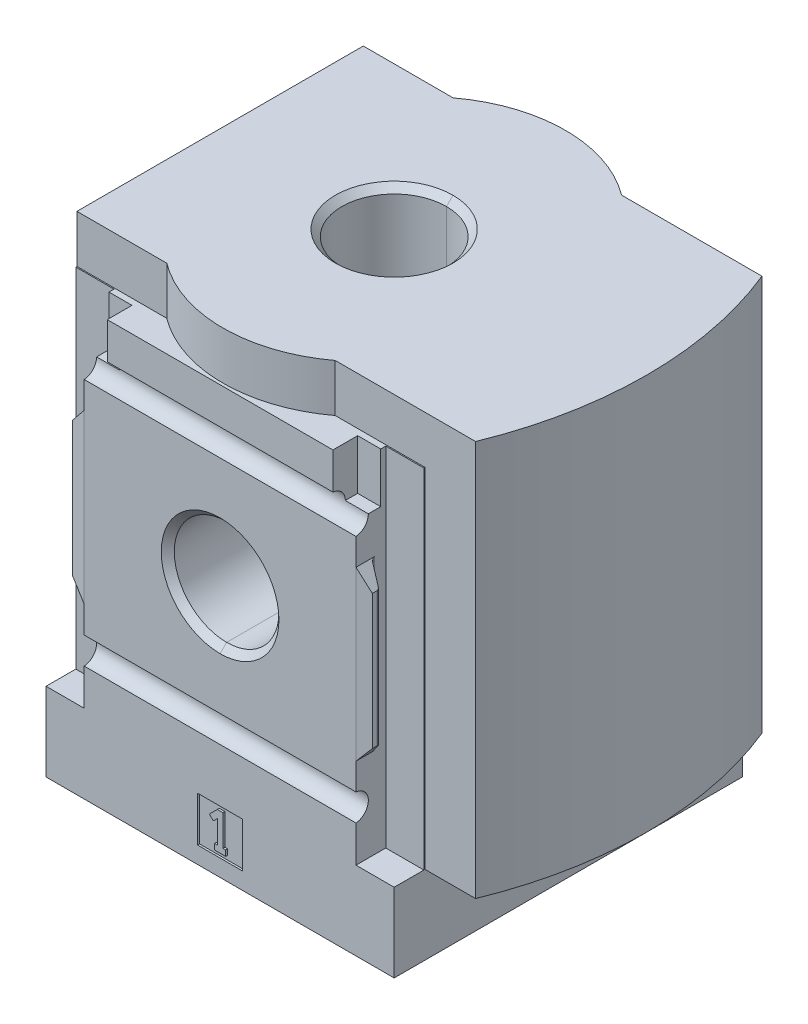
ISO-10303-21;
HEADER;
FILE_DESCRIPTION(('STEP AP214'),'2;1');
FILE_NAME('part.step','',(''),(''),'','','');
FILE_SCHEMA(('AUTOMOTIVE_DESIGN { 1 0 10303 214 1 1 1 1 }'));
ENDSEC;
DATA;
#1=APPLICATION_CONTEXT('core data for automotive mechanical design processes');
#2=APPLICATION_PROTOCOL_DEFINITION('international standard','automotive_design',2000,#1);
#3=PRODUCT_CONTEXT('',#1,'mechanical');
#4=PRODUCT('Part','Part','',(#3));
#5=PRODUCT_RELATED_PRODUCT_CATEGORY('part','',(#4));
#6=PRODUCT_DEFINITION_FORMATION('','',#4);
#7=PRODUCT_DEFINITION_CONTEXT('part definition',#1,'design');
#8=PRODUCT_DEFINITION('design','',#6,#7);
#9=PRODUCT_DEFINITION_SHAPE('','',#8);
#10=(LENGTH_UNIT() NAMED_UNIT(*) SI_UNIT(.MILLI.,.METRE.));
#11=(NAMED_UNIT(*) PLANE_ANGLE_UNIT() SI_UNIT($,.RADIAN.));
#12=(NAMED_UNIT(*) SI_UNIT($,.STERADIAN.) SOLID_ANGLE_UNIT());
#13=UNCERTAINTY_MEASURE_WITH_UNIT(LENGTH_MEASURE(1.E-05),#10,'distance_accuracy_value','');
#14=(GEOMETRIC_REPRESENTATION_CONTEXT(3) GLOBAL_UNCERTAINTY_ASSIGNED_CONTEXT((#13)) GLOBAL_UNIT_ASSIGNED_CONTEXT((#10,
#11,#12)) REPRESENTATION_CONTEXT('',''));
#15=CARTESIAN_POINT('',(0.,0.,0.));
#16=DIRECTION('',(0.,0.,1.));
#17=DIRECTION('',(1.,0.,0.));
#18=AXIS2_PLACEMENT_3D('',#15,#16,#17);
#19=CARTESIAN_POINT('',(0.,5.23875,10.045));
#20=DIRECTION('',(0.,0.,-1.));
#21=DIRECTION('',(-1.,0.,0.));
#22=AXIS2_PLACEMENT_3D('',#19,#20,#21);
#23=PLANE('',#22);
#24=CARTESIAN_POINT('',(0.,0.,10.045));
#25=DIRECTION('',(0.,0.,-1.));
#26=DIRECTION('',(-1.,0.,0.));
#27=AXIS2_PLACEMENT_3D('',#24,#25,#26);
#28=CIRCLE('',#27,10.4775);
#29=CARTESIAN_POINT('',(0.,-10.4775,10.045));
#30=VERTEX_POINT('',#29);
#31=CARTESIAN_POINT('',(0.,10.4775,10.045));
#32=VERTEX_POINT('',#31);
#33=EDGE_CURVE('E19',#30,#32,#28,.F.);
#34=ORIENTED_EDGE('',*,*,#33,.T.);
#35=CARTESIAN_POINT('',(0.,0.,10.045));
#36=DIRECTION('',(0.,0.,-1.));
#37=DIRECTION('',(-1.,0.,0.));
#38=AXIS2_PLACEMENT_3D('',#35,#36,#37);
#39=CIRCLE('',#38,10.4775);
#40=EDGE_CURVE('E674',#32,#30,#39,.F.);
#41=ORIENTED_EDGE('',*,*,#40,.T.);
#42=EDGE_LOOP('',(#34,#41));
#43=FACE_BOUND('',#42,.T.);
#44=ADVANCED_FACE('F16',(#43),#23,.F.);
#45=CARTESIAN_POINT('',(0.,5.23875,-10.045));
#46=DIRECTION('',(0.,0.,1.));
#47=DIRECTION('',(1.,0.,0.));
#48=AXIS2_PLACEMENT_3D('',#45,#46,#47);
#49=PLANE('',#48);
#50=CARTESIAN_POINT('',(0.,0.,-10.045));
#51=DIRECTION('',(0.,0.,1.));
#52=DIRECTION('',(1.,0.,0.));
#53=AXIS2_PLACEMENT_3D('',#50,#51,#52);
#54=CIRCLE('',#53,10.4775);
#55=CARTESIAN_POINT('',(0.,10.4775,-10.045));
#56=VERTEX_POINT('',#55);
#57=CARTESIAN_POINT('',(0.,-10.4775,-10.045));
#58=VERTEX_POINT('',#57);
#59=EDGE_CURVE('E689',#56,#58,#54,.F.);
#60=ORIENTED_EDGE('',*,*,#59,.T.);
#61=CARTESIAN_POINT('',(0.,0.,-10.045));
#62=DIRECTION('',(0.,0.,1.));
#63=DIRECTION('',(1.,0.,0.));
#64=AXIS2_PLACEMENT_3D('',#61,#62,#63);
#65=CIRCLE('',#64,10.4775);
#66=EDGE_CURVE('E702',#58,#56,#65,.F.);
#67=ORIENTED_EDGE('',*,*,#66,.T.);
#68=EDGE_LOOP('',(#60,#67));
#69=FACE_BOUND('',#68,.T.);
#70=ADVANCED_FACE('F3724',(#69),#49,.F.);
#71=CARTESIAN_POINT('',(0.,0.,10.045));
#72=DIRECTION('',(0.,0.,-1.));
#73=DIRECTION('',(-1.,0.,0.));
#74=AXIS2_PLACEMENT_3D('',#71,#72,#73);
#75=CONICAL_SURFACE('',#74,10.4775,0.785398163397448);
#76=ORIENTED_EDGE('',*,*,#33,.F.);
#77=DIRECTION('',(0.,0.707106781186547,0.707106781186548));
#78=VECTOR('',#77,1.);
#79=CARTESIAN_POINT('',(0.,-9.8965,10.626));
#80=LINE('',#79,#78);
#81=CARTESIAN_POINT('',(0.,-9.3155,11.207));
#82=VERTEX_POINT('',#81);
#83=EDGE_CURVE('E690',#30,#82,#80,.T.);
#84=ORIENTED_EDGE('',*,*,#83,.T.);
#85=CARTESIAN_POINT('',(0.,0.,11.207));
#86=DIRECTION('',(0.,0.,-1.));
#87=DIRECTION('',(-1.,0.,0.));
#88=AXIS2_PLACEMENT_3D('',#85,#86,#87);
#89=CIRCLE('',#88,9.3155);
#90=CARTESIAN_POINT('',(0.,9.3155,11.207));
#91=VERTEX_POINT('',#90);
#92=EDGE_CURVE('E684',#82,#91,#89,.F.);
#93=ORIENTED_EDGE('',*,*,#92,.T.);
#94=DIRECTION('',(0.,-0.707106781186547,0.707106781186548));
#95=VECTOR('',#94,1.);
#96=CARTESIAN_POINT('',(0.,9.8965,10.626));
#97=LINE('',#96,#95);
#98=EDGE_CURVE('E681',#91,#32,#97,.F.);
#99=ORIENTED_EDGE('',*,*,#98,.T.);
#100=EDGE_LOOP('',(#76,#84,#93,#99));
#101=FACE_BOUND('',#100,.T.);
#102=ADVANCED_FACE('F682',(#101),#75,.F.);
#103=CARTESIAN_POINT('',(0.,0.,10.045));
#104=DIRECTION('',(0.,0.,-1.));
#105=DIRECTION('',(-1.,0.,0.));
#106=AXIS2_PLACEMENT_3D('',#103,#104,#105);
#107=CONICAL_SURFACE('',#106,10.4775,0.785398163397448);
#108=CARTESIAN_POINT('',(0.,0.,11.207));
#109=DIRECTION('',(0.,0.,-1.));
#110=DIRECTION('',(-1.,0.,0.));
#111=AXIS2_PLACEMENT_3D('',#108,#109,#110);
#112=CIRCLE('',#111,9.3155);
#113=EDGE_CURVE('E1040',#91,#82,#112,.F.);
#114=ORIENTED_EDGE('',*,*,#113,.T.);
#115=ORIENTED_EDGE('',*,*,#83,.F.);
#116=ORIENTED_EDGE('',*,*,#40,.F.);
#117=ORIENTED_EDGE('',*,*,#98,.F.);
#118=EDGE_LOOP('',(#114,#115,#116,#117));
#119=FACE_BOUND('',#118,.T.);
#120=ADVANCED_FACE('F692',(#119),#107,.F.);
#121=CARTESIAN_POINT('',(0.,0.,-10.045));
#122=DIRECTION('',(0.,0.,1.));
#123=DIRECTION('',(1.,0.,0.));
#124=AXIS2_PLACEMENT_3D('',#121,#122,#123);
#125=CONICAL_SURFACE('',#124,10.4775,0.785398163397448);
#126=CARTESIAN_POINT('',(0.,0.,-11.207));
#127=DIRECTION('',(0.,0.,-1.));
#128=DIRECTION('',(-1.,0.,0.));
#129=AXIS2_PLACEMENT_3D('',#126,#127,#128);
#130=CIRCLE('',#129,9.3155);
#131=CARTESIAN_POINT('',(0.,9.3155,-11.207));
#132=VERTEX_POINT('',#131);
#133=CARTESIAN_POINT('',(0.,-9.3155,-11.207));
#134=VERTEX_POINT('',#133);
#135=EDGE_CURVE('E1078',#132,#134,#130,.T.);
#136=ORIENTED_EDGE('',*,*,#135,.T.);
#137=DIRECTION('',(0.,0.707106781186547,-0.707106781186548));
#138=VECTOR('',#137,1.);
#139=CARTESIAN_POINT('',(0.,-9.8965,-10.626));
#140=LINE('',#139,#138);
#141=EDGE_CURVE('E701',#134,#58,#140,.F.);
#142=ORIENTED_EDGE('',*,*,#141,.T.);
#143=ORIENTED_EDGE('',*,*,#59,.F.);
#144=DIRECTION('',(0.,-0.707106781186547,-0.707106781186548));
#145=VECTOR('',#144,1.);
#146=CARTESIAN_POINT('',(0.,9.8965,-10.626));
#147=LINE('',#146,#145);
#148=EDGE_CURVE('E705',#56,#132,#147,.T.);
#149=ORIENTED_EDGE('',*,*,#148,.T.);
#150=EDGE_LOOP('',(#136,#142,#143,#149));
#151=FACE_BOUND('',#150,.T.);
#152=ADVANCED_FACE('F3703',(#151),#125,.F.);
#153=CARTESIAN_POINT('',(0.,0.,-10.045));
#154=DIRECTION('',(0.,0.,1.));
#155=DIRECTION('',(1.,0.,0.));
#156=AXIS2_PLACEMENT_3D('',#153,#154,#155);
#157=CONICAL_SURFACE('',#156,10.4775,0.785398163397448);
#158=ORIENTED_EDGE('',*,*,#66,.F.);
#159=ORIENTED_EDGE('',*,*,#141,.F.);
#160=CARTESIAN_POINT('',(0.,0.,-11.207));
#161=DIRECTION('',(0.,0.,-1.));
#162=DIRECTION('',(-1.,0.,0.));
#163=AXIS2_PLACEMENT_3D('',#160,#161,#162);
#164=CIRCLE('',#163,9.3155);
#165=EDGE_CURVE('E1070',#134,#132,#164,.T.);
#166=ORIENTED_EDGE('',*,*,#165,.T.);
#167=ORIENTED_EDGE('',*,*,#148,.F.);
#168=EDGE_LOOP('',(#158,#159,#166,#167));
#169=FACE_BOUND('',#168,.T.);
#170=ADVANCED_FACE('F3695',(#169),#157,.F.);
#171=CARTESIAN_POINT('',(26.2,31.,-29.7317661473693));
#172=DIRECTION('',(0.,1.,0.));
#173=DIRECTION('',(0.,0.,1.));
#174=AXIS2_PLACEMENT_3D('',#171,#172,#173);
#175=CYLINDRICAL_SURFACE('',#174,0.499999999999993);
#176=CARTESIAN_POINT('',(26.2,12.5664928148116,-29.7317661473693));
#177=DIRECTION('',(-0.766044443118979,-0.642787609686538,0.));
#178=DIRECTION('',(-0.642787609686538,0.766044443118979,0.));
#179=AXIS2_PLACEMENT_3D('',#176,#177,#178);
#180=ELLIPSE('',#179,0.777861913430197,0.499999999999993);
#181=CARTESIAN_POINT('',(26.7,11.9706160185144,-29.7317661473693));
#182=VERTEX_POINT('',#181);
#183=CARTESIAN_POINT('',(26.4191855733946,12.3052776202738,-29.2823691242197));
#184=VERTEX_POINT('',#183);
#185=EDGE_CURVE('E710',#182,#184,#180,.T.);
#186=ORIENTED_EDGE('',*,*,#185,.T.);
#187=DIRECTION('',(0.,1.,0.));
#188=VECTOR('',#187,1.);
#189=CARTESIAN_POINT('',(26.4191855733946,31.,-29.2823691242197));
#190=LINE('',#189,#188);
#191=CARTESIAN_POINT('',(26.4191855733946,-12.3052776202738,-29.2823691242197));
#192=VERTEX_POINT('',#191);
#193=EDGE_CURVE('E1113',#184,#192,#190,.F.);
#194=ORIENTED_EDGE('',*,*,#193,.T.);
#195=CARTESIAN_POINT('',(26.2,-12.5664928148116,-29.7317661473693));
#196=DIRECTION('',(-0.766044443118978,0.642787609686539,0.));
#197=DIRECTION('',(0.642787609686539,0.766044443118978,0.));
#198=AXIS2_PLACEMENT_3D('',#195,#196,#197);
#199=ELLIPSE('',#198,0.777861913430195,0.499999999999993);
#200=CARTESIAN_POINT('',(26.7,-11.9706160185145,-29.7317661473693));
#201=VERTEX_POINT('',#200);
#202=EDGE_CURVE('E706',#192,#201,#199,.T.);
#203=ORIENTED_EDGE('',*,*,#202,.T.);
#204=DIRECTION('',(0.,1.,0.));
#205=VECTOR('',#204,1.);
#206=CARTESIAN_POINT('',(26.7,11.9706160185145,-29.7317661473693));
#207=LINE('',#206,#205);
#208=EDGE_CURVE('E1048',#201,#182,#207,.T.);
#209=ORIENTED_EDGE('',*,*,#208,.T.);
#210=EDGE_LOOP('',(#186,#194,#203,#209));
#211=FACE_BOUND('',#210,.T.);
#212=ADVANCED_FACE('F3687',(#211),#175,.T.);
#213=CARTESIAN_POINT('',(0.,0.,-31.));
#214=DIRECTION('',(0.,0.,1.));
#215=DIRECTION('',(1.,0.,0.));
#216=AXIS2_PLACEMENT_3D('',#213,#214,#215);
#217=PLANE('',#216);
#218=CARTESIAN_POINT('',(0.587127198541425,-40.15,-31.));
#219=DIRECTION('',(0.,0.,1.));
#220=DIRECTION('',(1.,0.,0.));
#221=AXIS2_PLACEMENT_3D('',#218,#219,#220);
#222=CIRCLE('',#221,0.100000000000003);
#223=CARTESIAN_POINT('',(0.587127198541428,-40.25,-31.));
#224=VERTEX_POINT('',#223);
#225=CARTESIAN_POINT('',(0.669042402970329,-40.0926423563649,-31.));
#226=VERTEX_POINT('',#225);
#227=EDGE_CURVE('E738',#224,#226,#222,.T.);
#228=ORIENTED_EDGE('',*,*,#227,.T.);
#229=DIRECTION('',(-0.573576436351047,0.819152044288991,0.));
#230=VECTOR('',#229,1.);
#231=CARTESIAN_POINT('',(0.669042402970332,-40.0926423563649,-31.));
#232=LINE('',#231,#230);
#233=CARTESIAN_POINT('',(-1.63953694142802,-36.7956493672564,-31.));
#234=VERTEX_POINT('',#233);
#235=EDGE_CURVE('E748',#226,#234,#232,.T.);
#236=ORIENTED_EDGE('',*,*,#235,.T.);
#237=CARTESIAN_POINT('',(-0.574639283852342,-36.05,-31.));
#238=DIRECTION('',(0.,0.,1.));
#239=DIRECTION('',(1.,0.,0.));
#240=AXIS2_PLACEMENT_3D('',#237,#238,#239);
#241=CIRCLE('',#240,1.3);
#242=CARTESIAN_POINT('',(-0.57463928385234,-34.75,-31.));
#243=VERTEX_POINT('',#242);
#244=EDGE_CURVE('E743',#243,#234,#241,.T.);
#245=ORIENTED_EDGE('',*,*,#244,.F.);
#246=DIRECTION('',(1.,0.,0.));
#247=VECTOR('',#246,1.);
#248=CARTESIAN_POINT('',(-0.574639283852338,-34.75,-31.));
#249=LINE('',#248,#247);
#250=CARTESIAN_POINT('',(0.500000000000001,-34.75,-31.));
#251=VERTEX_POINT('',#250);
#252=EDGE_CURVE('E754',#243,#251,#249,.T.);
#253=ORIENTED_EDGE('',*,*,#252,.T.);
#254=CARTESIAN_POINT('',(0.500000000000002,-36.25,-31.));
#255=DIRECTION('',(0.,0.,1.));
#256=DIRECTION('',(1.,0.,0.));
#257=AXIS2_PLACEMENT_3D('',#254,#255,#256);
#258=CIRCLE('',#257,1.5);
#259=CARTESIAN_POINT('',(2.,-36.25,-31.));
#260=VERTEX_POINT('',#259);
#261=EDGE_CURVE('E749',#260,#251,#258,.T.);
#262=ORIENTED_EDGE('',*,*,#261,.F.);
#263=DIRECTION('',(-0.98058067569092,-0.196116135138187,0.));
#264=VECTOR('',#263,1.);
#265=CARTESIAN_POINT('',(2.,-36.25,-31.));
#266=LINE('',#265,#264);
#267=CARTESIAN_POINT('',(1.,-36.45,-31.));
#268=VERTEX_POINT('',#267);
#269=EDGE_CURVE('E1090',#260,#268,#266,.T.);
#270=ORIENTED_EDGE('',*,*,#269,.T.);
#271=CARTESIAN_POINT('',(0.3,-36.45,-31.));
#272=DIRECTION('',(0.,0.,1.));
#273=DIRECTION('',(1.,0.,0.));
#274=AXIS2_PLACEMENT_3D('',#271,#272,#273);
#275=CIRCLE('',#274,0.700000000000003);
#276=CARTESIAN_POINT('',(0.3,-35.75,-31.));
#277=VERTEX_POINT('',#276);
#278=EDGE_CURVE('E755',#268,#277,#275,.T.);
#279=ORIENTED_EDGE('',*,*,#278,.T.);
#280=DIRECTION('',(1.,0.,0.));
#281=VECTOR('',#280,1.);
#282=CARTESIAN_POINT('',(0.3,-35.75,-31.));
#283=LINE('',#282,#281);
#284=CARTESIAN_POINT('',(-0.190442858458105,-35.75,-31.));
#285=VERTEX_POINT('',#284);
#286=EDGE_CURVE('E1094',#277,#285,#283,.F.);
#287=ORIENTED_EDGE('',*,*,#286,.T.);
#288=CARTESIAN_POINT('',(-0.190442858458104,-36.25,-31.));
#289=DIRECTION('',(0.,0.,1.));
#290=DIRECTION('',(1.,0.,0.));
#291=AXIS2_PLACEMENT_3D('',#288,#289,#290);
#292=CIRCLE('',#291,0.500000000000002);
#293=CARTESIAN_POINT('',(-0.600018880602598,-36.5367882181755,-31.));
#294=VERTEX_POINT('',#293);
#295=EDGE_CURVE('E760',#285,#294,#292,.T.);
#296=ORIENTED_EDGE('',*,*,#295,.T.);
#297=DIRECTION('',(0.573576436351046,-0.819152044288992,0.));
#298=VECTOR('',#297,1.);
#299=CARTESIAN_POINT('',(-0.600018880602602,-36.5367882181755,-31.));
#300=LINE('',#299,#298);
#301=CARTESIAN_POINT('',(2.,-40.25,-31.));
#302=VERTEX_POINT('',#301);
#303=EDGE_CURVE('E1105',#294,#302,#300,.T.);
#304=ORIENTED_EDGE('',*,*,#303,.T.);
#305=DIRECTION('',(0.,1.,0.));
#306=VECTOR('',#305,1.);
#307=CARTESIAN_POINT('',(2.,-40.25,-31.));
#308=LINE('',#307,#306);
#309=CARTESIAN_POINT('',(2.,-41.25,-31.));
#310=VERTEX_POINT('',#309);
#311=EDGE_CURVE('E1099',#302,#310,#308,.F.);
#312=ORIENTED_EDGE('',*,*,#311,.T.);
#313=DIRECTION('',(1.,0.,0.));
#314=VECTOR('',#313,1.);
#315=CARTESIAN_POINT('',(2.,-41.25,-31.));
#316=LINE('',#315,#314);
#317=CARTESIAN_POINT('',(-2.,-41.25,-31.));
#318=VERTEX_POINT('',#317);
#319=EDGE_CURVE('E1019',#310,#318,#316,.F.);
#320=ORIENTED_EDGE('',*,*,#319,.T.);
#321=DIRECTION('',(0.,1.,0.));
#322=VECTOR('',#321,1.);
#323=CARTESIAN_POINT('',(-2.,0.,-31.));
#324=LINE('',#323,#322);
#325=CARTESIAN_POINT('',(-2.,-40.25,-31.));
#326=VERTEX_POINT('',#325);
#327=EDGE_CURVE('E713',#326,#318,#324,.F.);
#328=ORIENTED_EDGE('',*,*,#327,.F.);
#329=DIRECTION('',(1.,0.,0.));
#330=VECTOR('',#329,1.);
#331=CARTESIAN_POINT('',(-2.,-40.25,-31.));
#332=LINE('',#331,#330);
#333=EDGE_CURVE('E1110',#326,#224,#332,.T.);
#334=ORIENTED_EDGE('',*,*,#333,.T.);
#335=EDGE_LOOP('',(#228,#236,#245,#253,#262,#270,#279,#287,#296,#304,#312,#320,#328,#334));
#336=FACE_BOUND('',#335,.T.);
#337=ADVANCED_FACE('F3680',(#336),#217,.F.);
#338=CARTESIAN_POINT('',(0.,-25.,5.23875));
#339=DIRECTION('',(0.,1.,0.));
#340=DIRECTION('',(0.,0.,1.));
#341=AXIS2_PLACEMENT_3D('',#338,#339,#340);
#342=PLANE('',#341);
#343=CARTESIAN_POINT('',(0.,-25.,0.));
#344=DIRECTION('',(0.,1.,0.));
#345=DIRECTION('',(0.,0.,1.));
#346=AXIS2_PLACEMENT_3D('',#343,#344,#345);
#347=CIRCLE('',#346,10.4775);
#348=CARTESIAN_POINT('',(0.,-25.,-10.4775));
#349=VERTEX_POINT('',#348);
#350=CARTESIAN_POINT('',(0.,-25.,10.4775));
#351=VERTEX_POINT('',#350);
#352=EDGE_CURVE('E770',#349,#351,#347,.F.);
#353=ORIENTED_EDGE('',*,*,#352,.T.);
#354=CARTESIAN_POINT('',(0.,-25.,0.));
#355=DIRECTION('',(0.,1.,0.));
#356=DIRECTION('',(0.,0.,1.));
#357=AXIS2_PLACEMENT_3D('',#354,#355,#356);
#358=CIRCLE('',#357,10.4775);
#359=EDGE_CURVE('E765',#351,#349,#358,.F.);
#360=ORIENTED_EDGE('',*,*,#359,.T.);
#361=EDGE_LOOP('',(#353,#360));
#362=FACE_BOUND('',#361,.T.);
#363=ADVANCED_FACE('F3673',(#362),#342,.F.);
#364=CARTESIAN_POINT('',(26.2,31.,29.7317661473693));
#365=DIRECTION('',(0.,1.,0.));
#366=DIRECTION('',(0.,0.,1.));
#367=AXIS2_PLACEMENT_3D('',#364,#365,#366);
#368=CYLINDRICAL_SURFACE('',#367,0.500000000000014);
#369=CARTESIAN_POINT('',(26.2,12.5664928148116,29.7317661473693));
#370=DIRECTION('',(-0.766044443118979,-0.642787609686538,0.));
#371=DIRECTION('',(-0.642787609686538,0.766044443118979,0.));
#372=AXIS2_PLACEMENT_3D('',#369,#370,#371);
#373=ELLIPSE('',#372,0.777861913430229,0.500000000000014);
#374=CARTESIAN_POINT('',(26.4191855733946,12.3052776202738,29.2823691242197));
#375=VERTEX_POINT('',#374);
#376=CARTESIAN_POINT('',(26.7,11.9706160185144,29.7317661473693));
#377=VERTEX_POINT('',#376);
#378=EDGE_CURVE('E717',#375,#377,#373,.T.);
#379=ORIENTED_EDGE('',*,*,#378,.T.);
#380=DIRECTION('',(0.,1.,0.));
#381=VECTOR('',#380,1.);
#382=CARTESIAN_POINT('',(26.7,11.9706160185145,29.7317661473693));
#383=LINE('',#382,#381);
#384=CARTESIAN_POINT('',(26.7,-11.9706160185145,29.7317661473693));
#385=VERTEX_POINT('',#384);
#386=EDGE_CURVE('E1029',#377,#385,#383,.F.);
#387=ORIENTED_EDGE('',*,*,#386,.T.);
#388=CARTESIAN_POINT('',(26.2,-12.5664928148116,29.7317661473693));
#389=DIRECTION('',(-0.766044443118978,0.642787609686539,0.));
#390=DIRECTION('',(0.642787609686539,0.766044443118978,0.));
#391=AXIS2_PLACEMENT_3D('',#388,#389,#390);
#392=ELLIPSE('',#391,0.777861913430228,0.500000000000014);
#393=CARTESIAN_POINT('',(26.4191855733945,-12.3052776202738,29.2823691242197));
#394=VERTEX_POINT('',#393);
#395=EDGE_CURVE('E714',#385,#394,#392,.T.);
#396=ORIENTED_EDGE('',*,*,#395,.T.);
#397=DIRECTION('',(0.,1.,0.));
#398=VECTOR('',#397,1.);
#399=CARTESIAN_POINT('',(26.4191855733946,31.,29.2823691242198));
#400=LINE('',#399,#398);
#401=EDGE_CURVE('E1264',#394,#375,#400,.T.);
#402=ORIENTED_EDGE('',*,*,#401,.T.);
#403=EDGE_LOOP('',(#379,#387,#396,#402));
#404=FACE_BOUND('',#403,.T.);
#405=ADVANCED_FACE('F3664',(#404),#368,.T.);
#406=CARTESIAN_POINT('',(0.,0.,31.));
#407=DIRECTION('',(0.,0.,1.));
#408=DIRECTION('',(1.,0.,0.));
#409=AXIS2_PLACEMENT_3D('',#406,#407,#408);
#410=PLANE('',#409);
#411=DIRECTION('',(1.,0.,0.));
#412=VECTOR('',#411,1.);
#413=CARTESIAN_POINT('',(0.5,-40.25,31.));
#414=LINE('',#413,#412);
#415=CARTESIAN_POINT('',(1.,-40.25,31.));
#416=VERTEX_POINT('',#415);
#417=CARTESIAN_POINT('',(0.5,-40.25,31.));
#418=VERTEX_POINT('',#417);
#419=EDGE_CURVE('E1298',#416,#418,#414,.F.);
#420=ORIENTED_EDGE('',*,*,#419,.T.);
#421=DIRECTION('',(0.,1.,0.));
#422=VECTOR('',#421,1.);
#423=CARTESIAN_POINT('',(0.5,-34.75,31.));
#424=LINE('',#423,#422);
#425=CARTESIAN_POINT('',(0.5,-34.75,31.));
#426=VERTEX_POINT('',#425);
#427=EDGE_CURVE('E1291',#418,#426,#424,.T.);
#428=ORIENTED_EDGE('',*,*,#427,.T.);
#429=DIRECTION('',(1.,0.,0.));
#430=VECTOR('',#429,1.);
#431=CARTESIAN_POINT('',(-0.5,-34.75,31.));
#432=LINE('',#431,#430);
#433=CARTESIAN_POINT('',(-0.5,-34.75,31.));
#434=VERTEX_POINT('',#433);
#435=EDGE_CURVE('E1279',#426,#434,#432,.F.);
#436=ORIENTED_EDGE('',*,*,#435,.T.);
#437=DIRECTION('',(0.707106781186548,0.707106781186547,0.));
#438=VECTOR('',#437,1.);
#439=CARTESIAN_POINT('',(-1.9142135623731,-36.1642135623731,31.));
#440=LINE('',#439,#438);
#441=CARTESIAN_POINT('',(-1.91421356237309,-36.1642135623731,31.));
#442=VERTEX_POINT('',#441);
#443=EDGE_CURVE('E1358',#434,#442,#440,.F.);
#444=ORIENTED_EDGE('',*,*,#443,.T.);
#445=DIRECTION('',(-0.707106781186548,0.707106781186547,0.));
#446=VECTOR('',#445,1.);
#447=CARTESIAN_POINT('',(-1.20710678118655,-36.8713203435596,31.));
#448=LINE('',#447,#446);
#449=CARTESIAN_POINT('',(-1.20710678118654,-36.8713203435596,31.));
#450=VERTEX_POINT('',#449);
#451=EDGE_CURVE('E1347',#442,#450,#448,.F.);
#452=ORIENTED_EDGE('',*,*,#451,.T.);
#453=DIRECTION('',(-0.707106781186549,-0.707106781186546,0.));
#454=VECTOR('',#453,1.);
#455=CARTESIAN_POINT('',(-0.5,-36.1642135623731,31.));
#456=LINE('',#455,#454);
#457=CARTESIAN_POINT('',(-0.5,-36.1642135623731,31.));
#458=VERTEX_POINT('',#457);
#459=EDGE_CURVE('E1340',#450,#458,#456,.F.);
#460=ORIENTED_EDGE('',*,*,#459,.T.);
#461=DIRECTION('',(0.,1.,0.));
#462=VECTOR('',#461,1.);
#463=CARTESIAN_POINT('',(-0.5,-40.25,31.));
#464=LINE('',#463,#462);
#465=CARTESIAN_POINT('',(-0.5,-40.25,31.));
#466=VERTEX_POINT('',#465);
#467=EDGE_CURVE('E1333',#458,#466,#464,.F.);
#468=ORIENTED_EDGE('',*,*,#467,.T.);
#469=DIRECTION('',(1.,0.,0.));
#470=VECTOR('',#469,1.);
#471=CARTESIAN_POINT('',(-1.,-40.25,31.));
#472=LINE('',#471,#470);
#473=CARTESIAN_POINT('',(-1.,-40.25,31.));
#474=VERTEX_POINT('',#473);
#475=EDGE_CURVE('E1326',#466,#474,#472,.F.);
#476=ORIENTED_EDGE('',*,*,#475,.T.);
#477=DIRECTION('',(0.,1.,0.));
#478=VECTOR('',#477,1.);
#479=CARTESIAN_POINT('',(-1.,-41.25,31.));
#480=LINE('',#479,#478);
#481=CARTESIAN_POINT('',(-1.,-41.25,31.));
#482=VERTEX_POINT('',#481);
#483=EDGE_CURVE('E1319',#474,#482,#480,.F.);
#484=ORIENTED_EDGE('',*,*,#483,.T.);
#485=DIRECTION('',(1.,0.,0.));
#486=VECTOR('',#485,1.);
#487=CARTESIAN_POINT('',(1.,-41.25,31.));
#488=LINE('',#487,#486);
#489=CARTESIAN_POINT('',(1.,-41.25,31.));
#490=VERTEX_POINT('',#489);
#491=EDGE_CURVE('E1312',#482,#490,#488,.T.);
#492=ORIENTED_EDGE('',*,*,#491,.T.);
#493=DIRECTION('',(0.,1.,0.));
#494=VECTOR('',#493,1.);
#495=CARTESIAN_POINT('',(1.,-40.25,31.));
#496=LINE('',#495,#494);
#497=EDGE_CURVE('E1305',#490,#416,#496,.T.);
#498=ORIENTED_EDGE('',*,*,#497,.T.);
#499=EDGE_LOOP('',(#420,#428,#436,#444,#452,#460,#468,#476,#484,#492,#498));
#500=FACE_BOUND('',#499,.T.);
#501=ADVANCED_FACE('F3655',(#500),#410,.T.);
#502=CARTESIAN_POINT('',(-26.2,31.,29.7317661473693));
#503=DIRECTION('',(0.,1.,0.));
#504=DIRECTION('',(0.,0.,1.));
#505=AXIS2_PLACEMENT_3D('',#502,#503,#504);
#506=CYLINDRICAL_SURFACE('',#505,0.500000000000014);
#507=CARTESIAN_POINT('',(-26.2,-12.5664928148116,29.7317661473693));
#508=DIRECTION('',(0.766044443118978,0.642787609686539,0.));
#509=DIRECTION('',(-0.642787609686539,0.766044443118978,0.));
#510=AXIS2_PLACEMENT_3D('',#507,#508,#509);
#511=ELLIPSE('',#510,0.777861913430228,0.500000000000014);
#512=CARTESIAN_POINT('',(-26.4191855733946,-12.3052776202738,29.2823691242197));
#513=VERTEX_POINT('',#512);
#514=CARTESIAN_POINT('',(-26.7,-11.9706160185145,29.7317661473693));
#515=VERTEX_POINT('',#514);
#516=EDGE_CURVE('E724',#513,#515,#511,.T.);
#517=ORIENTED_EDGE('',*,*,#516,.T.);
#518=DIRECTION('',(0.,1.,0.));
#519=VECTOR('',#518,1.);
#520=CARTESIAN_POINT('',(-26.7,-11.9706160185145,29.7317661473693));
#521=LINE('',#520,#519);
#522=CARTESIAN_POINT('',(-26.7,11.9706160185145,29.7317661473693));
#523=VERTEX_POINT('',#522);
#524=EDGE_CURVE('E1024',#515,#523,#521,.T.);
#525=ORIENTED_EDGE('',*,*,#524,.T.);
#526=CARTESIAN_POINT('',(-26.2,12.5664928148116,29.7317661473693));
#527=DIRECTION('',(0.76604444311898,-0.642787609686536,0.));
#528=DIRECTION('',(0.642787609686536,0.76604444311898,0.));
#529=AXIS2_PLACEMENT_3D('',#526,#527,#528);
#530=ELLIPSE('',#529,0.777861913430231,0.500000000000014);
#531=CARTESIAN_POINT('',(-26.4191855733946,12.3052776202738,29.2823691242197));
#532=VERTEX_POINT('',#531);
#533=EDGE_CURVE('E721',#523,#532,#530,.T.);
#534=ORIENTED_EDGE('',*,*,#533,.T.);
#535=DIRECTION('',(0.,1.,0.));
#536=VECTOR('',#535,1.);
#537=CARTESIAN_POINT('',(-26.4191855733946,31.,29.2823691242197));
#538=LINE('',#537,#536);
#539=EDGE_CURVE('E1362',#532,#513,#538,.F.);
#540=ORIENTED_EDGE('',*,*,#539,.T.);
#541=EDGE_LOOP('',(#517,#525,#534,#540));
#542=FACE_BOUND('',#541,.T.);
#543=ADVANCED_FACE('F3646',(#542),#506,.T.);
#544=CARTESIAN_POINT('',(-26.7,-11.9706160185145,36.3));
#545=DIRECTION('',(1.,0.,0.));
#546=DIRECTION('',(0.,0.,-1.));
#547=AXIS2_PLACEMENT_3D('',#544,#545,#546);
#548=PLANE('',#547);
#549=DIRECTION('',(0.,0.,-1.));
#550=VECTOR('',#549,1.);
#551=CARTESIAN_POINT('',(-26.7,11.9706160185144,36.3));
#552=LINE('',#551,#550);
#553=CARTESIAN_POINT('',(-26.7,11.9706160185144,30.6));
#554=VERTEX_POINT('',#553);
#555=EDGE_CURVE('E1028',#523,#554,#552,.F.);
#556=ORIENTED_EDGE('',*,*,#555,.F.);
#557=ORIENTED_EDGE('',*,*,#524,.F.);
#558=DIRECTION('',(0.,0.,-1.));
#559=VECTOR('',#558,1.);
#560=CARTESIAN_POINT('',(-26.7,-11.9706160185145,36.3));
#561=LINE('',#560,#559);
#562=CARTESIAN_POINT('',(-26.7,-11.9706160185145,30.6));
#563=VERTEX_POINT('',#562);
#564=EDGE_CURVE('E728',#563,#515,#561,.T.);
#565=ORIENTED_EDGE('',*,*,#564,.F.);
#566=DIRECTION('',(0.,1.,0.));
#567=VECTOR('',#566,1.);
#568=CARTESIAN_POINT('',(-26.7,31.,30.6));
#569=LINE('',#568,#567);
#570=EDGE_CURVE('E1285',#563,#554,#569,.T.);
#571=ORIENTED_EDGE('',*,*,#570,.T.);
#572=EDGE_LOOP('',(#556,#557,#565,#571));
#573=FACE_BOUND('',#572,.T.);
#574=ADVANCED_FACE('F3637',(#573),#548,.F.);
#575=CARTESIAN_POINT('',(26.7,11.9706160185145,36.3));
#576=DIRECTION('',(-1.,0.,0.));
#577=DIRECTION('',(0.,0.,1.));
#578=AXIS2_PLACEMENT_3D('',#575,#576,#577);
#579=PLANE('',#578);
#580=DIRECTION('',(0.,0.,1.));
#581=VECTOR('',#580,1.);
#582=CARTESIAN_POINT('',(26.7,11.9706160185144,36.3));
#583=LINE('',#582,#581);
#584=CARTESIAN_POINT('',(26.7,11.9706160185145,30.6));
#585=VERTEX_POINT('',#584);
#586=EDGE_CURVE('E1033',#585,#377,#583,.F.);
#587=ORIENTED_EDGE('',*,*,#586,.F.);
#588=DIRECTION('',(0.,1.,0.));
#589=VECTOR('',#588,1.);
#590=CARTESIAN_POINT('',(26.7,31.,30.6));
#591=LINE('',#590,#589);
#592=CARTESIAN_POINT('',(26.7,-11.9706160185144,30.6));
#593=VERTEX_POINT('',#592);
#594=EDGE_CURVE('E1151',#585,#593,#591,.F.);
#595=ORIENTED_EDGE('',*,*,#594,.T.);
#596=DIRECTION('',(0.,0.,1.));
#597=VECTOR('',#596,1.);
#598=CARTESIAN_POINT('',(26.7,-11.9706160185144,36.3));
#599=LINE('',#598,#597);
#600=EDGE_CURVE('E1118',#385,#593,#599,.T.);
#601=ORIENTED_EDGE('',*,*,#600,.F.);
#602=ORIENTED_EDGE('',*,*,#386,.F.);
#603=EDGE_LOOP('',(#587,#595,#601,#602));
#604=FACE_BOUND('',#603,.T.);
#605=ADVANCED_FACE('F3628',(#604),#579,.F.);
#606=CARTESIAN_POINT('',(0.,0.,20.5225));
#607=DIRECTION('',(0.,0.,-1.));
#608=DIRECTION('',(-1.,0.,0.));
#609=AXIS2_PLACEMENT_3D('',#606,#607,#608);
#610=CYLINDRICAL_SURFACE('',#609,9.3155);
#611=ORIENTED_EDGE('',*,*,#92,.F.);
#612=DIRECTION('',(0.,0.,-1.));
#613=VECTOR('',#612,1.);
#614=CARTESIAN_POINT('',(0.,-9.3155,20.5225));
#615=LINE('',#614,#613);
#616=CARTESIAN_POINT('',(0.,-9.3155,29.838));
#617=VERTEX_POINT('',#616);
#618=EDGE_CURVE('E1043',#82,#617,#615,.F.);
#619=ORIENTED_EDGE('',*,*,#618,.T.);
#620=CARTESIAN_POINT('',(0.,0.,29.838));
#621=DIRECTION('',(0.,0.,1.));
#622=DIRECTION('',(0.,1.,0.));
#623=AXIS2_PLACEMENT_3D('',#620,#621,#622);
#624=CIRCLE('',#623,9.3155);
#625=CARTESIAN_POINT('',(0.,9.3155,29.838));
#626=VERTEX_POINT('',#625);
#627=EDGE_CURVE('E1146',#617,#626,#624,.T.);
#628=ORIENTED_EDGE('',*,*,#627,.T.);
#629=DIRECTION('',(0.,0.,-1.));
#630=VECTOR('',#629,1.);
#631=CARTESIAN_POINT('',(0.,9.3155,20.5225));
#632=LINE('',#631,#630);
#633=EDGE_CURVE('E734',#626,#91,#632,.T.);
#634=ORIENTED_EDGE('',*,*,#633,.T.);
#635=EDGE_LOOP('',(#611,#619,#628,#634));
#636=FACE_BOUND('',#635,.T.);
#637=ADVANCED_FACE('F3619',(#636),#610,.F.);
#638=CARTESIAN_POINT('',(0.,0.,20.5225));
#639=DIRECTION('',(0.,0.,-1.));
#640=DIRECTION('',(-1.,0.,0.));
#641=AXIS2_PLACEMENT_3D('',#638,#639,#640);
#642=CYLINDRICAL_SURFACE('',#641,9.3155);
#643=CARTESIAN_POINT('',(0.,0.,29.838));
#644=DIRECTION('',(0.,0.,1.));
#645=DIRECTION('',(0.,1.,0.));
#646=AXIS2_PLACEMENT_3D('',#643,#644,#645);
#647=CIRCLE('',#646,9.3155);
#648=EDGE_CURVE('E1141',#626,#617,#647,.T.);
#649=ORIENTED_EDGE('',*,*,#648,.T.);
#650=ORIENTED_EDGE('',*,*,#618,.F.);
#651=ORIENTED_EDGE('',*,*,#113,.F.);
#652=ORIENTED_EDGE('',*,*,#633,.F.);
#653=EDGE_LOOP('',(#649,#650,#651,#652));
#654=FACE_BOUND('',#653,.T.);
#655=ADVANCED_FACE('F3610',(#654),#642,.F.);
#656=CARTESIAN_POINT('',(0.,19.5,5.23875));
#657=DIRECTION('',(0.,-1.,0.));
#658=DIRECTION('',(0.,0.,-1.));
#659=AXIS2_PLACEMENT_3D('',#656,#657,#658);
#660=PLANE('',#659);
#661=CARTESIAN_POINT('',(0.,19.5,0.));
#662=DIRECTION('',(0.,-1.,0.));
#663=DIRECTION('',(0.,0.,-1.));
#664=AXIS2_PLACEMENT_3D('',#661,#662,#663);
#665=CIRCLE('',#664,10.4775);
#666=CARTESIAN_POINT('',(0.,19.5,10.4775));
#667=VERTEX_POINT('',#666);
#668=CARTESIAN_POINT('',(0.,19.5,-10.4775));
#669=VERTEX_POINT('',#668);
#670=EDGE_CURVE('E781',#667,#669,#665,.F.);
#671=ORIENTED_EDGE('',*,*,#670,.T.);
#672=CARTESIAN_POINT('',(0.,19.5,0.));
#673=DIRECTION('',(0.,-1.,0.));
#674=DIRECTION('',(0.,0.,-1.));
#675=AXIS2_PLACEMENT_3D('',#672,#673,#674);
#676=CIRCLE('',#675,10.4775);
#677=EDGE_CURVE('E777',#669,#667,#676,.F.);
#678=ORIENTED_EDGE('',*,*,#677,.T.);
#679=EDGE_LOOP('',(#671,#678));
#680=FACE_BOUND('',#679,.T.);
#681=ADVANCED_FACE('F3602',(#680),#660,.F.);
#682=CARTESIAN_POINT('',(-26.2,31.,-29.7317661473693));
#683=DIRECTION('',(0.,1.,0.));
#684=DIRECTION('',(0.,0.,1.));
#685=AXIS2_PLACEMENT_3D('',#682,#683,#684);
#686=CYLINDRICAL_SURFACE('',#685,0.500000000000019);
#687=CARTESIAN_POINT('',(-26.2,-12.5664928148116,-29.7317661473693));
#688=DIRECTION('',(0.766044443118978,0.642787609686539,0.));
#689=DIRECTION('',(-0.642787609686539,0.766044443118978,0.));
#690=AXIS2_PLACEMENT_3D('',#687,#688,#689);
#691=ELLIPSE('',#690,0.777861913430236,0.500000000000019);
#692=CARTESIAN_POINT('',(-26.7,-11.9706160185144,-29.7317661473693));
#693=VERTEX_POINT('',#692);
#694=CARTESIAN_POINT('',(-26.4191855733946,-12.3052776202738,-29.2823691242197));
#695=VERTEX_POINT('',#694);
#696=EDGE_CURVE('E733',#693,#695,#691,.T.);
#697=ORIENTED_EDGE('',*,*,#696,.T.);
#698=DIRECTION('',(0.,1.,0.));
#699=VECTOR('',#698,1.);
#700=CARTESIAN_POINT('',(-26.4191855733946,31.,-29.2823691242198));
#701=LINE('',#700,#699);
#702=CARTESIAN_POINT('',(-26.4191855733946,12.3052776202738,-29.2823691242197));
#703=VERTEX_POINT('',#702);
#704=EDGE_CURVE('E1199',#695,#703,#701,.T.);
#705=ORIENTED_EDGE('',*,*,#704,.T.);
#706=CARTESIAN_POINT('',(-26.2,12.5664928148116,-29.7317661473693));
#707=DIRECTION('',(0.76604444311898,-0.642787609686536,0.));
#708=DIRECTION('',(0.642787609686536,0.76604444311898,0.));
#709=AXIS2_PLACEMENT_3D('',#706,#707,#708);
#710=ELLIPSE('',#709,0.777861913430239,0.500000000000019);
#711=CARTESIAN_POINT('',(-26.7,11.9706160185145,-29.7317661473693));
#712=VERTEX_POINT('',#711);
#713=EDGE_CURVE('E729',#703,#712,#710,.T.);
#714=ORIENTED_EDGE('',*,*,#713,.T.);
#715=DIRECTION('',(0.,1.,0.));
#716=VECTOR('',#715,1.);
#717=CARTESIAN_POINT('',(-26.7,-11.9706160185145,-29.7317661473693));
#718=LINE('',#717,#716);
#719=EDGE_CURVE('E1054',#712,#693,#718,.F.);
#720=ORIENTED_EDGE('',*,*,#719,.T.);
#721=EDGE_LOOP('',(#697,#705,#714,#720));
#722=FACE_BOUND('',#721,.T.);
#723=ADVANCED_FACE('F2556',(#722),#686,.T.);
#724=CARTESIAN_POINT('',(26.7,11.9706160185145,-25.7));
#725=DIRECTION('',(-1.,0.,0.));
#726=DIRECTION('',(0.,0.,1.));
#727=AXIS2_PLACEMENT_3D('',#724,#725,#726);
#728=PLANE('',#727);
#729=DIRECTION('',(0.,0.,1.));
#730=VECTOR('',#729,1.);
#731=CARTESIAN_POINT('',(26.7,-11.9706160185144,-25.7));
#732=LINE('',#731,#730);
#733=CARTESIAN_POINT('',(26.7,-11.9706160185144,-30.6));
#734=VERTEX_POINT('',#733);
#735=EDGE_CURVE('E1053',#734,#201,#732,.T.);
#736=ORIENTED_EDGE('',*,*,#735,.F.);
#737=DIRECTION('',(0.,1.,0.));
#738=VECTOR('',#737,1.);
#739=CARTESIAN_POINT('',(26.7,31.,-30.6));
#740=LINE('',#739,#738);
#741=CARTESIAN_POINT('',(26.7,11.9706160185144,-30.6));
#742=VERTEX_POINT('',#741);
#743=EDGE_CURVE('E1195',#734,#742,#740,.T.);
#744=ORIENTED_EDGE('',*,*,#743,.T.);
#745=DIRECTION('',(0.,0.,1.));
#746=VECTOR('',#745,1.);
#747=CARTESIAN_POINT('',(26.7,11.9706160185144,-25.7));
#748=LINE('',#747,#746);
#749=EDGE_CURVE('E737',#182,#742,#748,.F.);
#750=ORIENTED_EDGE('',*,*,#749,.F.);
#751=ORIENTED_EDGE('',*,*,#208,.F.);
#752=EDGE_LOOP('',(#736,#744,#750,#751));
#753=FACE_BOUND('',#752,.T.);
#754=ADVANCED_FACE('F3586',(#753),#728,.F.);
#755=CARTESIAN_POINT('',(-26.7,-11.9706160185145,-25.7));
#756=DIRECTION('',(1.,0.,0.));
#757=DIRECTION('',(0.,0.,-1.));
#758=AXIS2_PLACEMENT_3D('',#755,#756,#757);
#759=PLANE('',#758);
#760=DIRECTION('',(0.,0.,-1.));
#761=VECTOR('',#760,1.);
#762=CARTESIAN_POINT('',(-26.7,-11.9706160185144,-25.7));
#763=LINE('',#762,#761);
#764=CARTESIAN_POINT('',(-26.7,-11.9706160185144,-30.6));
#765=VERTEX_POINT('',#764);
#766=EDGE_CURVE('E1058',#693,#765,#763,.T.);
#767=ORIENTED_EDGE('',*,*,#766,.F.);
#768=ORIENTED_EDGE('',*,*,#719,.F.);
#769=DIRECTION('',(0.,0.,-1.));
#770=VECTOR('',#769,1.);
#771=CARTESIAN_POINT('',(-26.7,11.9706160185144,-25.7));
#772=LINE('',#771,#770);
#773=CARTESIAN_POINT('',(-26.7,11.9706160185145,-30.6));
#774=VERTEX_POINT('',#773);
#775=EDGE_CURVE('E1052',#774,#712,#772,.F.);
#776=ORIENTED_EDGE('',*,*,#775,.F.);
#777=DIRECTION('',(0.,1.,0.));
#778=VECTOR('',#777,1.);
#779=CARTESIAN_POINT('',(-26.7,31.,-30.6));
#780=LINE('',#779,#778);
#781=EDGE_CURVE('E1189',#774,#765,#780,.F.);
#782=ORIENTED_EDGE('',*,*,#781,.T.);
#783=EDGE_LOOP('',(#767,#768,#776,#782));
#784=FACE_BOUND('',#783,.T.);
#785=ADVANCED_FACE('F2554',(#784),#759,.F.);
#786=CARTESIAN_POINT('',(0.,0.,-20.5225));
#787=DIRECTION('',(0.,0.,-1.));
#788=DIRECTION('',(-1.,0.,0.));
#789=AXIS2_PLACEMENT_3D('',#786,#787,#788);
#790=CYLINDRICAL_SURFACE('',#789,9.3155);
#791=CARTESIAN_POINT('',(0.,0.,-29.838));
#792=DIRECTION('',(0.,0.,-1.));
#793=DIRECTION('',(0.,1.,0.));
#794=AXIS2_PLACEMENT_3D('',#791,#792,#793);
#795=CIRCLE('',#794,9.3155);
#796=CARTESIAN_POINT('',(0.,9.3155,-29.838));
#797=VERTEX_POINT('',#796);
#798=CARTESIAN_POINT('',(0.,-9.3155,-29.838));
#799=VERTEX_POINT('',#798);
#800=EDGE_CURVE('E1186',#797,#799,#795,.T.);
#801=ORIENTED_EDGE('',*,*,#800,.T.);
#802=DIRECTION('',(0.,0.,-1.));
#803=VECTOR('',#802,1.);
#804=CARTESIAN_POINT('',(0.,-9.3155,-20.5225));
#805=LINE('',#804,#803);
#806=EDGE_CURVE('E1075',#799,#134,#805,.F.);
#807=ORIENTED_EDGE('',*,*,#806,.T.);
#808=ORIENTED_EDGE('',*,*,#135,.F.);
#809=DIRECTION('',(0.,0.,-1.));
#810=VECTOR('',#809,1.);
#811=CARTESIAN_POINT('',(0.,9.3155,-20.5225));
#812=LINE('',#811,#810);
#813=EDGE_CURVE('E1074',#132,#797,#812,.T.);
#814=ORIENTED_EDGE('',*,*,#813,.T.);
#815=EDGE_LOOP('',(#801,#807,#808,#814));
#816=FACE_BOUND('',#815,.T.);
#817=ADVANCED_FACE('F3569',(#816),#790,.F.);
#818=CARTESIAN_POINT('',(0.,0.,-20.5225));
#819=DIRECTION('',(0.,0.,-1.));
#820=DIRECTION('',(-1.,0.,0.));
#821=AXIS2_PLACEMENT_3D('',#818,#819,#820);
#822=CYLINDRICAL_SURFACE('',#821,9.3155);
#823=ORIENTED_EDGE('',*,*,#165,.F.);
#824=ORIENTED_EDGE('',*,*,#806,.F.);
#825=CARTESIAN_POINT('',(0.,0.,-29.838));
#826=DIRECTION('',(0.,0.,-1.));
#827=DIRECTION('',(0.,1.,0.));
#828=AXIS2_PLACEMENT_3D('',#825,#826,#827);
#829=CIRCLE('',#828,9.3155);
#830=EDGE_CURVE('E1179',#799,#797,#829,.T.);
#831=ORIENTED_EDGE('',*,*,#830,.T.);
#832=ORIENTED_EDGE('',*,*,#813,.F.);
#833=EDGE_LOOP('',(#823,#824,#831,#832));
#834=FACE_BOUND('',#833,.T.);
#835=ADVANCED_FACE('F3560',(#834),#822,.F.);
#836=CARTESIAN_POINT('',(26.4191855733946,31.,-29.2823691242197));
#837=DIRECTION('',(-0.438371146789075,0.,-0.898794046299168));
#838=DIRECTION('',(-0.898794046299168,0.,0.438371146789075));
#839=AXIS2_PLACEMENT_3D('',#836,#837,#838);
#840=PLANE('',#839);
#841=ORIENTED_EDGE('',*,*,#193,.F.);
#842=DIRECTION('',(-0.613351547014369,0.730963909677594,0.299151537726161));
#843=VECTOR('',#842,1.);
#844=CARTESIAN_POINT('',(26.4191855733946,12.3052776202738,-29.2823691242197));
#845=LINE('',#844,#843);
#846=CARTESIAN_POINT('',(24.6493030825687,14.4145414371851,-28.4191397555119));
#847=VERTEX_POINT('',#846);
#848=EDGE_CURVE('E798',#184,#847,#845,.T.);
#849=ORIENTED_EDGE('',*,*,#848,.T.);
#850=DIRECTION('',(0.,1.,0.));
#851=VECTOR('',#850,1.);
#852=CARTESIAN_POINT('',(24.6493030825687,31.,-28.4191397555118));
#853=LINE('',#852,#851);
#854=CARTESIAN_POINT('',(24.6493030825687,-14.4145414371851,-28.4191397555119));
#855=VERTEX_POINT('',#854);
#856=EDGE_CURVE('E797',#847,#855,#853,.F.);
#857=ORIENTED_EDGE('',*,*,#856,.T.);
#858=DIRECTION('',(0.613351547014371,0.730963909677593,-0.299151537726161));
#859=VECTOR('',#858,1.);
#860=CARTESIAN_POINT('',(24.6493030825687,-14.4145414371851,-28.4191397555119));
#861=LINE('',#860,#859);
#862=EDGE_CURVE('E1508',#855,#192,#861,.T.);
#863=ORIENTED_EDGE('',*,*,#862,.T.);
#864=EDGE_LOOP('',(#841,#849,#857,#863));
#865=FACE_BOUND('',#864,.T.);
#866=ADVANCED_FACE('F3551',(#865),#840,.F.);
#867=CARTESIAN_POINT('',(-2.,-40.25,-30.65));
#868=DIRECTION('',(0.,-1.,0.));
#869=DIRECTION('',(0.,0.,-1.));
#870=AXIS2_PLACEMENT_3D('',#867,#868,#869);
#871=PLANE('',#870);
#872=DIRECTION('',(0.,0.,-1.));
#873=VECTOR('',#872,1.);
#874=CARTESIAN_POINT('',(-2.,-40.25,-30.65));
#875=LINE('',#874,#873);
#876=CARTESIAN_POINT('',(-2.,-40.25,-30.65));
#877=VERTEX_POINT('',#876);
#878=EDGE_CURVE('E1016',#326,#877,#875,.F.);
#879=ORIENTED_EDGE('',*,*,#878,.T.);
#880=DIRECTION('',(1.,0.,0.));
#881=VECTOR('',#880,1.);
#882=CARTESIAN_POINT('',(0.,-40.25,-30.65));
#883=LINE('',#882,#881);
#884=CARTESIAN_POINT('',(0.587127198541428,-40.25,-30.65));
#885=VERTEX_POINT('',#884);
#886=EDGE_CURVE('E803',#877,#885,#883,.T.);
#887=ORIENTED_EDGE('',*,*,#886,.T.);
#888=DIRECTION('',(0.,0.,1.));
#889=VECTOR('',#888,1.);
#890=CARTESIAN_POINT('',(0.587127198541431,-40.25,-30.65));
#891=LINE('',#890,#889);
#892=EDGE_CURVE('E742',#885,#224,#891,.F.);
#893=ORIENTED_EDGE('',*,*,#892,.T.);
#894=ORIENTED_EDGE('',*,*,#333,.F.);
#895=EDGE_LOOP('',(#879,#887,#893,#894));
#896=FACE_BOUND('',#895,.T.);
#897=ADVANCED_FACE('F3542',(#896),#871,.F.);
#898=CARTESIAN_POINT('',(0.587127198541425,-40.15,-30.65));
#899=DIRECTION('',(0.,0.,1.));
#900=DIRECTION('',(1.,0.,0.));
#901=AXIS2_PLACEMENT_3D('',#898,#899,#900);
#902=CYLINDRICAL_SURFACE('',#901,0.100000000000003);
#903=ORIENTED_EDGE('',*,*,#892,.F.);
#904=CARTESIAN_POINT('',(0.587127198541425,-40.15,-30.65));
#905=DIRECTION('',(0.,0.,1.));
#906=DIRECTION('',(1.,0.,0.));
#907=AXIS2_PLACEMENT_3D('',#904,#905,#906);
#908=CIRCLE('',#907,0.100000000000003);
#909=CARTESIAN_POINT('',(0.669042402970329,-40.0926423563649,-30.65));
#910=VERTEX_POINT('',#909);
#911=EDGE_CURVE('E805',#885,#910,#908,.T.);
#912=ORIENTED_EDGE('',*,*,#911,.T.);
#913=DIRECTION('',(0.,0.,1.));
#914=VECTOR('',#913,1.);
#915=CARTESIAN_POINT('',(0.669042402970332,-40.0926423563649,-30.65));
#916=LINE('',#915,#914);
#917=EDGE_CURVE('E741',#910,#226,#916,.F.);
#918=ORIENTED_EDGE('',*,*,#917,.T.);
#919=ORIENTED_EDGE('',*,*,#227,.F.);
#920=EDGE_LOOP('',(#903,#912,#918,#919));
#921=FACE_BOUND('',#920,.T.);
#922=ADVANCED_FACE('F3533',(#921),#902,.F.);
#923=CARTESIAN_POINT('',(0.669042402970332,-40.0926423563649,-30.65));
#924=DIRECTION('',(0.819152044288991,0.573576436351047,0.));
#925=DIRECTION('',(-0.573576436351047,0.819152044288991,0.));
#926=AXIS2_PLACEMENT_3D('',#923,#924,#925);
#927=PLANE('',#926);
#928=ORIENTED_EDGE('',*,*,#917,.F.);
#929=DIRECTION('',(-0.573576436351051,0.819152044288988,0.));
#930=VECTOR('',#929,1.);
#931=CARTESIAN_POINT('',(0.669042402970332,-40.0926423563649,-30.65));
#932=LINE('',#931,#930);
#933=CARTESIAN_POINT('',(-1.63953694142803,-36.7956493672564,-30.65));
#934=VERTEX_POINT('',#933);
#935=EDGE_CURVE('E808',#910,#934,#932,.T.);
#936=ORIENTED_EDGE('',*,*,#935,.T.);
#937=DIRECTION('',(0.,0.,1.));
#938=VECTOR('',#937,1.);
#939=CARTESIAN_POINT('',(-1.63953694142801,-36.7956493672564,-30.65));
#940=LINE('',#939,#938);
#941=EDGE_CURVE('E747',#234,#934,#940,.T.);
#942=ORIENTED_EDGE('',*,*,#941,.F.);
#943=ORIENTED_EDGE('',*,*,#235,.F.);
#944=EDGE_LOOP('',(#928,#936,#942,#943));
#945=FACE_BOUND('',#944,.T.);
#946=ADVANCED_FACE('F3524',(#945),#927,.F.);
#947=CARTESIAN_POINT('',(-0.574639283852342,-36.05,-30.65));
#948=DIRECTION('',(0.,0.,1.));
#949=DIRECTION('',(1.,0.,0.));
#950=AXIS2_PLACEMENT_3D('',#947,#948,#949);
#951=CYLINDRICAL_SURFACE('',#950,1.3);
#952=CARTESIAN_POINT('',(-0.574639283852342,-36.05,-30.65));
#953=DIRECTION('',(0.,0.,1.));
#954=DIRECTION('',(1.,0.,0.));
#955=AXIS2_PLACEMENT_3D('',#952,#953,#954);
#956=CIRCLE('',#955,1.3);
#957=CARTESIAN_POINT('',(-0.57463928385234,-34.75,-30.65));
#958=VERTEX_POINT('',#957);
#959=EDGE_CURVE('E809',#934,#958,#956,.F.);
#960=ORIENTED_EDGE('',*,*,#959,.T.);
#961=DIRECTION('',(0.,0.,-1.));
#962=VECTOR('',#961,1.);
#963=CARTESIAN_POINT('',(-0.574639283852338,-34.75,-30.65));
#964=LINE('',#963,#962);
#965=EDGE_CURVE('E1089',#958,#243,#964,.T.);
#966=ORIENTED_EDGE('',*,*,#965,.T.);
#967=ORIENTED_EDGE('',*,*,#244,.T.);
#968=ORIENTED_EDGE('',*,*,#941,.T.);
#969=EDGE_LOOP('',(#960,#966,#967,#968));
#970=FACE_BOUND('',#969,.T.);
#971=ADVANCED_FACE('F3515',(#970),#951,.T.);
#972=CARTESIAN_POINT('',(-0.574639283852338,-34.75,-30.65));
#973=DIRECTION('',(0.,-1.,0.));
#974=DIRECTION('',(0.,0.,-1.));
#975=AXIS2_PLACEMENT_3D('',#972,#973,#974);
#976=PLANE('',#975);
#977=ORIENTED_EDGE('',*,*,#965,.F.);
#978=DIRECTION('',(1.,0.,0.));
#979=VECTOR('',#978,1.);
#980=CARTESIAN_POINT('',(0.,-34.75,-30.65));
#981=LINE('',#980,#979);
#982=CARTESIAN_POINT('',(0.500000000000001,-34.75,-30.65));
#983=VERTEX_POINT('',#982);
#984=EDGE_CURVE('E812',#958,#983,#981,.T.);
#985=ORIENTED_EDGE('',*,*,#984,.T.);
#986=DIRECTION('',(0.,0.,1.));
#987=VECTOR('',#986,1.);
#988=CARTESIAN_POINT('',(0.5,-34.75,-30.65));
#989=LINE('',#988,#987);
#990=EDGE_CURVE('E753',#251,#983,#989,.T.);
#991=ORIENTED_EDGE('',*,*,#990,.F.);
#992=ORIENTED_EDGE('',*,*,#252,.F.);
#993=EDGE_LOOP('',(#977,#985,#991,#992));
#994=FACE_BOUND('',#993,.T.);
#995=ADVANCED_FACE('F3506',(#994),#976,.F.);
#996=CARTESIAN_POINT('',(0.500000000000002,-36.25,-30.65));
#997=DIRECTION('',(0.,0.,1.));
#998=DIRECTION('',(1.,0.,0.));
#999=AXIS2_PLACEMENT_3D('',#996,#997,#998);
#1000=CYLINDRICAL_SURFACE('',#999,1.5);
#1001=CARTESIAN_POINT('',(0.500000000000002,-36.25,-30.65));
#1002=DIRECTION('',(0.,0.,1.));
#1003=DIRECTION('',(1.,0.,0.));
#1004=AXIS2_PLACEMENT_3D('',#1001,#1002,#1003);
#1005=CIRCLE('',#1004,1.5);
#1006=CARTESIAN_POINT('',(2.,-36.25,-30.65));
#1007=VERTEX_POINT('',#1006);
#1008=EDGE_CURVE('E813',#983,#1007,#1005,.F.);
#1009=ORIENTED_EDGE('',*,*,#1008,.T.);
#1010=DIRECTION('',(0.,0.,1.));
#1011=VECTOR('',#1010,1.);
#1012=CARTESIAN_POINT('',(2.,-36.25,-30.65));
#1013=LINE('',#1012,#1011);
#1014=EDGE_CURVE('E1093',#1007,#260,#1013,.F.);
#1015=ORIENTED_EDGE('',*,*,#1014,.T.);
#1016=ORIENTED_EDGE('',*,*,#261,.T.);
#1017=ORIENTED_EDGE('',*,*,#990,.T.);
#1018=EDGE_LOOP('',(#1009,#1015,#1016,#1017));
#1019=FACE_BOUND('',#1018,.T.);
#1020=ADVANCED_FACE('F3497',(#1019),#1000,.T.);
#1021=CARTESIAN_POINT('',(2.,-36.25,-30.65));
#1022=DIRECTION('',(-0.196116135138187,0.98058067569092,0.));
#1023=DIRECTION('',(-0.98058067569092,-0.196116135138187,0.));
#1024=AXIS2_PLACEMENT_3D('',#1021,#1022,#1023);
#1025=PLANE('',#1024);
#1026=ORIENTED_EDGE('',*,*,#1014,.F.);
#1027=DIRECTION('',(-0.980580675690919,-0.196116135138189,0.));
#1028=VECTOR('',#1027,1.);
#1029=CARTESIAN_POINT('',(2.,-36.25,-30.65));
#1030=LINE('',#1029,#1028);
#1031=CARTESIAN_POINT('',(1.,-36.45,-30.65));
#1032=VERTEX_POINT('',#1031);
#1033=EDGE_CURVE('E816',#1007,#1032,#1030,.T.);
#1034=ORIENTED_EDGE('',*,*,#1033,.T.);
#1035=DIRECTION('',(0.,0.,1.));
#1036=VECTOR('',#1035,1.);
#1037=CARTESIAN_POINT('',(1.,-36.45,-30.65));
#1038=LINE('',#1037,#1036);
#1039=EDGE_CURVE('E759',#1032,#268,#1038,.F.);
#1040=ORIENTED_EDGE('',*,*,#1039,.T.);
#1041=ORIENTED_EDGE('',*,*,#269,.F.);
#1042=EDGE_LOOP('',(#1026,#1034,#1040,#1041));
#1043=FACE_BOUND('',#1042,.T.);
#1044=ADVANCED_FACE('F3488',(#1043),#1025,.F.);
#1045=CARTESIAN_POINT('',(0.3,-36.45,-30.65));
#1046=DIRECTION('',(0.,0.,1.));
#1047=DIRECTION('',(1.,0.,0.));
#1048=AXIS2_PLACEMENT_3D('',#1045,#1046,#1047);
#1049=CYLINDRICAL_SURFACE('',#1048,0.700000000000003);
#1050=ORIENTED_EDGE('',*,*,#1039,.F.);
#1051=CARTESIAN_POINT('',(0.3,-36.45,-30.65));
#1052=DIRECTION('',(0.,0.,1.));
#1053=DIRECTION('',(1.,0.,0.));
#1054=AXIS2_PLACEMENT_3D('',#1051,#1052,#1053);
#1055=CIRCLE('',#1054,0.700000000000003);
#1056=CARTESIAN_POINT('',(0.3,-35.75,-30.65));
#1057=VERTEX_POINT('',#1056);
#1058=EDGE_CURVE('E817',#1032,#1057,#1055,.T.);
#1059=ORIENTED_EDGE('',*,*,#1058,.T.);
#1060=DIRECTION('',(0.,0.,1.));
#1061=VECTOR('',#1060,1.);
#1062=CARTESIAN_POINT('',(0.3,-35.75,-30.65));
#1063=LINE('',#1062,#1061);
#1064=EDGE_CURVE('E758',#1057,#277,#1063,.F.);
#1065=ORIENTED_EDGE('',*,*,#1064,.T.);
#1066=ORIENTED_EDGE('',*,*,#278,.F.);
#1067=EDGE_LOOP('',(#1050,#1059,#1065,#1066));
#1068=FACE_BOUND('',#1067,.T.);
#1069=ADVANCED_FACE('F3479',(#1068),#1049,.F.);
#1070=CARTESIAN_POINT('',(0.3,-35.75,-30.65));
#1071=DIRECTION('',(0.,1.,0.));
#1072=DIRECTION('',(0.,0.,1.));
#1073=AXIS2_PLACEMENT_3D('',#1070,#1071,#1072);
#1074=PLANE('',#1073);
#1075=ORIENTED_EDGE('',*,*,#1064,.F.);
#1076=DIRECTION('',(1.,0.,0.));
#1077=VECTOR('',#1076,1.);
#1078=CARTESIAN_POINT('',(0.,-35.75,-30.65));
#1079=LINE('',#1078,#1077);
#1080=CARTESIAN_POINT('',(-0.190442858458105,-35.75,-30.65));
#1081=VERTEX_POINT('',#1080);
#1082=EDGE_CURVE('E820',#1057,#1081,#1079,.F.);
#1083=ORIENTED_EDGE('',*,*,#1082,.T.);
#1084=DIRECTION('',(0.,0.,1.));
#1085=VECTOR('',#1084,1.);
#1086=CARTESIAN_POINT('',(-0.190442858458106,-35.75,-30.65));
#1087=LINE('',#1086,#1085);
#1088=EDGE_CURVE('E764',#1081,#285,#1087,.F.);
#1089=ORIENTED_EDGE('',*,*,#1088,.T.);
#1090=ORIENTED_EDGE('',*,*,#286,.F.);
#1091=EDGE_LOOP('',(#1075,#1083,#1089,#1090));
#1092=FACE_BOUND('',#1091,.T.);
#1093=ADVANCED_FACE('F3470',(#1092),#1074,.F.);
#1094=CARTESIAN_POINT('',(-0.190442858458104,-36.25,-30.65));
#1095=DIRECTION('',(0.,0.,1.));
#1096=DIRECTION('',(1.,0.,0.));
#1097=AXIS2_PLACEMENT_3D('',#1094,#1095,#1096);
#1098=CYLINDRICAL_SURFACE('',#1097,0.500000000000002);
#1099=ORIENTED_EDGE('',*,*,#1088,.F.);
#1100=CARTESIAN_POINT('',(-0.190442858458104,-36.25,-30.65));
#1101=DIRECTION('',(0.,0.,1.));
#1102=DIRECTION('',(1.,0.,0.));
#1103=AXIS2_PLACEMENT_3D('',#1100,#1101,#1102);
#1104=CIRCLE('',#1103,0.500000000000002);
#1105=CARTESIAN_POINT('',(-0.600018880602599,-36.5367882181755,-30.65));
#1106=VERTEX_POINT('',#1105);
#1107=EDGE_CURVE('E821',#1081,#1106,#1104,.T.);
#1108=ORIENTED_EDGE('',*,*,#1107,.T.);
#1109=DIRECTION('',(0.,0.,1.));
#1110=VECTOR('',#1109,1.);
#1111=CARTESIAN_POINT('',(-0.600018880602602,-36.5367882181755,-30.65));
#1112=LINE('',#1111,#1110);
#1113=EDGE_CURVE('E763',#1106,#294,#1112,.F.);
#1114=ORIENTED_EDGE('',*,*,#1113,.T.);
#1115=ORIENTED_EDGE('',*,*,#295,.F.);
#1116=EDGE_LOOP('',(#1099,#1108,#1114,#1115));
#1117=FACE_BOUND('',#1116,.T.);
#1118=ADVANCED_FACE('F3461',(#1117),#1098,.F.);
#1119=CARTESIAN_POINT('',(-0.600018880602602,-36.5367882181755,-30.65));
#1120=DIRECTION('',(-0.819152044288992,-0.573576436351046,0.));
#1121=DIRECTION('',(0.573576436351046,-0.819152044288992,0.));
#1122=AXIS2_PLACEMENT_3D('',#1119,#1120,#1121);
#1123=PLANE('',#1122);
#1124=ORIENTED_EDGE('',*,*,#1113,.F.);
#1125=DIRECTION('',(0.573576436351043,-0.819152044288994,0.));
#1126=VECTOR('',#1125,1.);
#1127=CARTESIAN_POINT('',(-0.600018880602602,-36.5367882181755,-30.65));
#1128=LINE('',#1127,#1126);
#1129=CARTESIAN_POINT('',(2.,-40.25,-30.65));
#1130=VERTEX_POINT('',#1129);
#1131=EDGE_CURVE('E824',#1106,#1130,#1128,.T.);
#1132=ORIENTED_EDGE('',*,*,#1131,.T.);
#1133=DIRECTION('',(0.,0.,1.));
#1134=VECTOR('',#1133,1.);
#1135=CARTESIAN_POINT('',(2.,-40.25,-30.65));
#1136=LINE('',#1135,#1134);
#1137=EDGE_CURVE('E1102',#1130,#302,#1136,.F.);
#1138=ORIENTED_EDGE('',*,*,#1137,.T.);
#1139=ORIENTED_EDGE('',*,*,#303,.F.);
#1140=EDGE_LOOP('',(#1124,#1132,#1138,#1139));
#1141=FACE_BOUND('',#1140,.T.);
#1142=ADVANCED_FACE('F3452',(#1141),#1123,.F.);
#1143=CARTESIAN_POINT('',(2.,-40.25,-30.65));
#1144=DIRECTION('',(-1.,0.,0.));
#1145=DIRECTION('',(0.,0.,1.));
#1146=AXIS2_PLACEMENT_3D('',#1143,#1144,#1145);
#1147=PLANE('',#1146);
#1148=ORIENTED_EDGE('',*,*,#1137,.F.);
#1149=DIRECTION('',(0.,1.,0.));
#1150=VECTOR('',#1149,1.);
#1151=CARTESIAN_POINT('',(2.,0.,-30.65));
#1152=LINE('',#1151,#1150);
#1153=CARTESIAN_POINT('',(2.,-41.25,-30.65));
#1154=VERTEX_POINT('',#1153);
#1155=EDGE_CURVE('E1241',#1130,#1154,#1152,.F.);
#1156=ORIENTED_EDGE('',*,*,#1155,.T.);
#1157=DIRECTION('',(0.,0.,1.));
#1158=VECTOR('',#1157,1.);
#1159=CARTESIAN_POINT('',(2.,-41.25,-30.65));
#1160=LINE('',#1159,#1158);
#1161=EDGE_CURVE('E1023',#1154,#310,#1160,.F.);
#1162=ORIENTED_EDGE('',*,*,#1161,.T.);
#1163=ORIENTED_EDGE('',*,*,#311,.F.);
#1164=EDGE_LOOP('',(#1148,#1156,#1162,#1163));
#1165=FACE_BOUND('',#1164,.T.);
#1166=ADVANCED_FACE('F3443',(#1165),#1147,.F.);
#1167=CARTESIAN_POINT('',(2.,-41.25,-30.65));
#1168=DIRECTION('',(0.,1.,0.));
#1169=DIRECTION('',(0.,0.,1.));
#1170=AXIS2_PLACEMENT_3D('',#1167,#1168,#1169);
#1171=PLANE('',#1170);
#1172=ORIENTED_EDGE('',*,*,#1161,.F.);
#1173=DIRECTION('',(1.,0.,0.));
#1174=VECTOR('',#1173,1.);
#1175=CARTESIAN_POINT('',(0.,-41.25,-30.65));
#1176=LINE('',#1175,#1174);
#1177=CARTESIAN_POINT('',(-2.,-41.25,-30.65));
#1178=VERTEX_POINT('',#1177);
#1179=EDGE_CURVE('E1211',#1154,#1178,#1176,.F.);
#1180=ORIENTED_EDGE('',*,*,#1179,.T.);
#1181=DIRECTION('',(0.,0.,-1.));
#1182=VECTOR('',#1181,1.);
#1183=CARTESIAN_POINT('',(-2.,-41.25,-30.65));
#1184=LINE('',#1183,#1182);
#1185=EDGE_CURVE('E769',#1178,#318,#1184,.T.);
#1186=ORIENTED_EDGE('',*,*,#1185,.T.);
#1187=ORIENTED_EDGE('',*,*,#319,.F.);
#1188=EDGE_LOOP('',(#1172,#1180,#1186,#1187));
#1189=FACE_BOUND('',#1188,.T.);
#1190=ADVANCED_FACE('F3434',(#1189),#1171,.F.);
#1191=CARTESIAN_POINT('',(-2.,-41.25,-30.65));
#1192=DIRECTION('',(1.,0.,0.));
#1193=DIRECTION('',(0.,0.,-1.));
#1194=AXIS2_PLACEMENT_3D('',#1191,#1192,#1193);
#1195=PLANE('',#1194);
#1196=ORIENTED_EDGE('',*,*,#1185,.F.);
#1197=DIRECTION('',(0.,1.,0.));
#1198=VECTOR('',#1197,1.);
#1199=CARTESIAN_POINT('',(-2.,0.,-30.65));
#1200=LINE('',#1199,#1198);
#1201=EDGE_CURVE('E1206',#1178,#877,#1200,.T.);
#1202=ORIENTED_EDGE('',*,*,#1201,.T.);
#1203=ORIENTED_EDGE('',*,*,#878,.F.);
#1204=ORIENTED_EDGE('',*,*,#327,.T.);
#1205=EDGE_LOOP('',(#1196,#1202,#1203,#1204));
#1206=FACE_BOUND('',#1205,.T.);
#1207=ADVANCED_FACE('F3425',(#1206),#1195,.F.);
#1208=CARTESIAN_POINT('',(0.,-25.,0.));
#1209=DIRECTION('',(0.,1.,0.));
#1210=DIRECTION('',(0.,0.,1.));
#1211=AXIS2_PLACEMENT_3D('',#1208,#1209,#1210);
#1212=CONICAL_SURFACE('',#1211,10.4775,0.785398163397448);
#1213=CARTESIAN_POINT('',(0.,-26.162,0.));
#1214=DIRECTION('',(0.,1.,0.));
#1215=DIRECTION('',(0.,0.,1.));
#1216=AXIS2_PLACEMENT_3D('',#1213,#1214,#1215);
#1217=CIRCLE('',#1216,9.3155);
#1218=CARTESIAN_POINT('',(0.,-26.162,9.3155));
#1219=VERTEX_POINT('',#1218);
#1220=CARTESIAN_POINT('',(0.,-26.162,-9.3155));
#1221=VERTEX_POINT('',#1220);
#1222=EDGE_CURVE('E1210',#1219,#1221,#1217,.F.);
#1223=ORIENTED_EDGE('',*,*,#1222,.T.);
#1224=DIRECTION('',(0.,-0.707106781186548,0.707106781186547));
#1225=VECTOR('',#1224,1.);
#1226=CARTESIAN_POINT('',(0.,-25.581,-9.8965));
#1227=LINE('',#1226,#1225);
#1228=EDGE_CURVE('E768',#1221,#349,#1227,.F.);
#1229=ORIENTED_EDGE('',*,*,#1228,.T.);
#1230=ORIENTED_EDGE('',*,*,#359,.F.);
#1231=DIRECTION('',(0.,-0.707106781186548,-0.707106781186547));
#1232=VECTOR('',#1231,1.);
#1233=CARTESIAN_POINT('',(0.,-25.581,9.8965));
#1234=LINE('',#1233,#1232);
#1235=EDGE_CURVE('E773',#351,#1219,#1234,.T.);
#1236=ORIENTED_EDGE('',*,*,#1235,.T.);
#1237=EDGE_LOOP('',(#1223,#1229,#1230,#1236));
#1238=FACE_BOUND('',#1237,.T.);
#1239=ADVANCED_FACE('F3416',(#1238),#1212,.F.);
#1240=CARTESIAN_POINT('',(0.,-25.,0.));
#1241=DIRECTION('',(0.,1.,0.));
#1242=DIRECTION('',(0.,0.,1.));
#1243=AXIS2_PLACEMENT_3D('',#1240,#1241,#1242);
#1244=CONICAL_SURFACE('',#1243,10.4775,0.785398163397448);
#1245=ORIENTED_EDGE('',*,*,#352,.F.);
#1246=ORIENTED_EDGE('',*,*,#1228,.F.);
#1247=CARTESIAN_POINT('',(0.,-26.162,0.));
#1248=DIRECTION('',(0.,1.,0.));
#1249=DIRECTION('',(0.,0.,1.));
#1250=AXIS2_PLACEMENT_3D('',#1247,#1248,#1249);
#1251=CIRCLE('',#1250,9.3155);
#1252=EDGE_CURVE('E1267',#1221,#1219,#1251,.F.);
#1253=ORIENTED_EDGE('',*,*,#1252,.T.);
#1254=ORIENTED_EDGE('',*,*,#1235,.F.);
#1255=EDGE_LOOP('',(#1245,#1246,#1253,#1254));
#1256=FACE_BOUND('',#1255,.T.);
#1257=ADVANCED_FACE('F3407',(#1256),#1244,.F.);
#1258=CARTESIAN_POINT('',(24.6493030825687,31.,28.4191397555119));
#1259=DIRECTION('',(-0.438371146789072,0.,0.89879404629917));
#1260=DIRECTION('',(0.89879404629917,0.,0.438371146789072));
#1261=AXIS2_PLACEMENT_3D('',#1258,#1259,#1260);
#1262=PLANE('',#1261);
#1263=DIRECTION('',(0.,1.,0.));
#1264=VECTOR('',#1263,1.);
#1265=CARTESIAN_POINT('',(24.6493030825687,31.,28.4191397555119));
#1266=LINE('',#1265,#1264);
#1267=CARTESIAN_POINT('',(24.6493030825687,-14.4145414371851,28.4191397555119));
#1268=VERTEX_POINT('',#1267);
#1269=CARTESIAN_POINT('',(24.6493030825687,14.4145414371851,28.4191397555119));
#1270=VERTEX_POINT('',#1269);
#1271=EDGE_CURVE('E838',#1268,#1270,#1266,.T.);
#1272=ORIENTED_EDGE('',*,*,#1271,.T.);
#1273=DIRECTION('',(0.613351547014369,-0.730963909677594,0.299151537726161));
#1274=VECTOR('',#1273,1.);
#1275=CARTESIAN_POINT('',(24.6493030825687,14.4145414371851,28.4191397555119));
#1276=LINE('',#1275,#1274);
#1277=EDGE_CURVE('E837',#1270,#375,#1276,.T.);
#1278=ORIENTED_EDGE('',*,*,#1277,.T.);
#1279=ORIENTED_EDGE('',*,*,#401,.F.);
#1280=DIRECTION('',(-0.613351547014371,-0.730963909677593,-0.299151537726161));
#1281=VECTOR('',#1280,1.);
#1282=CARTESIAN_POINT('',(26.4191855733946,-12.3052776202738,29.2823691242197));
#1283=LINE('',#1282,#1281);
#1284=EDGE_CURVE('E1601',#394,#1268,#1283,.T.);
#1285=ORIENTED_EDGE('',*,*,#1284,.T.);
#1286=EDGE_LOOP('',(#1272,#1278,#1279,#1285));
#1287=FACE_BOUND('',#1286,.T.);
#1288=ADVANCED_FACE('F3398',(#1287),#1262,.F.);
#1289=CARTESIAN_POINT('',(-0.5,-34.75,31.35));
#1290=DIRECTION('',(0.,-1.,0.));
#1291=DIRECTION('',(0.,0.,-1.));
#1292=AXIS2_PLACEMENT_3D('',#1289,#1290,#1291);
#1293=PLANE('',#1292);
#1294=DIRECTION('',(0.,0.,1.));
#1295=VECTOR('',#1294,1.);
#1296=CARTESIAN_POINT('',(0.5,-34.75,31.35));
#1297=LINE('',#1296,#1295);
#1298=CARTESIAN_POINT('',(0.5,-34.75,30.65));
#1299=VERTEX_POINT('',#1298);
#1300=EDGE_CURVE('E1288',#426,#1299,#1297,.F.);
#1301=ORIENTED_EDGE('',*,*,#1300,.T.);
#1302=DIRECTION('',(1.,0.,0.));
#1303=VECTOR('',#1302,1.);
#1304=CARTESIAN_POINT('',(0.,-34.75,30.65));
#1305=LINE('',#1304,#1303);
#1306=CARTESIAN_POINT('',(-0.5,-34.75,30.65));
#1307=VERTEX_POINT('',#1306);
#1308=EDGE_CURVE('E843',#1307,#1299,#1305,.T.);
#1309=ORIENTED_EDGE('',*,*,#1308,.F.);
#1310=DIRECTION('',(0.,0.,1.));
#1311=VECTOR('',#1310,1.);
#1312=CARTESIAN_POINT('',(-0.500000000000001,-34.75,31.35));
#1313=LINE('',#1312,#1311);
#1314=EDGE_CURVE('E1354',#1307,#434,#1313,.T.);
#1315=ORIENTED_EDGE('',*,*,#1314,.T.);
#1316=ORIENTED_EDGE('',*,*,#435,.F.);
#1317=EDGE_LOOP('',(#1301,#1309,#1315,#1316));
#1318=FACE_BOUND('',#1317,.T.);
#1319=ADVANCED_FACE('F3389',(#1318),#1293,.F.);
#1320=CARTESIAN_POINT('',(0.5,-34.75,31.35));
#1321=DIRECTION('',(-1.,0.,0.));
#1322=DIRECTION('',(0.,0.,1.));
#1323=AXIS2_PLACEMENT_3D('',#1320,#1321,#1322);
#1324=PLANE('',#1323);
#1325=DIRECTION('',(0.,0.,-1.));
#1326=VECTOR('',#1325,1.);
#1327=CARTESIAN_POINT('',(0.5,-40.25,31.35));
#1328=LINE('',#1327,#1326);
#1329=CARTESIAN_POINT('',(0.5,-40.25,30.65));
#1330=VERTEX_POINT('',#1329);
#1331=EDGE_CURVE('E1295',#418,#1330,#1328,.T.);
#1332=ORIENTED_EDGE('',*,*,#1331,.T.);
#1333=DIRECTION('',(0.,1.,0.));
#1334=VECTOR('',#1333,1.);
#1335=CARTESIAN_POINT('',(0.5,0.,30.65));
#1336=LINE('',#1335,#1334);
#1337=EDGE_CURVE('E1647',#1299,#1330,#1336,.F.);
#1338=ORIENTED_EDGE('',*,*,#1337,.F.);
#1339=ORIENTED_EDGE('',*,*,#1300,.F.);
#1340=ORIENTED_EDGE('',*,*,#427,.F.);
#1341=EDGE_LOOP('',(#1332,#1338,#1339,#1340));
#1342=FACE_BOUND('',#1341,.T.);
#1343=ADVANCED_FACE('F3380',(#1342),#1324,.F.);
#1344=CARTESIAN_POINT('',(0.5,-40.25,31.35));
#1345=DIRECTION('',(0.,-1.,0.));
#1346=DIRECTION('',(0.,0.,-1.));
#1347=AXIS2_PLACEMENT_3D('',#1344,#1345,#1346);
#1348=PLANE('',#1347);
#1349=DIRECTION('',(0.,0.,1.));
#1350=VECTOR('',#1349,1.);
#1351=CARTESIAN_POINT('',(1.,-40.25,31.35));
#1352=LINE('',#1351,#1350);
#1353=CARTESIAN_POINT('',(1.,-40.25,30.65));
#1354=VERTEX_POINT('',#1353);
#1355=EDGE_CURVE('E1302',#416,#1354,#1352,.F.);
#1356=ORIENTED_EDGE('',*,*,#1355,.T.);
#1357=DIRECTION('',(1.,0.,0.));
#1358=VECTOR('',#1357,1.);
#1359=CARTESIAN_POINT('',(0.,-40.25,30.65));
#1360=LINE('',#1359,#1358);
#1361=EDGE_CURVE('E1651',#1330,#1354,#1360,.T.);
#1362=ORIENTED_EDGE('',*,*,#1361,.F.);
#1363=ORIENTED_EDGE('',*,*,#1331,.F.);
#1364=ORIENTED_EDGE('',*,*,#419,.F.);
#1365=EDGE_LOOP('',(#1356,#1362,#1363,#1364));
#1366=FACE_BOUND('',#1365,.T.);
#1367=ADVANCED_FACE('F3371',(#1366),#1348,.F.);
#1368=CARTESIAN_POINT('',(1.,-40.25,31.35));
#1369=DIRECTION('',(-1.,0.,0.));
#1370=DIRECTION('',(0.,0.,1.));
#1371=AXIS2_PLACEMENT_3D('',#1368,#1369,#1370);
#1372=PLANE('',#1371);
#1373=DIRECTION('',(0.,0.,1.));
#1374=VECTOR('',#1373,1.);
#1375=CARTESIAN_POINT('',(1.,-41.25,31.35));
#1376=LINE('',#1375,#1374);
#1377=CARTESIAN_POINT('',(1.,-41.25,30.65));
#1378=VERTEX_POINT('',#1377);
#1379=EDGE_CURVE('E1309',#490,#1378,#1376,.F.);
#1380=ORIENTED_EDGE('',*,*,#1379,.T.);
#1381=DIRECTION('',(0.,1.,0.));
#1382=VECTOR('',#1381,1.);
#1383=CARTESIAN_POINT('',(1.,0.,30.65));
#1384=LINE('',#1383,#1382);
#1385=EDGE_CURVE('E1655',#1354,#1378,#1384,.F.);
#1386=ORIENTED_EDGE('',*,*,#1385,.F.);
#1387=ORIENTED_EDGE('',*,*,#1355,.F.);
#1388=ORIENTED_EDGE('',*,*,#497,.F.);
#1389=EDGE_LOOP('',(#1380,#1386,#1387,#1388));
#1390=FACE_BOUND('',#1389,.T.);
#1391=ADVANCED_FACE('F3362',(#1390),#1372,.F.);
#1392=CARTESIAN_POINT('',(1.,-41.25,31.35));
#1393=DIRECTION('',(0.,1.,0.));
#1394=DIRECTION('',(0.,0.,1.));
#1395=AXIS2_PLACEMENT_3D('',#1392,#1393,#1394);
#1396=PLANE('',#1395);
#1397=DIRECTION('',(0.,0.,-1.));
#1398=VECTOR('',#1397,1.);
#1399=CARTESIAN_POINT('',(-1.,-41.25,31.35));
#1400=LINE('',#1399,#1398);
#1401=CARTESIAN_POINT('',(-1.,-41.25,30.65));
#1402=VERTEX_POINT('',#1401);
#1403=EDGE_CURVE('E1316',#482,#1402,#1400,.T.);
#1404=ORIENTED_EDGE('',*,*,#1403,.T.);
#1405=DIRECTION('',(1.,0.,0.));
#1406=VECTOR('',#1405,1.);
#1407=CARTESIAN_POINT('',(0.,-41.25,30.65));
#1408=LINE('',#1407,#1406);
#1409=EDGE_CURVE('E1659',#1378,#1402,#1408,.F.);
#1410=ORIENTED_EDGE('',*,*,#1409,.F.);
#1411=ORIENTED_EDGE('',*,*,#1379,.F.);
#1412=ORIENTED_EDGE('',*,*,#491,.F.);
#1413=EDGE_LOOP('',(#1404,#1410,#1411,#1412));
#1414=FACE_BOUND('',#1413,.T.);
#1415=ADVANCED_FACE('F3353',(#1414),#1396,.F.);
#1416=CARTESIAN_POINT('',(-1.,-41.25,31.35));
#1417=DIRECTION('',(1.,0.,0.));
#1418=DIRECTION('',(0.,0.,-1.));
#1419=AXIS2_PLACEMENT_3D('',#1416,#1417,#1418);
#1420=PLANE('',#1419);
#1421=DIRECTION('',(0.,0.,-1.));
#1422=VECTOR('',#1421,1.);
#1423=CARTESIAN_POINT('',(-1.,-40.25,31.35));
#1424=LINE('',#1423,#1422);
#1425=CARTESIAN_POINT('',(-1.,-40.25,30.65));
#1426=VERTEX_POINT('',#1425);
#1427=EDGE_CURVE('E1323',#474,#1426,#1424,.T.);
#1428=ORIENTED_EDGE('',*,*,#1427,.T.);
#1429=DIRECTION('',(0.,1.,0.));
#1430=VECTOR('',#1429,1.);
#1431=CARTESIAN_POINT('',(-1.,0.,30.65));
#1432=LINE('',#1431,#1430);
#1433=EDGE_CURVE('E1663',#1402,#1426,#1432,.T.);
#1434=ORIENTED_EDGE('',*,*,#1433,.F.);
#1435=ORIENTED_EDGE('',*,*,#1403,.F.);
#1436=ORIENTED_EDGE('',*,*,#483,.F.);
#1437=EDGE_LOOP('',(#1428,#1434,#1435,#1436));
#1438=FACE_BOUND('',#1437,.T.);
#1439=ADVANCED_FACE('F3344',(#1438),#1420,.F.);
#1440=CARTESIAN_POINT('',(-1.,-40.25,31.35));
#1441=DIRECTION('',(0.,-1.,0.));
#1442=DIRECTION('',(0.,0.,-1.));
#1443=AXIS2_PLACEMENT_3D('',#1440,#1441,#1442);
#1444=PLANE('',#1443);
#1445=DIRECTION('',(0.,0.,-1.));
#1446=VECTOR('',#1445,1.);
#1447=CARTESIAN_POINT('',(-0.5,-40.25,31.35));
#1448=LINE('',#1447,#1446);
#1449=CARTESIAN_POINT('',(-0.5,-40.25,30.65));
#1450=VERTEX_POINT('',#1449);
#1451=EDGE_CURVE('E1330',#466,#1450,#1448,.T.);
#1452=ORIENTED_EDGE('',*,*,#1451,.T.);
#1453=DIRECTION('',(1.,0.,0.));
#1454=VECTOR('',#1453,1.);
#1455=CARTESIAN_POINT('',(0.,-40.25,30.65));
#1456=LINE('',#1455,#1454);
#1457=EDGE_CURVE('E1667',#1426,#1450,#1456,.T.);
#1458=ORIENTED_EDGE('',*,*,#1457,.F.);
#1459=ORIENTED_EDGE('',*,*,#1427,.F.);
#1460=ORIENTED_EDGE('',*,*,#475,.F.);
#1461=EDGE_LOOP('',(#1452,#1458,#1459,#1460));
#1462=FACE_BOUND('',#1461,.T.);
#1463=ADVANCED_FACE('F3335',(#1462),#1444,.F.);
#1464=CARTESIAN_POINT('',(-0.5,-40.25,31.35));
#1465=DIRECTION('',(1.,0.,0.));
#1466=DIRECTION('',(0.,0.,-1.));
#1467=AXIS2_PLACEMENT_3D('',#1464,#1465,#1466);
#1468=PLANE('',#1467);
#1469=DIRECTION('',(0.,0.,1.));
#1470=VECTOR('',#1469,1.);
#1471=CARTESIAN_POINT('',(-0.5,-36.1642135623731,31.35));
#1472=LINE('',#1471,#1470);
#1473=CARTESIAN_POINT('',(-0.5,-36.1642135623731,30.65));
#1474=VERTEX_POINT('',#1473);
#1475=EDGE_CURVE('E1337',#458,#1474,#1472,.F.);
#1476=ORIENTED_EDGE('',*,*,#1475,.T.);
#1477=DIRECTION('',(0.,1.,0.));
#1478=VECTOR('',#1477,1.);
#1479=CARTESIAN_POINT('',(-0.5,0.,30.65));
#1480=LINE('',#1479,#1478);
#1481=EDGE_CURVE('E1671',#1450,#1474,#1480,.T.);
#1482=ORIENTED_EDGE('',*,*,#1481,.F.);
#1483=ORIENTED_EDGE('',*,*,#1451,.F.);
#1484=ORIENTED_EDGE('',*,*,#467,.F.);
#1485=EDGE_LOOP('',(#1476,#1482,#1483,#1484));
#1486=FACE_BOUND('',#1485,.T.);
#1487=ADVANCED_FACE('F3326',(#1486),#1468,.F.);
#1488=CARTESIAN_POINT('',(-0.5,-36.1642135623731,31.35));
#1489=DIRECTION('',(-0.707106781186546,0.707106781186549,0.));
#1490=DIRECTION('',(-0.707106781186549,-0.707106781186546,0.));
#1491=AXIS2_PLACEMENT_3D('',#1488,#1489,#1490);
#1492=PLANE('',#1491);
#1493=DIRECTION('',(0.,0.,1.));
#1494=VECTOR('',#1493,1.);
#1495=CARTESIAN_POINT('',(-1.20710678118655,-36.8713203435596,31.35));
#1496=LINE('',#1495,#1494);
#1497=CARTESIAN_POINT('',(-1.20710678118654,-36.8713203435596,30.65));
#1498=VERTEX_POINT('',#1497);
#1499=EDGE_CURVE('E1344',#450,#1498,#1496,.F.);
#1500=ORIENTED_EDGE('',*,*,#1499,.T.);
#1501=DIRECTION('',(-0.707106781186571,-0.707106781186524,0.));
#1502=VECTOR('',#1501,1.);
#1503=CARTESIAN_POINT('',(-0.5,-36.1642135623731,30.65));
#1504=LINE('',#1503,#1502);
#1505=EDGE_CURVE('E1675',#1474,#1498,#1504,.T.);
#1506=ORIENTED_EDGE('',*,*,#1505,.F.);
#1507=ORIENTED_EDGE('',*,*,#1475,.F.);
#1508=ORIENTED_EDGE('',*,*,#459,.F.);
#1509=EDGE_LOOP('',(#1500,#1506,#1507,#1508));
#1510=FACE_BOUND('',#1509,.T.);
#1511=ADVANCED_FACE('F3317',(#1510),#1492,.F.);
#1512=CARTESIAN_POINT('',(-1.20710678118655,-36.8713203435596,31.35));
#1513=DIRECTION('',(0.707106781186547,0.707106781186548,0.));
#1514=DIRECTION('',(-0.707106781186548,0.707106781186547,0.));
#1515=AXIS2_PLACEMENT_3D('',#1512,#1513,#1514);
#1516=PLANE('',#1515);
#1517=DIRECTION('',(0.,0.,1.));
#1518=VECTOR('',#1517,1.);
#1519=CARTESIAN_POINT('',(-1.9142135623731,-36.1642135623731,31.35));
#1520=LINE('',#1519,#1518);
#1521=CARTESIAN_POINT('',(-1.91421356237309,-36.1642135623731,30.65));
#1522=VERTEX_POINT('',#1521);
#1523=EDGE_CURVE('E1351',#442,#1522,#1520,.F.);
#1524=ORIENTED_EDGE('',*,*,#1523,.T.);
#1525=DIRECTION('',(-0.707106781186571,0.707106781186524,0.));
#1526=VECTOR('',#1525,1.);
#1527=CARTESIAN_POINT('',(-1.20710678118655,-36.8713203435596,30.65));
#1528=LINE('',#1527,#1526);
#1529=EDGE_CURVE('E1679',#1498,#1522,#1528,.T.);
#1530=ORIENTED_EDGE('',*,*,#1529,.F.);
#1531=ORIENTED_EDGE('',*,*,#1499,.F.);
#1532=ORIENTED_EDGE('',*,*,#451,.F.);
#1533=EDGE_LOOP('',(#1524,#1530,#1531,#1532));
#1534=FACE_BOUND('',#1533,.T.);
#1535=ADVANCED_FACE('F3308',(#1534),#1516,.F.);
#1536=CARTESIAN_POINT('',(-1.9142135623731,-36.1642135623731,31.35));
#1537=DIRECTION('',(0.707106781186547,-0.707106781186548,0.));
#1538=DIRECTION('',(0.707106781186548,0.707106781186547,0.));
#1539=AXIS2_PLACEMENT_3D('',#1536,#1537,#1538);
#1540=PLANE('',#1539);
#1541=ORIENTED_EDGE('',*,*,#1314,.F.);
#1542=DIRECTION('',(0.707106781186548,0.707106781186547,0.));
#1543=VECTOR('',#1542,1.);
#1544=CARTESIAN_POINT('',(-1.9142135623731,-36.1642135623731,30.65));
#1545=LINE('',#1544,#1543);
#1546=EDGE_CURVE('E1637',#1522,#1307,#1545,.T.);
#1547=ORIENTED_EDGE('',*,*,#1546,.F.);
#1548=ORIENTED_EDGE('',*,*,#1523,.F.);
#1549=ORIENTED_EDGE('',*,*,#443,.F.);
#1550=EDGE_LOOP('',(#1541,#1547,#1548,#1549));
#1551=FACE_BOUND('',#1550,.T.);
#1552=ADVANCED_FACE('F3299',(#1551),#1540,.F.);
#1553=CARTESIAN_POINT('',(-26.4191855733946,31.,29.2823691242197));
#1554=DIRECTION('',(0.438371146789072,0.,0.89879404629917));
#1555=DIRECTION('',(0.89879404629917,0.,-0.438371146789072));
#1556=AXIS2_PLACEMENT_3D('',#1553,#1554,#1555);
#1557=PLANE('',#1556);
#1558=DIRECTION('',(0.,1.,0.));
#1559=VECTOR('',#1558,1.);
#1560=CARTESIAN_POINT('',(-24.6493030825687,31.,28.4191397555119));
#1561=LINE('',#1560,#1559);
#1562=CARTESIAN_POINT('',(-24.6493030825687,14.4145414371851,28.4191397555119));
#1563=VERTEX_POINT('',#1562);
#1564=CARTESIAN_POINT('',(-24.6493030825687,-14.4145414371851,28.4191397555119));
#1565=VERTEX_POINT('',#1564);
#1566=EDGE_CURVE('E850',#1563,#1565,#1561,.F.);
#1567=ORIENTED_EDGE('',*,*,#1566,.T.);
#1568=DIRECTION('',(-0.613351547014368,0.730963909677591,0.299151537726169));
#1569=VECTOR('',#1568,1.);
#1570=CARTESIAN_POINT('',(-24.6493030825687,-14.414541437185,28.4191397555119));
#1571=LINE('',#1570,#1569);
#1572=EDGE_CURVE('E854',#1565,#513,#1571,.T.);
#1573=ORIENTED_EDGE('',*,*,#1572,.T.);
#1574=ORIENTED_EDGE('',*,*,#539,.F.);
#1575=DIRECTION('',(0.613351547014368,0.730963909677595,-0.299151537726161));
#1576=VECTOR('',#1575,1.);
#1577=CARTESIAN_POINT('',(-26.4191855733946,12.3052776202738,29.2823691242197));
#1578=LINE('',#1577,#1576);
#1579=EDGE_CURVE('E1384',#532,#1563,#1578,.T.);
#1580=ORIENTED_EDGE('',*,*,#1579,.T.);
#1581=EDGE_LOOP('',(#1567,#1573,#1574,#1580));
#1582=FACE_BOUND('',#1581,.T.);
#1583=ADVANCED_FACE('F3290',(#1582),#1557,.F.);
#1584=CARTESIAN_POINT('',(-20.,31.,31.672));
#1585=DIRECTION('',(0.157990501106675,0.,-0.987440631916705));
#1586=DIRECTION('',(-0.987440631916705,0.,-0.157990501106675));
#1587=AXIS2_PLACEMENT_3D('',#1584,#1585,#1586);
#1588=PLANE('',#1587);
#1589=ORIENTED_EDGE('',*,*,#570,.F.);
#1590=DIRECTION('',(0.639414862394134,-0.762024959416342,0.102306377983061));
#1591=VECTOR('',#1590,1.);
#1592=CARTESIAN_POINT('',(-26.7,-11.9706160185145,30.6));
#1593=LINE('',#1592,#1591);
#1594=CARTESIAN_POINT('',(-24.2,-14.95,31.));
#1595=VERTEX_POINT('',#1594);
#1596=EDGE_CURVE('E1709',#563,#1595,#1593,.T.);
#1597=ORIENTED_EDGE('',*,*,#1596,.T.);
#1598=DIRECTION('',(0.,1.,0.));
#1599=VECTOR('',#1598,1.);
#1600=CARTESIAN_POINT('',(-24.2,0.,31.));
#1601=LINE('',#1600,#1599);
#1602=CARTESIAN_POINT('',(-24.2,14.95,31.));
#1603=VERTEX_POINT('',#1602);
#1604=EDGE_CURVE('E1712',#1603,#1595,#1601,.F.);
#1605=ORIENTED_EDGE('',*,*,#1604,.F.);
#1606=DIRECTION('',(-0.639414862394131,-0.762024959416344,-0.102306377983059));
#1607=VECTOR('',#1606,1.);
#1608=CARTESIAN_POINT('',(-24.2,14.95,31.));
#1609=LINE('',#1608,#1607);
#1610=EDGE_CURVE('E1693',#1603,#554,#1609,.T.);
#1611=ORIENTED_EDGE('',*,*,#1610,.T.);
#1612=EDGE_LOOP('',(#1589,#1597,#1605,#1611));
#1613=FACE_BOUND('',#1612,.T.);
#1614=ADVANCED_FACE('F3281',(#1613),#1588,.F.);
#1615=CARTESIAN_POINT('',(26.7,31.,30.6));
#1616=DIRECTION('',(-0.157990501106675,0.,-0.987440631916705));
#1617=DIRECTION('',(-0.987440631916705,0.,0.157990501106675));
#1618=AXIS2_PLACEMENT_3D('',#1615,#1616,#1617);
#1619=PLANE('',#1618);
#1620=ORIENTED_EDGE('',*,*,#594,.F.);
#1621=DIRECTION('',(-0.639414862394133,0.762024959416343,0.102306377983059));
#1622=VECTOR('',#1621,1.);
#1623=CARTESIAN_POINT('',(26.7,11.9706160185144,30.6));
#1624=LINE('',#1623,#1622);
#1625=CARTESIAN_POINT('',(24.2,14.95,31.));
#1626=VERTEX_POINT('',#1625);
#1627=EDGE_CURVE('E844',#585,#1626,#1624,.T.);
#1628=ORIENTED_EDGE('',*,*,#1627,.T.);
#1629=DIRECTION('',(0.,1.,0.));
#1630=VECTOR('',#1629,1.);
#1631=CARTESIAN_POINT('',(24.2,0.,31.));
#1632=LINE('',#1631,#1630);
#1633=CARTESIAN_POINT('',(24.2,-14.95,31.));
#1634=VERTEX_POINT('',#1633);
#1635=EDGE_CURVE('E1629',#1634,#1626,#1632,.T.);
#1636=ORIENTED_EDGE('',*,*,#1635,.F.);
#1637=DIRECTION('',(0.639414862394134,0.762024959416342,-0.102306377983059));
#1638=VECTOR('',#1637,1.);
#1639=CARTESIAN_POINT('',(24.2,-14.95,31.));
#1640=LINE('',#1639,#1638);
#1641=EDGE_CURVE('E832',#1634,#593,#1640,.T.);
#1642=ORIENTED_EDGE('',*,*,#1641,.T.);
#1643=EDGE_LOOP('',(#1620,#1628,#1636,#1642));
#1644=FACE_BOUND('',#1643,.T.);
#1645=ADVANCED_FACE('F3272',(#1644),#1619,.F.);
#1646=CARTESIAN_POINT('',(0.,0.,31.));
#1647=DIRECTION('',(0.,0.,1.));
#1648=DIRECTION('',(1.,0.,0.));
#1649=AXIS2_PLACEMENT_3D('',#1646,#1647,#1648);
#1650=CONICAL_SURFACE('',#1649,10.4775,0.785398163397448);
#1651=ORIENTED_EDGE('',*,*,#627,.F.);
#1652=DIRECTION('',(0.,0.707106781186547,-0.707106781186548));
#1653=VECTOR('',#1652,1.);
#1654=CARTESIAN_POINT('',(0.,-9.8965,30.419));
#1655=LINE('',#1654,#1653);
#1656=CARTESIAN_POINT('',(0.,-10.4775,31.));
#1657=VERTEX_POINT('',#1656);
#1658=EDGE_CURVE('E1145',#617,#1657,#1655,.F.);
#1659=ORIENTED_EDGE('',*,*,#1658,.T.);
#1660=CARTESIAN_POINT('',(0.,0.,31.));
#1661=DIRECTION('',(0.,0.,1.));
#1662=DIRECTION('',(1.,0.,0.));
#1663=AXIS2_PLACEMENT_3D('',#1660,#1661,#1662);
#1664=CIRCLE('',#1663,10.4775);
#1665=CARTESIAN_POINT('',(0.,10.4775,31.));
#1666=VERTEX_POINT('',#1665);
#1667=EDGE_CURVE('E855',#1666,#1657,#1664,.F.);
#1668=ORIENTED_EDGE('',*,*,#1667,.F.);
#1669=DIRECTION('',(0.,-0.707106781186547,-0.707106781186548));
#1670=VECTOR('',#1669,1.);
#1671=CARTESIAN_POINT('',(0.,9.8965,30.419));
#1672=LINE('',#1671,#1670);
#1673=EDGE_CURVE('E778',#1666,#626,#1672,.T.);
#1674=ORIENTED_EDGE('',*,*,#1673,.T.);
#1675=EDGE_LOOP('',(#1651,#1659,#1668,#1674));
#1676=FACE_BOUND('',#1675,.T.);
#1677=ADVANCED_FACE('F3263',(#1676),#1650,.F.);
#1678=CARTESIAN_POINT('',(0.,0.,31.));
#1679=DIRECTION('',(0.,0.,1.));
#1680=DIRECTION('',(1.,0.,0.));
#1681=AXIS2_PLACEMENT_3D('',#1678,#1679,#1680);
#1682=CONICAL_SURFACE('',#1681,10.4775,0.785398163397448);
#1683=CARTESIAN_POINT('',(0.,0.,31.));
#1684=DIRECTION('',(0.,0.,1.));
#1685=DIRECTION('',(1.,0.,0.));
#1686=AXIS2_PLACEMENT_3D('',#1683,#1684,#1685);
#1687=CIRCLE('',#1686,10.4775);
#1688=EDGE_CURVE('E859',#1657,#1666,#1687,.F.);
#1689=ORIENTED_EDGE('',*,*,#1688,.F.);
#1690=ORIENTED_EDGE('',*,*,#1658,.F.);
#1691=ORIENTED_EDGE('',*,*,#648,.F.);
#1692=ORIENTED_EDGE('',*,*,#1673,.F.);
#1693=EDGE_LOOP('',(#1689,#1690,#1691,#1692));
#1694=FACE_BOUND('',#1693,.T.);
#1695=ADVANCED_FACE('F3254',(#1694),#1682,.F.);
#1696=CARTESIAN_POINT('',(35.,22.1,31.2));
#1697=DIRECTION('',(1.,0.,0.));
#1698=DIRECTION('',(0.,0.,-1.));
#1699=AXIS2_PLACEMENT_3D('',#1696,#1697,#1698);
#1700=CYLINDRICAL_SURFACE('',#1699,2.4);
#1701=CARTESIAN_POINT('',(20.1,22.1,31.2));
#1702=DIRECTION('',(1.,0.,0.));
#1703=DIRECTION('',(0.,0.,-1.));
#1704=AXIS2_PLACEMENT_3D('',#1701,#1702,#1703);
#1705=CIRCLE('',#1704,2.4);
#1706=CARTESIAN_POINT('',(20.1,24.4916521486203,31.));
#1707=VERTEX_POINT('',#1706);
#1708=CARTESIAN_POINT('',(20.1,24.3627416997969,30.4));
#1709=VERTEX_POINT('',#1708);
#1710=EDGE_CURVE('E774',#1707,#1709,#1705,.F.);
#1711=ORIENTED_EDGE('',*,*,#1710,.F.);
#1712=DIRECTION('',(1.,0.,0.));
#1713=VECTOR('',#1712,1.);
#1714=CARTESIAN_POINT('',(0.,24.4916521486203,31.));
#1715=LINE('',#1714,#1713);
#1716=CARTESIAN_POINT('',(-20.1,24.4916521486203,31.));
#1717=VERTEX_POINT('',#1716);
#1718=EDGE_CURVE('E1386',#1717,#1707,#1715,.T.);
#1719=ORIENTED_EDGE('',*,*,#1718,.F.);
#1720=CARTESIAN_POINT('',(-20.1,22.1,31.2));
#1721=DIRECTION('',(1.,0.,0.));
#1722=DIRECTION('',(0.,0.,-1.));
#1723=AXIS2_PLACEMENT_3D('',#1720,#1721,#1722);
#1724=CIRCLE('',#1723,2.4);
#1725=CARTESIAN_POINT('',(-20.1,24.3627416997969,30.4));
#1726=VERTEX_POINT('',#1725);
#1727=EDGE_CURVE('E865',#1717,#1726,#1724,.F.);
#1728=ORIENTED_EDGE('',*,*,#1727,.T.);
#1729=DIRECTION('',(1.,0.,0.));
#1730=VECTOR('',#1729,1.);
#1731=CARTESIAN_POINT('',(35.,24.3627416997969,30.4));
#1732=LINE('',#1731,#1730);
#1733=EDGE_CURVE('E1380',#1726,#1709,#1732,.T.);
#1734=ORIENTED_EDGE('',*,*,#1733,.T.);
#1735=EDGE_LOOP('',(#1711,#1719,#1728,#1734));
#1736=FACE_BOUND('',#1735,.T.);
#1737=ADVANCED_FACE('F3245',(#1736),#1700,.F.);
#1738=CARTESIAN_POINT('',(0.,19.5,0.));
#1739=DIRECTION('',(0.,-1.,0.));
#1740=DIRECTION('',(0.,0.,-1.));
#1741=AXIS2_PLACEMENT_3D('',#1738,#1739,#1740);
#1742=CONICAL_SURFACE('',#1741,10.4775,0.785398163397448);
#1743=ORIENTED_EDGE('',*,*,#677,.F.);
#1744=DIRECTION('',(0.,0.707106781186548,0.707106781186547));
#1745=VECTOR('',#1744,1.);
#1746=CARTESIAN_POINT('',(0.,20.081,-9.8965));
#1747=LINE('',#1746,#1745);
#1748=CARTESIAN_POINT('',(0.,20.662,-9.3155));
#1749=VERTEX_POINT('',#1748);
#1750=EDGE_CURVE('E784',#669,#1749,#1747,.T.);
#1751=ORIENTED_EDGE('',*,*,#1750,.T.);
#1752=CARTESIAN_POINT('',(0.,20.662,0.));
#1753=DIRECTION('',(0.,1.,0.));
#1754=DIRECTION('',(0.,0.,1.));
#1755=AXIS2_PLACEMENT_3D('',#1752,#1753,#1754);
#1756=CIRCLE('',#1755,9.3155);
#1757=CARTESIAN_POINT('',(0.,20.662,9.3155));
#1758=VERTEX_POINT('',#1757);
#1759=EDGE_CURVE('E1408',#1749,#1758,#1756,.T.);
#1760=ORIENTED_EDGE('',*,*,#1759,.T.);
#1761=DIRECTION('',(0.,0.707106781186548,-0.707106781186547));
#1762=VECTOR('',#1761,1.);
#1763=CARTESIAN_POINT('',(0.,20.081,9.8965));
#1764=LINE('',#1763,#1762);
#1765=EDGE_CURVE('E1395',#1758,#667,#1764,.F.);
#1766=ORIENTED_EDGE('',*,*,#1765,.T.);
#1767=EDGE_LOOP('',(#1743,#1751,#1760,#1766));
#1768=FACE_BOUND('',#1767,.T.);
#1769=ADVANCED_FACE('F2570',(#1768),#1742,.F.);
#1770=CARTESIAN_POINT('',(0.,19.5,0.));
#1771=DIRECTION('',(0.,-1.,0.));
#1772=DIRECTION('',(0.,0.,-1.));
#1773=AXIS2_PLACEMENT_3D('',#1770,#1771,#1772);
#1774=CONICAL_SURFACE('',#1773,10.4775,0.785398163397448);
#1775=CARTESIAN_POINT('',(0.,20.662,0.));
#1776=DIRECTION('',(0.,1.,0.));
#1777=DIRECTION('',(0.,0.,1.));
#1778=AXIS2_PLACEMENT_3D('',#1775,#1776,#1777);
#1779=CIRCLE('',#1778,9.3155);
#1780=EDGE_CURVE('E1403',#1758,#1749,#1779,.T.);
#1781=ORIENTED_EDGE('',*,*,#1780,.T.);
#1782=ORIENTED_EDGE('',*,*,#1750,.F.);
#1783=ORIENTED_EDGE('',*,*,#670,.F.);
#1784=ORIENTED_EDGE('',*,*,#1765,.F.);
#1785=EDGE_LOOP('',(#1781,#1782,#1783,#1784));
#1786=FACE_BOUND('',#1785,.T.);
#1787=ADVANCED_FACE('F2562',(#1786),#1774,.F.);
#1788=CARTESIAN_POINT('',(-24.6493030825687,31.,-28.4191397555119));
#1789=DIRECTION('',(0.438371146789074,0.,-0.898794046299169));
#1790=DIRECTION('',(-0.898794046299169,0.,-0.438371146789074));
#1791=AXIS2_PLACEMENT_3D('',#1788,#1789,#1790);
#1792=PLANE('',#1791);
#1793=ORIENTED_EDGE('',*,*,#704,.F.);
#1794=DIRECTION('',(0.613351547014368,-0.730963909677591,0.299151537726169));
#1795=VECTOR('',#1794,1.);
#1796=CARTESIAN_POINT('',(-26.4191855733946,-12.3052776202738,-29.2823691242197));
#1797=LINE('',#1796,#1795);
#1798=CARTESIAN_POINT('',(-24.6493030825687,-14.4145414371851,-28.4191397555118));
#1799=VERTEX_POINT('',#1798);
#1800=EDGE_CURVE('E1866',#695,#1799,#1797,.T.);
#1801=ORIENTED_EDGE('',*,*,#1800,.T.);
#1802=DIRECTION('',(0.,1.,0.));
#1803=VECTOR('',#1802,1.);
#1804=CARTESIAN_POINT('',(-24.6493030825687,31.,-28.4191397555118));
#1805=LINE('',#1804,#1803);
#1806=CARTESIAN_POINT('',(-24.6493030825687,14.4145414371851,-28.4191397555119));
#1807=VERTEX_POINT('',#1806);
#1808=EDGE_CURVE('E883',#1799,#1807,#1805,.T.);
#1809=ORIENTED_EDGE('',*,*,#1808,.T.);
#1810=DIRECTION('',(-0.613351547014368,-0.730963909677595,-0.299151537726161));
#1811=VECTOR('',#1810,1.);
#1812=CARTESIAN_POINT('',(-24.6493030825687,14.4145414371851,-28.4191397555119));
#1813=LINE('',#1812,#1811);
#1814=EDGE_CURVE('E889',#1807,#703,#1813,.T.);
#1815=ORIENTED_EDGE('',*,*,#1814,.T.);
#1816=EDGE_LOOP('',(#1793,#1801,#1809,#1815));
#1817=FACE_BOUND('',#1816,.T.);
#1818=ADVANCED_FACE('F2559',(#1817),#1792,.F.);
#1819=CARTESIAN_POINT('',(20.,31.,-31.672));
#1820=DIRECTION('',(-0.157990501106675,0.,0.987440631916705));
#1821=DIRECTION('',(0.987440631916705,0.,0.157990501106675));
#1822=AXIS2_PLACEMENT_3D('',#1819,#1820,#1821);
#1823=PLANE('',#1822);
#1824=DIRECTION('',(0.,1.,0.));
#1825=VECTOR('',#1824,1.);
#1826=CARTESIAN_POINT('',(24.2,0.,-31.));
#1827=LINE('',#1826,#1825);
#1828=CARTESIAN_POINT('',(24.2,-14.95,-31.));
#1829=VERTEX_POINT('',#1828);
#1830=CARTESIAN_POINT('',(24.2,14.95,-31.));
#1831=VERTEX_POINT('',#1830);
#1832=EDGE_CURVE('E1526',#1829,#1831,#1827,.T.);
#1833=ORIENTED_EDGE('',*,*,#1832,.T.);
#1834=DIRECTION('',(0.639414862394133,-0.762024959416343,0.102306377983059));
#1835=VECTOR('',#1834,1.);
#1836=CARTESIAN_POINT('',(24.2,14.95,-31.));
#1837=LINE('',#1836,#1835);
#1838=EDGE_CURVE('E792',#1831,#742,#1837,.T.);
#1839=ORIENTED_EDGE('',*,*,#1838,.T.);
#1840=ORIENTED_EDGE('',*,*,#743,.F.);
#1841=DIRECTION('',(-0.639414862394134,-0.762024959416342,-0.102306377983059));
#1842=VECTOR('',#1841,1.);
#1843=CARTESIAN_POINT('',(26.7,-11.9706160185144,-30.6));
#1844=LINE('',#1843,#1842);
#1845=EDGE_CURVE('E804',#734,#1829,#1844,.T.);
#1846=ORIENTED_EDGE('',*,*,#1845,.T.);
#1847=EDGE_LOOP('',(#1833,#1839,#1840,#1846));
#1848=FACE_BOUND('',#1847,.T.);
#1849=ADVANCED_FACE('F2561',(#1848),#1823,.F.);
#1850=CARTESIAN_POINT('',(-26.7,31.,-30.6));
#1851=DIRECTION('',(0.157990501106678,0.,0.987440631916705));
#1852=DIRECTION('',(0.987440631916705,0.,-0.157990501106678));
#1853=AXIS2_PLACEMENT_3D('',#1850,#1851,#1852);
#1854=PLANE('',#1853);
#1855=DIRECTION('',(0.,1.,0.));
#1856=VECTOR('',#1855,1.);
#1857=CARTESIAN_POINT('',(-24.2,0.,-31.));
#1858=LINE('',#1857,#1856);
#1859=CARTESIAN_POINT('',(-24.2,14.95,-31.));
#1860=VERTEX_POINT('',#1859);
#1861=CARTESIAN_POINT('',(-24.2,-14.95,-31.));
#1862=VERTEX_POINT('',#1861);
#1863=EDGE_CURVE('E894',#1860,#1862,#1858,.F.);
#1864=ORIENTED_EDGE('',*,*,#1863,.T.);
#1865=DIRECTION('',(-0.639414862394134,0.762024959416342,0.102306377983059));
#1866=VECTOR('',#1865,1.);
#1867=CARTESIAN_POINT('',(-24.2,-14.95,-31.));
#1868=LINE('',#1867,#1866);
#1869=EDGE_CURVE('E884',#1862,#765,#1868,.T.);
#1870=ORIENTED_EDGE('',*,*,#1869,.T.);
#1871=ORIENTED_EDGE('',*,*,#781,.F.);
#1872=DIRECTION('',(0.639414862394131,0.762024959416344,-0.102306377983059));
#1873=VECTOR('',#1872,1.);
#1874=CARTESIAN_POINT('',(-26.7,11.9706160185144,-30.6));
#1875=LINE('',#1874,#1873);
#1876=EDGE_CURVE('E1917',#774,#1860,#1875,.T.);
#1877=ORIENTED_EDGE('',*,*,#1876,.T.);
#1878=EDGE_LOOP('',(#1864,#1870,#1871,#1877));
#1879=FACE_BOUND('',#1878,.T.);
#1880=ADVANCED_FACE('F2536',(#1879),#1854,.F.);
#1881=CARTESIAN_POINT('',(0.,0.,-31.));
#1882=DIRECTION('',(0.,0.,-1.));
#1883=DIRECTION('',(-1.,0.,0.));
#1884=AXIS2_PLACEMENT_3D('',#1881,#1882,#1883);
#1885=CONICAL_SURFACE('',#1884,10.4775,0.785398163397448);
#1886=CARTESIAN_POINT('',(0.,0.,-31.));
#1887=DIRECTION('',(0.,0.,-1.));
#1888=DIRECTION('',(-1.,0.,0.));
#1889=AXIS2_PLACEMENT_3D('',#1886,#1887,#1888);
#1890=CIRCLE('',#1889,10.4775);
#1891=CARTESIAN_POINT('',(0.,10.4775,-31.));
#1892=VERTEX_POINT('',#1891);
#1893=CARTESIAN_POINT('',(0.,-10.4775,-31.));
#1894=VERTEX_POINT('',#1893);
#1895=EDGE_CURVE('E890',#1892,#1894,#1890,.T.);
#1896=ORIENTED_EDGE('',*,*,#1895,.T.);
#1897=DIRECTION('',(0.,0.707106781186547,0.707106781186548));
#1898=VECTOR('',#1897,1.);
#1899=CARTESIAN_POINT('',(0.,-9.8965,-30.419));
#1900=LINE('',#1899,#1898);
#1901=EDGE_CURVE('E1183',#1894,#799,#1900,.T.);
#1902=ORIENTED_EDGE('',*,*,#1901,.T.);
#1903=ORIENTED_EDGE('',*,*,#800,.F.);
#1904=DIRECTION('',(0.,-0.707106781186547,0.707106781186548));
#1905=VECTOR('',#1904,1.);
#1906=CARTESIAN_POINT('',(0.,9.8965,-30.419));
#1907=LINE('',#1906,#1905);
#1908=EDGE_CURVE('E789',#797,#1892,#1907,.F.);
#1909=ORIENTED_EDGE('',*,*,#1908,.T.);
#1910=EDGE_LOOP('',(#1896,#1902,#1903,#1909));
#1911=FACE_BOUND('',#1910,.T.);
#1912=ADVANCED_FACE('F2874',(#1911),#1885,.F.);
#1913=CARTESIAN_POINT('',(0.,0.,-31.));
#1914=DIRECTION('',(0.,0.,-1.));
#1915=DIRECTION('',(-1.,0.,0.));
#1916=AXIS2_PLACEMENT_3D('',#1913,#1914,#1915);
#1917=CONICAL_SURFACE('',#1916,10.4775,0.785398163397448);
#1918=ORIENTED_EDGE('',*,*,#830,.F.);
#1919=ORIENTED_EDGE('',*,*,#1901,.F.);
#1920=CARTESIAN_POINT('',(0.,0.,-31.));
#1921=DIRECTION('',(0.,0.,-1.));
#1922=DIRECTION('',(-1.,0.,0.));
#1923=AXIS2_PLACEMENT_3D('',#1920,#1921,#1922);
#1924=CIRCLE('',#1923,10.4775);
#1925=EDGE_CURVE('E893',#1894,#1892,#1924,.T.);
#1926=ORIENTED_EDGE('',*,*,#1925,.T.);
#1927=ORIENTED_EDGE('',*,*,#1908,.F.);
#1928=EDGE_LOOP('',(#1918,#1919,#1926,#1927));
#1929=FACE_BOUND('',#1928,.T.);
#1930=ADVANCED_FACE('F2871',(#1929),#1917,.F.);
#1931=CARTESIAN_POINT('',(35.,22.1,-31.2));
#1932=DIRECTION('',(1.,0.,0.));
#1933=DIRECTION('',(0.,0.,-1.));
#1934=AXIS2_PLACEMENT_3D('',#1931,#1932,#1933);
#1935=CYLINDRICAL_SURFACE('',#1934,2.4);
#1936=CARTESIAN_POINT('',(24.2,22.1,-31.2));
#1937=DIRECTION('',(1.,0.,0.));
#1938=DIRECTION('',(0.,0.,-1.));
#1939=AXIS2_PLACEMENT_3D('',#1936,#1937,#1938);
#1940=CIRCLE('',#1939,2.4);
#1941=CARTESIAN_POINT('',(24.2,19.7083478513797,-31.));
#1942=VERTEX_POINT('',#1941);
#1943=CARTESIAN_POINT('',(24.2,19.837258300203,-30.4));
#1944=VERTEX_POINT('',#1943);
#1945=EDGE_CURVE('E788',#1942,#1944,#1940,.F.);
#1946=ORIENTED_EDGE('',*,*,#1945,.F.);
#1947=DIRECTION('',(1.,0.,0.));
#1948=VECTOR('',#1947,1.);
#1949=CARTESIAN_POINT('',(0.,19.7083478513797,-31.));
#1950=LINE('',#1949,#1948);
#1951=CARTESIAN_POINT('',(-24.2,19.7083478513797,-31.));
#1952=VERTEX_POINT('',#1951);
#1953=EDGE_CURVE('E1529',#1942,#1952,#1950,.F.);
#1954=ORIENTED_EDGE('',*,*,#1953,.T.);
#1955=CARTESIAN_POINT('',(-24.2,22.1,-31.2));
#1956=DIRECTION('',(1.,0.,0.));
#1957=DIRECTION('',(0.,0.,-1.));
#1958=AXIS2_PLACEMENT_3D('',#1955,#1956,#1957);
#1959=CIRCLE('',#1958,2.4);
#1960=CARTESIAN_POINT('',(-24.2,19.837258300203,-30.4));
#1961=VERTEX_POINT('',#1960);
#1962=EDGE_CURVE('E785',#1961,#1952,#1959,.T.);
#1963=ORIENTED_EDGE('',*,*,#1962,.F.);
#1964=DIRECTION('',(1.,0.,0.));
#1965=VECTOR('',#1964,1.);
#1966=CARTESIAN_POINT('',(35.,19.837258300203,-30.4));
#1967=LINE('',#1966,#1965);
#1968=EDGE_CURVE('E1492',#1961,#1944,#1967,.T.);
#1969=ORIENTED_EDGE('',*,*,#1968,.T.);
#1970=EDGE_LOOP('',(#1946,#1954,#1963,#1969));
#1971=FACE_BOUND('',#1970,.T.);
#1972=ADVANCED_FACE('F2523',(#1971),#1935,.F.);
#1973=CARTESIAN_POINT('',(20.1,22.1,-26.6));
#1974=DIRECTION('',(0.,-1.,0.));
#1975=DIRECTION('',(0.,0.,-1.));
#1976=AXIS2_PLACEMENT_3D('',#1973,#1974,#1975);
#1977=PLANE('',#1976);
#1978=DIRECTION('',(1.,0.,0.));
#1979=VECTOR('',#1978,1.);
#1980=CARTESIAN_POINT('',(35.,22.1,-28.8));
#1981=LINE('',#1980,#1979);
#1982=CARTESIAN_POINT('',(24.2,22.1,-28.8));
#1983=VERTEX_POINT('',#1982);
#1984=CARTESIAN_POINT('',(20.1,22.1,-28.8));
#1985=VERTEX_POINT('',#1984);
#1986=EDGE_CURVE('E898',#1983,#1985,#1981,.F.);
#1987=ORIENTED_EDGE('',*,*,#1986,.T.);
#1988=DIRECTION('',(0.,0.,1.));
#1989=VECTOR('',#1988,1.);
#1990=CARTESIAN_POINT('',(20.1,22.1,-26.6));
#1991=LINE('',#1990,#1989);
#1992=CARTESIAN_POINT('',(20.1,22.1,-26.6));
#1993=VERTEX_POINT('',#1992);
#1994=EDGE_CURVE('E908',#1985,#1993,#1991,.T.);
#1995=ORIENTED_EDGE('',*,*,#1994,.T.);
#1996=DIRECTION('',(1.,0.,0.));
#1997=VECTOR('',#1996,1.);
#1998=CARTESIAN_POINT('',(0.,22.1,-26.6));
#1999=LINE('',#1998,#1997);
#2000=CARTESIAN_POINT('',(24.2,22.1,-26.6));
#2001=VERTEX_POINT('',#2000);
#2002=EDGE_CURVE('E909',#1993,#2001,#1999,.T.);
#2003=ORIENTED_EDGE('',*,*,#2002,.T.);
#2004=DIRECTION('',(0.,0.,1.));
#2005=VECTOR('',#2004,1.);
#2006=CARTESIAN_POINT('',(24.2,22.1,-25.7));
#2007=LINE('',#2006,#2005);
#2008=EDGE_CURVE('E915',#2001,#1983,#2007,.F.);
#2009=ORIENTED_EDGE('',*,*,#2008,.T.);
#2010=EDGE_LOOP('',(#1987,#1995,#2003,#2009));
#2011=FACE_BOUND('',#2010,.T.);
#2012=ADVANCED_FACE('F2864',(#2011),#1977,.F.);
#2013=CARTESIAN_POINT('',(24.2,14.95,-25.7));
#2014=DIRECTION('',(-0.766044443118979,-0.642787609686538,0.));
#2015=DIRECTION('',(0.642787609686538,-0.766044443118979,0.));
#2016=AXIS2_PLACEMENT_3D('',#2013,#2014,#2015);
#2017=PLANE('',#2016);
#2018=ORIENTED_EDGE('',*,*,#848,.F.);
#2019=ORIENTED_EDGE('',*,*,#185,.F.);
#2020=ORIENTED_EDGE('',*,*,#749,.T.);
#2021=ORIENTED_EDGE('',*,*,#1838,.F.);
#2022=DIRECTION('',(0.,0.,1.));
#2023=VECTOR('',#2022,1.);
#2024=CARTESIAN_POINT('',(24.2,14.95,-25.7));
#2025=LINE('',#2024,#2023);
#2026=CARTESIAN_POINT('',(24.2,14.95,-27.7001045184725));
#2027=VERTEX_POINT('',#2026);
#2028=EDGE_CURVE('E1502',#1831,#2027,#2025,.T.);
#2029=ORIENTED_EDGE('',*,*,#2028,.T.);
#2030=CARTESIAN_POINT('',(25.,13.9965971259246,-27.7001045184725));
#2031=DIRECTION('',(-0.766044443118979,-0.642787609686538,0.));
#2032=DIRECTION('',(-0.642787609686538,0.766044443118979,0.));
#2033=AXIS2_PLACEMENT_3D('',#2030,#2031,#2032);
#2034=ELLIPSE('',#2033,1.24457906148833,0.800000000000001);
#2035=EDGE_CURVE('E793',#2027,#847,#2034,.T.);
#2036=ORIENTED_EDGE('',*,*,#2035,.T.);
#2037=EDGE_LOOP('',(#2018,#2019,#2020,#2021,#2029,#2036));
#2038=FACE_BOUND('',#2037,.T.);
#2039=ADVANCED_FACE('F2860',(#2038),#2017,.F.);
#2040=CARTESIAN_POINT('',(25.,31.,-27.7001045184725));
#2041=DIRECTION('',(0.,1.,0.));
#2042=DIRECTION('',(0.,0.,1.));
#2043=AXIS2_PLACEMENT_3D('',#2040,#2041,#2042);
#2044=CYLINDRICAL_SURFACE('',#2043,0.800000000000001);
#2045=ORIENTED_EDGE('',*,*,#856,.F.);
#2046=ORIENTED_EDGE('',*,*,#2035,.F.);
#2047=DIRECTION('',(0.,1.,0.));
#2048=VECTOR('',#2047,1.);
#2049=CARTESIAN_POINT('',(24.2,-14.95,-27.7001045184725));
#2050=LINE('',#2049,#2048);
#2051=CARTESIAN_POINT('',(24.2,-14.95,-27.7001045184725));
#2052=VERTEX_POINT('',#2051);
#2053=EDGE_CURVE('E1505',#2027,#2052,#2050,.F.);
#2054=ORIENTED_EDGE('',*,*,#2053,.T.);
#2055=CARTESIAN_POINT('',(25.,-13.9965971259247,-27.7001045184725));
#2056=DIRECTION('',(-0.766044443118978,0.642787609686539,0.));
#2057=DIRECTION('',(0.642787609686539,0.766044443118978,0.));
#2058=AXIS2_PLACEMENT_3D('',#2055,#2056,#2057);
#2059=ELLIPSE('',#2058,1.24457906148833,0.800000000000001);
#2060=EDGE_CURVE('E799',#2052,#855,#2059,.F.);
#2061=ORIENTED_EDGE('',*,*,#2060,.T.);
#2062=EDGE_LOOP('',(#2045,#2046,#2054,#2061));
#2063=FACE_BOUND('',#2062,.T.);
#2064=ADVANCED_FACE('F2856',(#2063),#2044,.F.);
#2065=CARTESIAN_POINT('',(26.7,-11.9706160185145,-25.7));
#2066=DIRECTION('',(-0.766044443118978,0.642787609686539,0.));
#2067=DIRECTION('',(-0.642787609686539,-0.766044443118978,0.));
#2068=AXIS2_PLACEMENT_3D('',#2065,#2066,#2067);
#2069=PLANE('',#2068);
#2070=DIRECTION('',(0.,0.,1.));
#2071=VECTOR('',#2070,1.);
#2072=CARTESIAN_POINT('',(24.2,-14.95,-25.7));
#2073=LINE('',#2072,#2071);
#2074=EDGE_CURVE('E1515',#2052,#1829,#2073,.F.);
#2075=ORIENTED_EDGE('',*,*,#2074,.T.);
#2076=ORIENTED_EDGE('',*,*,#1845,.F.);
#2077=ORIENTED_EDGE('',*,*,#735,.T.);
#2078=ORIENTED_EDGE('',*,*,#202,.F.);
#2079=ORIENTED_EDGE('',*,*,#862,.F.);
#2080=ORIENTED_EDGE('',*,*,#2060,.F.);
#2081=EDGE_LOOP('',(#2075,#2076,#2077,#2078,#2079,#2080));
#2082=FACE_BOUND('',#2081,.T.);
#2083=ADVANCED_FACE('F2852',(#2082),#2069,.F.);
#2084=CARTESIAN_POINT('',(0.,0.,-30.65));
#2085=DIRECTION('',(0.,0.,1.));
#2086=DIRECTION('',(1.,0.,0.));
#2087=AXIS2_PLACEMENT_3D('',#2084,#2085,#2086);
#2088=PLANE('',#2087);
#2089=ORIENTED_EDGE('',*,*,#1179,.F.);
#2090=ORIENTED_EDGE('',*,*,#1155,.F.);
#2091=ORIENTED_EDGE('',*,*,#1131,.F.);
#2092=ORIENTED_EDGE('',*,*,#1107,.F.);
#2093=ORIENTED_EDGE('',*,*,#1082,.F.);
#2094=ORIENTED_EDGE('',*,*,#1058,.F.);
#2095=ORIENTED_EDGE('',*,*,#1033,.F.);
#2096=ORIENTED_EDGE('',*,*,#1008,.F.);
#2097=ORIENTED_EDGE('',*,*,#984,.F.);
#2098=ORIENTED_EDGE('',*,*,#959,.F.);
#2099=ORIENTED_EDGE('',*,*,#935,.F.);
#2100=ORIENTED_EDGE('',*,*,#911,.F.);
#2101=ORIENTED_EDGE('',*,*,#886,.F.);
#2102=ORIENTED_EDGE('',*,*,#1201,.F.);
#2103=EDGE_LOOP('',(#2089,#2090,#2091,#2092,#2093,#2094,#2095,#2096,#2097,#2098,#2099,#2100,
#2101,#2102));
#2104=FACE_BOUND('',#2103,.T.);
#2105=DIRECTION('',(0.,1.,0.));
#2106=VECTOR('',#2105,1.);
#2107=CARTESIAN_POINT('',(-4.,-34.,-30.65));
#2108=LINE('',#2107,#2106);
#2109=CARTESIAN_POINT('',(-4.,-42.,-30.65));
#2110=VERTEX_POINT('',#2109);
#2111=CARTESIAN_POINT('',(-4.,-34.,-30.65));
#2112=VERTEX_POINT('',#2111);
#2113=EDGE_CURVE('E2074',#2110,#2112,#2108,.T.);
#2114=ORIENTED_EDGE('',*,*,#2113,.T.);
#2115=DIRECTION('',(1.,0.,0.));
#2116=VECTOR('',#2115,1.);
#2117=CARTESIAN_POINT('',(4.,-34.,-30.65));
#2118=LINE('',#2117,#2116);
#2119=CARTESIAN_POINT('',(4.,-34.,-30.65));
#2120=VERTEX_POINT('',#2119);
#2121=EDGE_CURVE('E2082',#2112,#2120,#2118,.T.);
#2122=ORIENTED_EDGE('',*,*,#2121,.T.);
#2123=DIRECTION('',(0.,1.,0.));
#2124=VECTOR('',#2123,1.);
#2125=CARTESIAN_POINT('',(4.,-42.,-30.65));
#2126=LINE('',#2125,#2124);
#2127=CARTESIAN_POINT('',(4.,-42.,-30.65));
#2128=VERTEX_POINT('',#2127);
#2129=EDGE_CURVE('E2090',#2120,#2128,#2126,.F.);
#2130=ORIENTED_EDGE('',*,*,#2129,.T.);
#2131=DIRECTION('',(1.,0.,0.));
#2132=VECTOR('',#2131,1.);
#2133=CARTESIAN_POINT('',(-4.,-42.,-30.65));
#2134=LINE('',#2133,#2132);
#2135=EDGE_CURVE('E1914',#2128,#2110,#2134,.F.);
#2136=ORIENTED_EDGE('',*,*,#2135,.T.);
#2137=EDGE_LOOP('',(#2114,#2122,#2130,#2136));
#2138=FACE_BOUND('',#2137,.T.);
#2139=ADVANCED_FACE('F2848',(#2104,#2138),#2088,.F.);
#2140=CARTESIAN_POINT('',(0.,-35.,0.));
#2141=DIRECTION('',(0.,1.,0.));
#2142=DIRECTION('',(0.,0.,1.));
#2143=AXIS2_PLACEMENT_3D('',#2140,#2141,#2142);
#2144=CYLINDRICAL_SURFACE('',#2143,9.3155);
#2145=CARTESIAN_POINT('',(0.,-43.838,0.));
#2146=DIRECTION('',(0.,-1.,0.));
#2147=DIRECTION('',(0.,0.,1.));
#2148=AXIS2_PLACEMENT_3D('',#2145,#2146,#2147);
#2149=CIRCLE('',#2148,9.3155);
#2150=CARTESIAN_POINT('',(0.,-43.838,9.3155));
#2151=VERTEX_POINT('',#2150);
#2152=CARTESIAN_POINT('',(0.,-43.838,-9.3155));
#2153=VERTEX_POINT('',#2152);
#2154=EDGE_CURVE('E1573',#2151,#2153,#2149,.T.);
#2155=ORIENTED_EDGE('',*,*,#2154,.T.);
#2156=DIRECTION('',(0.,1.,0.));
#2157=VECTOR('',#2156,1.);
#2158=CARTESIAN_POINT('',(0.,-35.,-9.3155));
#2159=LINE('',#2158,#2157);
#2160=EDGE_CURVE('E1271',#2153,#1221,#2159,.T.);
#2161=ORIENTED_EDGE('',*,*,#2160,.T.);
#2162=ORIENTED_EDGE('',*,*,#1222,.F.);
#2163=DIRECTION('',(0.,1.,0.));
#2164=VECTOR('',#2163,1.);
#2165=CARTESIAN_POINT('',(0.,-35.,9.3155));
#2166=LINE('',#2165,#2164);
#2167=EDGE_CURVE('E829',#1219,#2151,#2166,.F.);
#2168=ORIENTED_EDGE('',*,*,#2167,.T.);
#2169=EDGE_LOOP('',(#2155,#2161,#2162,#2168));
#2170=FACE_BOUND('',#2169,.T.);
#2171=ADVANCED_FACE('F2844',(#2170),#2144,.F.);
#2172=CARTESIAN_POINT('',(0.,-35.,0.));
#2173=DIRECTION('',(0.,1.,0.));
#2174=DIRECTION('',(0.,0.,1.));
#2175=AXIS2_PLACEMENT_3D('',#2172,#2173,#2174);
#2176=CYLINDRICAL_SURFACE('',#2175,9.3155);
#2177=ORIENTED_EDGE('',*,*,#1252,.F.);
#2178=ORIENTED_EDGE('',*,*,#2160,.F.);
#2179=CARTESIAN_POINT('',(0.,-43.838,0.));
#2180=DIRECTION('',(0.,-1.,0.));
#2181=DIRECTION('',(0.,0.,1.));
#2182=AXIS2_PLACEMENT_3D('',#2179,#2180,#2181);
#2183=CIRCLE('',#2182,9.3155);
#2184=EDGE_CURVE('E1565',#2153,#2151,#2183,.T.);
#2185=ORIENTED_EDGE('',*,*,#2184,.T.);
#2186=ORIENTED_EDGE('',*,*,#2167,.F.);
#2187=EDGE_LOOP('',(#2177,#2178,#2185,#2186));
#2188=FACE_BOUND('',#2187,.T.);
#2189=ADVANCED_FACE('F2840',(#2188),#2176,.F.);
#2190=CARTESIAN_POINT('',(35.,-22.1,31.2));
#2191=DIRECTION('',(1.,0.,0.));
#2192=DIRECTION('',(0.,0.,-1.));
#2193=AXIS2_PLACEMENT_3D('',#2190,#2191,#2192);
#2194=CYLINDRICAL_SURFACE('',#2193,2.4);
#2195=CARTESIAN_POINT('',(24.2,-22.1,31.2));
#2196=DIRECTION('',(1.,0.,0.));
#2197=DIRECTION('',(0.,0.,-1.));
#2198=AXIS2_PLACEMENT_3D('',#2195,#2196,#2197);
#2199=CIRCLE('',#2198,2.4);
#2200=CARTESIAN_POINT('',(24.2,-19.7083478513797,31.));
#2201=VERTEX_POINT('',#2200);
#2202=CARTESIAN_POINT('',(24.2,-19.8372583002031,30.4));
#2203=VERTEX_POINT('',#2202);
#2204=EDGE_CURVE('E828',#2201,#2203,#2199,.F.);
#2205=ORIENTED_EDGE('',*,*,#2204,.F.);
#2206=DIRECTION('',(1.,0.,0.));
#2207=VECTOR('',#2206,1.);
#2208=CARTESIAN_POINT('',(0.,-19.7083478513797,31.));
#2209=LINE('',#2208,#2207);
#2210=CARTESIAN_POINT('',(-24.2,-19.7083478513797,31.));
#2211=VERTEX_POINT('',#2210);
#2212=EDGE_CURVE('E1633',#2211,#2201,#2209,.T.);
#2213=ORIENTED_EDGE('',*,*,#2212,.F.);
#2214=CARTESIAN_POINT('',(-24.2,-22.1,31.2));
#2215=DIRECTION('',(1.,0.,0.));
#2216=DIRECTION('',(0.,0.,-1.));
#2217=AXIS2_PLACEMENT_3D('',#2214,#2215,#2216);
#2218=CIRCLE('',#2217,2.4);
#2219=CARTESIAN_POINT('',(-24.2,-19.8372583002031,30.4));
#2220=VERTEX_POINT('',#2219);
#2221=EDGE_CURVE('E825',#2220,#2211,#2218,.T.);
#2222=ORIENTED_EDGE('',*,*,#2221,.F.);
#2223=DIRECTION('',(1.,0.,0.));
#2224=VECTOR('',#2223,1.);
#2225=CARTESIAN_POINT('',(35.,-19.8372583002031,30.4));
#2226=LINE('',#2225,#2224);
#2227=EDGE_CURVE('E1732',#2220,#2203,#2226,.T.);
#2228=ORIENTED_EDGE('',*,*,#2227,.T.);
#2229=EDGE_LOOP('',(#2205,#2213,#2222,#2228));
#2230=FACE_BOUND('',#2229,.T.);
#2231=ADVANCED_FACE('F2836',(#2230),#2194,.F.);
#2232=CARTESIAN_POINT('',(26.7,-11.9706160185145,36.3));
#2233=DIRECTION('',(-0.766044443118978,0.642787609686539,0.));
#2234=DIRECTION('',(-0.642787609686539,-0.766044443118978,0.));
#2235=AXIS2_PLACEMENT_3D('',#2232,#2233,#2234);
#2236=PLANE('',#2235);
#2237=ORIENTED_EDGE('',*,*,#1284,.F.);
#2238=ORIENTED_EDGE('',*,*,#395,.F.);
#2239=ORIENTED_EDGE('',*,*,#600,.T.);
#2240=ORIENTED_EDGE('',*,*,#1641,.F.);
#2241=DIRECTION('',(0.,0.,1.));
#2242=VECTOR('',#2241,1.);
#2243=CARTESIAN_POINT('',(24.2,-14.95,36.3));
#2244=LINE('',#2243,#2242);
#2245=CARTESIAN_POINT('',(24.2,-14.95,27.7001045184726));
#2246=VERTEX_POINT('',#2245);
#2247=EDGE_CURVE('E1606',#1634,#2246,#2244,.F.);
#2248=ORIENTED_EDGE('',*,*,#2247,.T.);
#2249=CARTESIAN_POINT('',(25.,-13.9965971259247,27.7001045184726));
#2250=DIRECTION('',(-0.766044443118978,0.642787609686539,0.));
#2251=DIRECTION('',(0.642787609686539,0.766044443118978,0.));
#2252=AXIS2_PLACEMENT_3D('',#2249,#2250,#2251);
#2253=ELLIPSE('',#2252,1.24457906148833,0.799999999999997);
#2254=EDGE_CURVE('E833',#2246,#1268,#2253,.T.);
#2255=ORIENTED_EDGE('',*,*,#2254,.T.);
#2256=EDGE_LOOP('',(#2237,#2238,#2239,#2240,#2248,#2255));
#2257=FACE_BOUND('',#2256,.T.);
#2258=ADVANCED_FACE('F2832',(#2257),#2236,.F.);
#2259=CARTESIAN_POINT('',(25.,31.,27.7001045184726));
#2260=DIRECTION('',(0.,1.,0.));
#2261=DIRECTION('',(0.,0.,1.));
#2262=AXIS2_PLACEMENT_3D('',#2259,#2260,#2261);
#2263=CYLINDRICAL_SURFACE('',#2262,0.799999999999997);
#2264=DIRECTION('',(0.,1.,0.));
#2265=VECTOR('',#2264,1.);
#2266=CARTESIAN_POINT('',(24.2,-14.95,27.7001045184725));
#2267=LINE('',#2266,#2265);
#2268=CARTESIAN_POINT('',(24.2,14.95,27.7001045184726));
#2269=VERTEX_POINT('',#2268);
#2270=EDGE_CURVE('E1609',#2246,#2269,#2267,.T.);
#2271=ORIENTED_EDGE('',*,*,#2270,.T.);
#2272=CARTESIAN_POINT('',(25.,13.9965971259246,27.7001045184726));
#2273=DIRECTION('',(-0.766044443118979,-0.642787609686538,0.));
#2274=DIRECTION('',(-0.642787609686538,0.766044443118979,0.));
#2275=AXIS2_PLACEMENT_3D('',#2272,#2273,#2274);
#2276=ELLIPSE('',#2275,1.24457906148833,0.799999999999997);
#2277=EDGE_CURVE('E839',#2269,#1270,#2276,.F.);
#2278=ORIENTED_EDGE('',*,*,#2277,.T.);
#2279=ORIENTED_EDGE('',*,*,#1271,.F.);
#2280=ORIENTED_EDGE('',*,*,#2254,.F.);
#2281=EDGE_LOOP('',(#2271,#2278,#2279,#2280));
#2282=FACE_BOUND('',#2281,.T.);
#2283=ADVANCED_FACE('F2828',(#2282),#2263,.F.);
#2284=CARTESIAN_POINT('',(24.2,14.95,36.3));
#2285=DIRECTION('',(-0.766044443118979,-0.642787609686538,0.));
#2286=DIRECTION('',(0.642787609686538,-0.766044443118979,0.));
#2287=AXIS2_PLACEMENT_3D('',#2284,#2285,#2286);
#2288=PLANE('',#2287);
#2289=DIRECTION('',(0.,0.,1.));
#2290=VECTOR('',#2289,1.);
#2291=CARTESIAN_POINT('',(24.2,14.95,36.3));
#2292=LINE('',#2291,#2290);
#2293=EDGE_CURVE('E1618',#2269,#1626,#2292,.T.);
#2294=ORIENTED_EDGE('',*,*,#2293,.T.);
#2295=ORIENTED_EDGE('',*,*,#1627,.F.);
#2296=ORIENTED_EDGE('',*,*,#586,.T.);
#2297=ORIENTED_EDGE('',*,*,#378,.F.);
#2298=ORIENTED_EDGE('',*,*,#1277,.F.);
#2299=ORIENTED_EDGE('',*,*,#2277,.F.);
#2300=EDGE_LOOP('',(#2294,#2295,#2296,#2297,#2298,#2299));
#2301=FACE_BOUND('',#2300,.T.);
#2302=ADVANCED_FACE('F2824',(#2301),#2288,.F.);
#2303=CARTESIAN_POINT('',(20.1,22.1,35.4));
#2304=DIRECTION('',(0.,-1.,0.));
#2305=DIRECTION('',(0.,0.,-1.));
#2306=AXIS2_PLACEMENT_3D('',#2303,#2304,#2305);
#2307=PLANE('',#2306);
#2308=DIRECTION('',(1.,0.,0.));
#2309=VECTOR('',#2308,1.);
#2310=CARTESIAN_POINT('',(0.,22.1,26.6));
#2311=LINE('',#2310,#2309);
#2312=CARTESIAN_POINT('',(20.1,22.1,26.6));
#2313=VERTEX_POINT('',#2312);
#2314=CARTESIAN_POINT('',(24.2,22.1,26.6));
#2315=VERTEX_POINT('',#2314);
#2316=EDGE_CURVE('E1413',#2313,#2315,#2311,.T.);
#2317=ORIENTED_EDGE('',*,*,#2316,.F.);
#2318=DIRECTION('',(0.,0.,1.));
#2319=VECTOR('',#2318,1.);
#2320=CARTESIAN_POINT('',(20.1,22.1,35.4));
#2321=LINE('',#2320,#2319);
#2322=CARTESIAN_POINT('',(20.1,22.1,28.8));
#2323=VERTEX_POINT('',#2322);
#2324=EDGE_CURVE('E878',#2313,#2323,#2321,.T.);
#2325=ORIENTED_EDGE('',*,*,#2324,.T.);
#2326=DIRECTION('',(1.,0.,0.));
#2327=VECTOR('',#2326,1.);
#2328=CARTESIAN_POINT('',(35.,22.1,28.8));
#2329=LINE('',#2328,#2327);
#2330=CARTESIAN_POINT('',(24.2,22.1,28.8));
#2331=VERTEX_POINT('',#2330);
#2332=EDGE_CURVE('E1634',#2323,#2331,#2329,.T.);
#2333=ORIENTED_EDGE('',*,*,#2332,.T.);
#2334=DIRECTION('',(0.,0.,1.));
#2335=VECTOR('',#2334,1.);
#2336=CARTESIAN_POINT('',(24.2,22.1,36.3));
#2337=LINE('',#2336,#2335);
#2338=EDGE_CURVE('E937',#2331,#2315,#2337,.F.);
#2339=ORIENTED_EDGE('',*,*,#2338,.T.);
#2340=EDGE_LOOP('',(#2317,#2325,#2333,#2339));
#2341=FACE_BOUND('',#2340,.T.);
#2342=ADVANCED_FACE('F2820',(#2341),#2307,.F.);
#2343=CARTESIAN_POINT('',(0.,0.,30.65));
#2344=DIRECTION('',(0.,0.,1.));
#2345=DIRECTION('',(1.,0.,0.));
#2346=AXIS2_PLACEMENT_3D('',#2343,#2344,#2345);
#2347=PLANE('',#2346);
#2348=ORIENTED_EDGE('',*,*,#1529,.T.);
#2349=ORIENTED_EDGE('',*,*,#1546,.T.);
#2350=ORIENTED_EDGE('',*,*,#1308,.T.);
#2351=ORIENTED_EDGE('',*,*,#1337,.T.);
#2352=ORIENTED_EDGE('',*,*,#1361,.T.);
#2353=ORIENTED_EDGE('',*,*,#1385,.T.);
#2354=ORIENTED_EDGE('',*,*,#1409,.T.);
#2355=ORIENTED_EDGE('',*,*,#1433,.T.);
#2356=ORIENTED_EDGE('',*,*,#1457,.T.);
#2357=ORIENTED_EDGE('',*,*,#1481,.T.);
#2358=ORIENTED_EDGE('',*,*,#1505,.T.);
#2359=EDGE_LOOP('',(#2348,#2349,#2350,#2351,#2352,#2353,#2354,#2355,#2356,#2357,#2358));
#2360=FACE_BOUND('',#2359,.T.);
#2361=DIRECTION('',(0.,1.,0.));
#2362=VECTOR('',#2361,1.);
#2363=CARTESIAN_POINT('',(-4.,-34.,30.65));
#2364=LINE('',#2363,#2362);
#2365=CARTESIAN_POINT('',(-4.,-34.,30.65));
#2366=VERTEX_POINT('',#2365);
#2367=CARTESIAN_POINT('',(-4.,-42.,30.65));
#2368=VERTEX_POINT('',#2367);
#2369=EDGE_CURVE('E2216',#2366,#2368,#2364,.F.);
#2370=ORIENTED_EDGE('',*,*,#2369,.T.);
#2371=DIRECTION('',(1.,0.,0.));
#2372=VECTOR('',#2371,1.);
#2373=CARTESIAN_POINT('',(-4.,-42.,30.65));
#2374=LINE('',#2373,#2372);
#2375=CARTESIAN_POINT('',(4.,-42.,30.65));
#2376=VERTEX_POINT('',#2375);
#2377=EDGE_CURVE('E2208',#2368,#2376,#2374,.T.);
#2378=ORIENTED_EDGE('',*,*,#2377,.T.);
#2379=DIRECTION('',(0.,1.,0.));
#2380=VECTOR('',#2379,1.);
#2381=CARTESIAN_POINT('',(4.,-42.,30.65));
#2382=LINE('',#2381,#2380);
#2383=CARTESIAN_POINT('',(4.,-34.,30.65));
#2384=VERTEX_POINT('',#2383);
#2385=EDGE_CURVE('E1817',#2376,#2384,#2382,.T.);
#2386=ORIENTED_EDGE('',*,*,#2385,.T.);
#2387=DIRECTION('',(1.,0.,0.));
#2388=VECTOR('',#2387,1.);
#2389=CARTESIAN_POINT('',(4.,-34.,30.65));
#2390=LINE('',#2389,#2388);
#2391=EDGE_CURVE('E2228',#2384,#2366,#2390,.F.);
#2392=ORIENTED_EDGE('',*,*,#2391,.T.);
#2393=EDGE_LOOP('',(#2370,#2378,#2386,#2392));
#2394=FACE_BOUND('',#2393,.T.);
#2395=ADVANCED_FACE('F2816',(#2360,#2394),#2347,.T.);
#2396=CARTESIAN_POINT('',(-32.,22.1,35.4));
#2397=DIRECTION('',(0.,-1.,0.));
#2398=DIRECTION('',(0.,0.,-1.));
#2399=AXIS2_PLACEMENT_3D('',#2396,#2397,#2398);
#2400=PLANE('',#2399);
#2401=DIRECTION('',(1.,0.,0.));
#2402=VECTOR('',#2401,1.);
#2403=CARTESIAN_POINT('',(35.,22.1,28.8));
#2404=LINE('',#2403,#2402);
#2405=CARTESIAN_POINT('',(-24.2,22.1,28.8));
#2406=VERTEX_POINT('',#2405);
#2407=CARTESIAN_POINT('',(-20.1,22.1,28.8));
#2408=VERTEX_POINT('',#2407);
#2409=EDGE_CURVE('E1385',#2406,#2408,#2404,.T.);
#2410=ORIENTED_EDGE('',*,*,#2409,.T.);
#2411=DIRECTION('',(0.,0.,-1.));
#2412=VECTOR('',#2411,1.);
#2413=CARTESIAN_POINT('',(-20.1,22.1,35.4));
#2414=LINE('',#2413,#2412);
#2415=CARTESIAN_POINT('',(-20.1,22.1,26.6));
#2416=VERTEX_POINT('',#2415);
#2417=EDGE_CURVE('E872',#2408,#2416,#2414,.T.);
#2418=ORIENTED_EDGE('',*,*,#2417,.T.);
#2419=DIRECTION('',(1.,0.,0.));
#2420=VECTOR('',#2419,1.);
#2421=CARTESIAN_POINT('',(0.,22.1,26.6));
#2422=LINE('',#2421,#2420);
#2423=CARTESIAN_POINT('',(-24.2,22.1,26.6));
#2424=VERTEX_POINT('',#2423);
#2425=EDGE_CURVE('E864',#2424,#2416,#2422,.T.);
#2426=ORIENTED_EDGE('',*,*,#2425,.F.);
#2427=DIRECTION('',(0.,0.,-1.));
#2428=VECTOR('',#2427,1.);
#2429=CARTESIAN_POINT('',(-24.2,22.1,36.3));
#2430=LINE('',#2429,#2428);
#2431=EDGE_CURVE('E943',#2424,#2406,#2430,.F.);
#2432=ORIENTED_EDGE('',*,*,#2431,.T.);
#2433=EDGE_LOOP('',(#2410,#2418,#2426,#2432));
#2434=FACE_BOUND('',#2433,.T.);
#2435=ADVANCED_FACE('F2812',(#2434),#2400,.F.);
#2436=CARTESIAN_POINT('',(35.,22.1,31.2));
#2437=DIRECTION('',(1.,0.,0.));
#2438=DIRECTION('',(0.,0.,-1.));
#2439=AXIS2_PLACEMENT_3D('',#2436,#2437,#2438);
#2440=CYLINDRICAL_SURFACE('',#2439,2.4);
#2441=CARTESIAN_POINT('',(-20.1,22.1,31.2));
#2442=DIRECTION('',(1.,0.,0.));
#2443=DIRECTION('',(0.,0.,-1.));
#2444=AXIS2_PLACEMENT_3D('',#2441,#2442,#2443);
#2445=CIRCLE('',#2444,2.4);
#2446=EDGE_CURVE('E868',#1726,#2408,#2445,.F.);
#2447=ORIENTED_EDGE('',*,*,#2446,.T.);
#2448=ORIENTED_EDGE('',*,*,#2409,.F.);
#2449=CARTESIAN_POINT('',(-24.2,22.1,31.2));
#2450=DIRECTION('',(1.,0.,0.));
#2451=DIRECTION('',(0.,0.,-1.));
#2452=AXIS2_PLACEMENT_3D('',#2449,#2450,#2451);
#2453=CIRCLE('',#2452,2.4);
#2454=CARTESIAN_POINT('',(-24.2,19.7083478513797,31.));
#2455=VERTEX_POINT('',#2454);
#2456=EDGE_CURVE('E939',#2406,#2455,#2453,.F.);
#2457=ORIENTED_EDGE('',*,*,#2456,.T.);
#2458=DIRECTION('',(1.,0.,0.));
#2459=VECTOR('',#2458,1.);
#2460=CARTESIAN_POINT('',(0.,19.7083478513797,31.));
#2461=LINE('',#2460,#2459);
#2462=CARTESIAN_POINT('',(24.2,19.7083478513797,31.));
#2463=VERTEX_POINT('',#2462);
#2464=EDGE_CURVE('E860',#2463,#2455,#2461,.F.);
#2465=ORIENTED_EDGE('',*,*,#2464,.F.);
#2466=CARTESIAN_POINT('',(24.2,22.1,31.2));
#2467=DIRECTION('',(1.,0.,0.));
#2468=DIRECTION('',(0.,0.,-1.));
#2469=AXIS2_PLACEMENT_3D('',#2466,#2467,#2468);
#2470=CIRCLE('',#2469,2.4);
#2471=EDGE_CURVE('E933',#2463,#2331,#2470,.T.);
#2472=ORIENTED_EDGE('',*,*,#2471,.T.);
#2473=ORIENTED_EDGE('',*,*,#2332,.F.);
#2474=CARTESIAN_POINT('',(20.1,22.1,31.2));
#2475=DIRECTION('',(1.,0.,0.));
#2476=DIRECTION('',(0.,0.,-1.));
#2477=AXIS2_PLACEMENT_3D('',#2474,#2475,#2476);
#2478=CIRCLE('',#2477,2.4);
#2479=EDGE_CURVE('E873',#2323,#1709,#2478,.T.);
#2480=ORIENTED_EDGE('',*,*,#2479,.T.);
#2481=ORIENTED_EDGE('',*,*,#1733,.F.);
#2482=EDGE_LOOP('',(#2447,#2448,#2457,#2465,#2472,#2473,#2480,#2481));
#2483=FACE_BOUND('',#2482,.T.);
#2484=ADVANCED_FACE('F2808',(#2483),#2440,.F.);
#2485=CARTESIAN_POINT('',(-26.7,11.9706160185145,36.3));
#2486=DIRECTION('',(0.76604444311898,-0.642787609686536,0.));
#2487=DIRECTION('',(0.642787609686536,0.76604444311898,0.));
#2488=AXIS2_PLACEMENT_3D('',#2485,#2486,#2487);
#2489=PLANE('',#2488);
#2490=DIRECTION('',(0.,0.,-1.));
#2491=VECTOR('',#2490,1.);
#2492=CARTESIAN_POINT('',(-24.2,14.95,36.3));
#2493=LINE('',#2492,#2491);
#2494=CARTESIAN_POINT('',(-24.2,14.95,27.7001045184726));
#2495=VERTEX_POINT('',#2494);
#2496=EDGE_CURVE('E1701',#1603,#2495,#2493,.T.);
#2497=ORIENTED_EDGE('',*,*,#2496,.T.);
#2498=CARTESIAN_POINT('',(-25.,13.9965971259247,27.7001045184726));
#2499=DIRECTION('',(0.76604444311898,-0.642787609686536,0.));
#2500=DIRECTION('',(0.642787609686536,0.76604444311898,0.));
#2501=AXIS2_PLACEMENT_3D('',#2498,#2499,#2500);
#2502=ELLIPSE('',#2501,1.24457906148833,0.799999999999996);
#2503=EDGE_CURVE('E845',#2495,#1563,#2502,.T.);
#2504=ORIENTED_EDGE('',*,*,#2503,.T.);
#2505=ORIENTED_EDGE('',*,*,#1579,.F.);
#2506=ORIENTED_EDGE('',*,*,#533,.F.);
#2507=ORIENTED_EDGE('',*,*,#555,.T.);
#2508=ORIENTED_EDGE('',*,*,#1610,.F.);
#2509=EDGE_LOOP('',(#2497,#2504,#2505,#2506,#2507,#2508));
#2510=FACE_BOUND('',#2509,.T.);
#2511=ADVANCED_FACE('F2804',(#2510),#2489,.F.);
#2512=CARTESIAN_POINT('',(-25.,31.,27.7001045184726));
#2513=DIRECTION('',(0.,1.,0.));
#2514=DIRECTION('',(0.,0.,1.));
#2515=AXIS2_PLACEMENT_3D('',#2512,#2513,#2514);
#2516=CYLINDRICAL_SURFACE('',#2515,0.799999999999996);
#2517=DIRECTION('',(0.,1.,0.));
#2518=VECTOR('',#2517,1.);
#2519=CARTESIAN_POINT('',(-24.2,14.95,27.7001045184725));
#2520=LINE('',#2519,#2518);
#2521=CARTESIAN_POINT('',(-24.2,-14.95,27.7001045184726));
#2522=VERTEX_POINT('',#2521);
#2523=EDGE_CURVE('E1704',#2495,#2522,#2520,.F.);
#2524=ORIENTED_EDGE('',*,*,#2523,.T.);
#2525=CARTESIAN_POINT('',(-25.,-13.9965971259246,27.7001045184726));
#2526=DIRECTION('',(0.766044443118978,0.642787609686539,0.));
#2527=DIRECTION('',(-0.642787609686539,0.766044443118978,0.));
#2528=AXIS2_PLACEMENT_3D('',#2525,#2526,#2527);
#2529=ELLIPSE('',#2528,1.24457906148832,0.799999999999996);
#2530=EDGE_CURVE('E849',#2522,#1565,#2529,.F.);
#2531=ORIENTED_EDGE('',*,*,#2530,.T.);
#2532=ORIENTED_EDGE('',*,*,#1566,.F.);
#2533=ORIENTED_EDGE('',*,*,#2503,.F.);
#2534=EDGE_LOOP('',(#2524,#2531,#2532,#2533));
#2535=FACE_BOUND('',#2534,.T.);
#2536=ADVANCED_FACE('F2800',(#2535),#2516,.F.);
#2537=CARTESIAN_POINT('',(-24.2,-14.95,36.3));
#2538=DIRECTION('',(0.766044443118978,0.642787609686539,0.));
#2539=DIRECTION('',(-0.642787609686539,0.766044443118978,0.));
#2540=AXIS2_PLACEMENT_3D('',#2537,#2538,#2539);
#2541=PLANE('',#2540);
#2542=ORIENTED_EDGE('',*,*,#564,.T.);
#2543=ORIENTED_EDGE('',*,*,#516,.F.);
#2544=ORIENTED_EDGE('',*,*,#1572,.F.);
#2545=ORIENTED_EDGE('',*,*,#2530,.F.);
#2546=DIRECTION('',(0.,0.,-1.));
#2547=VECTOR('',#2546,1.);
#2548=CARTESIAN_POINT('',(-24.2,-14.95,36.3));
#2549=LINE('',#2548,#2547);
#2550=EDGE_CURVE('E1715',#2522,#1595,#2549,.F.);
#2551=ORIENTED_EDGE('',*,*,#2550,.T.);
#2552=ORIENTED_EDGE('',*,*,#1596,.F.);
#2553=EDGE_LOOP('',(#2542,#2543,#2544,#2545,#2551,#2552));
#2554=FACE_BOUND('',#2553,.T.);
#2555=ADVANCED_FACE('F2796',(#2554),#2541,.F.);
#2556=CARTESIAN_POINT('',(0.,0.,31.));
#2557=DIRECTION('',(0.,0.,1.));
#2558=DIRECTION('',(1.,0.,0.));
#2559=AXIS2_PLACEMENT_3D('',#2556,#2557,#2558);
#2560=PLANE('',#2559);
#2561=ORIENTED_EDGE('',*,*,#1667,.T.);
#2562=ORIENTED_EDGE('',*,*,#1688,.T.);
#2563=EDGE_LOOP('',(#2561,#2562));
#2564=FACE_BOUND('',#2563,.T.);
#2565=ORIENTED_EDGE('',*,*,#2464,.T.);
#2566=DIRECTION('',(0.,1.,0.));
#2567=VECTOR('',#2566,1.);
#2568=CARTESIAN_POINT('',(-24.2,14.95,31.));
#2569=LINE('',#2568,#2567);
#2570=EDGE_CURVE('E942',#2455,#1603,#2569,.F.);
#2571=ORIENTED_EDGE('',*,*,#2570,.T.);
#2572=ORIENTED_EDGE('',*,*,#1604,.T.);
#2573=DIRECTION('',(0.,1.,0.));
#2574=VECTOR('',#2573,1.);
#2575=CARTESIAN_POINT('',(-24.2,14.95,31.));
#2576=LINE('',#2575,#2574);
#2577=EDGE_CURVE('E948',#1595,#2211,#2576,.F.);
#2578=ORIENTED_EDGE('',*,*,#2577,.T.);
#2579=ORIENTED_EDGE('',*,*,#2212,.T.);
#2580=DIRECTION('',(0.,1.,0.));
#2581=VECTOR('',#2580,1.);
#2582=CARTESIAN_POINT('',(24.2,-14.95,31.));
#2583=LINE('',#2582,#2581);
#2584=EDGE_CURVE('E931',#2201,#1634,#2583,.T.);
#2585=ORIENTED_EDGE('',*,*,#2584,.T.);
#2586=ORIENTED_EDGE('',*,*,#1635,.T.);
#2587=DIRECTION('',(0.,1.,0.));
#2588=VECTOR('',#2587,1.);
#2589=CARTESIAN_POINT('',(24.2,-14.95,31.));
#2590=LINE('',#2589,#2588);
#2591=EDGE_CURVE('E938',#1626,#2463,#2590,.T.);
#2592=ORIENTED_EDGE('',*,*,#2591,.T.);
#2593=EDGE_LOOP('',(#2565,#2571,#2572,#2578,#2579,#2585,#2586,#2592));
#2594=FACE_BOUND('',#2593,.T.);
#2595=ADVANCED_FACE('F2792',(#2564,#2594),#2560,.T.);
#2596=CARTESIAN_POINT('',(0.,0.,26.6));
#2597=DIRECTION('',(0.,0.,1.));
#2598=DIRECTION('',(1.,0.,0.));
#2599=AXIS2_PLACEMENT_3D('',#2596,#2597,#2598);
#2600=PLANE('',#2599);
#2601=ORIENTED_EDGE('',*,*,#2425,.T.);
#2602=DIRECTION('',(0.,1.,0.));
#2603=VECTOR('',#2602,1.);
#2604=CARTESIAN_POINT('',(-20.1,22.1,26.6));
#2605=LINE('',#2604,#2603);
#2606=CARTESIAN_POINT('',(-20.1,31.,26.6));
#2607=VERTEX_POINT('',#2606);
#2608=EDGE_CURVE('E1763',#2416,#2607,#2605,.T.);
#2609=ORIENTED_EDGE('',*,*,#2608,.T.);
#2610=DIRECTION('',(1.,0.,0.));
#2611=VECTOR('',#2610,1.);
#2612=CARTESIAN_POINT('',(31.,31.,26.6));
#2613=LINE('',#2612,#2611);
#2614=CARTESIAN_POINT('',(-24.2,31.,26.6));
#2615=VERTEX_POINT('',#2614);
#2616=EDGE_CURVE('E1754',#2615,#2607,#2613,.T.);
#2617=ORIENTED_EDGE('',*,*,#2616,.F.);
#2618=DIRECTION('',(0.,1.,0.));
#2619=VECTOR('',#2618,1.);
#2620=CARTESIAN_POINT('',(-24.2,14.95,26.6));
#2621=LINE('',#2620,#2619);
#2622=EDGE_CURVE('E947',#2615,#2424,#2621,.F.);
#2623=ORIENTED_EDGE('',*,*,#2622,.T.);
#2624=EDGE_LOOP('',(#2601,#2609,#2617,#2623));
#2625=FACE_BOUND('',#2624,.T.);
#2626=ADVANCED_FACE('F2788',(#2625),#2600,.T.);
#2627=CARTESIAN_POINT('',(-20.1,22.1,35.4));
#2628=DIRECTION('',(1.,0.,0.));
#2629=DIRECTION('',(0.,0.,-1.));
#2630=AXIS2_PLACEMENT_3D('',#2627,#2628,#2629);
#2631=PLANE('',#2630);
#2632=ORIENTED_EDGE('',*,*,#2608,.F.);
#2633=ORIENTED_EDGE('',*,*,#2417,.F.);
#2634=ORIENTED_EDGE('',*,*,#2446,.F.);
#2635=ORIENTED_EDGE('',*,*,#1727,.F.);
#2636=DIRECTION('',(0.,1.,0.));
#2637=VECTOR('',#2636,1.);
#2638=CARTESIAN_POINT('',(-20.1,0.,31.));
#2639=LINE('',#2638,#2637);
#2640=CARTESIAN_POINT('',(-20.1,31.,31.));
#2641=VERTEX_POINT('',#2640);
#2642=EDGE_CURVE('E1390',#2641,#1717,#2639,.F.);
#2643=ORIENTED_EDGE('',*,*,#2642,.F.);
#2644=DIRECTION('',(0.,0.,1.));
#2645=VECTOR('',#2644,1.);
#2646=CARTESIAN_POINT('',(-20.1,31.,31.));
#2647=LINE('',#2646,#2645);
#2648=EDGE_CURVE('E1760',#2607,#2641,#2647,.T.);
#2649=ORIENTED_EDGE('',*,*,#2648,.F.);
#2650=EDGE_LOOP('',(#2632,#2633,#2634,#2635,#2643,#2649));
#2651=FACE_BOUND('',#2650,.T.);
#2652=ADVANCED_FACE('F2784',(#2651),#2631,.F.);
#2653=CARTESIAN_POINT('',(0.,0.,31.));
#2654=DIRECTION('',(0.,0.,1.));
#2655=DIRECTION('',(1.,0.,0.));
#2656=AXIS2_PLACEMENT_3D('',#2653,#2654,#2655);
#2657=PLANE('',#2656);
#2658=DIRECTION('',(0.,1.,0.));
#2659=VECTOR('',#2658,1.);
#2660=CARTESIAN_POINT('',(20.1,70.,31.));
#2661=LINE('',#2660,#2659);
#2662=CARTESIAN_POINT('',(20.1,31.,31.));
#2663=VERTEX_POINT('',#2662);
#2664=EDGE_CURVE('E877',#1707,#2663,#2661,.T.);
#2665=ORIENTED_EDGE('',*,*,#2664,.T.);
#2666=DIRECTION('',(1.,0.,0.));
#2667=VECTOR('',#2666,1.);
#2668=CARTESIAN_POINT('',(31.,31.,31.));
#2669=LINE('',#2668,#2667);
#2670=EDGE_CURVE('E1775',#2641,#2663,#2669,.T.);
#2671=ORIENTED_EDGE('',*,*,#2670,.F.);
#2672=ORIENTED_EDGE('',*,*,#2642,.T.);
#2673=ORIENTED_EDGE('',*,*,#1718,.T.);
#2674=EDGE_LOOP('',(#2665,#2671,#2672,#2673));
#2675=FACE_BOUND('',#2674,.T.);
#2676=ADVANCED_FACE('F2780',(#2675),#2657,.T.);
#2677=CARTESIAN_POINT('',(20.1,70.,35.4));
#2678=DIRECTION('',(-1.,0.,0.));
#2679=DIRECTION('',(0.,0.,1.));
#2680=AXIS2_PLACEMENT_3D('',#2677,#2678,#2679);
#2681=PLANE('',#2680);
#2682=ORIENTED_EDGE('',*,*,#2664,.F.);
#2683=ORIENTED_EDGE('',*,*,#1710,.T.);
#2684=ORIENTED_EDGE('',*,*,#2479,.F.);
#2685=ORIENTED_EDGE('',*,*,#2324,.F.);
#2686=DIRECTION('',(0.,1.,0.));
#2687=VECTOR('',#2686,1.);
#2688=CARTESIAN_POINT('',(20.1,0.,26.6));
#2689=LINE('',#2688,#2687);
#2690=CARTESIAN_POINT('',(20.1,31.,26.6));
#2691=VERTEX_POINT('',#2690);
#2692=EDGE_CURVE('E1643',#2691,#2313,#2689,.F.);
#2693=ORIENTED_EDGE('',*,*,#2692,.F.);
#2694=DIRECTION('',(0.,0.,1.));
#2695=VECTOR('',#2694,1.);
#2696=CARTESIAN_POINT('',(20.1,31.,31.));
#2697=LINE('',#2696,#2695);
#2698=EDGE_CURVE('E1786',#2663,#2691,#2697,.F.);
#2699=ORIENTED_EDGE('',*,*,#2698,.F.);
#2700=EDGE_LOOP('',(#2682,#2683,#2684,#2685,#2693,#2699));
#2701=FACE_BOUND('',#2700,.T.);
#2702=ADVANCED_FACE('F2776',(#2701),#2681,.F.);
#2703=CARTESIAN_POINT('',(0.,0.,26.6));
#2704=DIRECTION('',(0.,0.,1.));
#2705=DIRECTION('',(1.,0.,0.));
#2706=AXIS2_PLACEMENT_3D('',#2703,#2704,#2705);
#2707=PLANE('',#2706);
#2708=ORIENTED_EDGE('',*,*,#2316,.T.);
#2709=DIRECTION('',(0.,1.,0.));
#2710=VECTOR('',#2709,1.);
#2711=CARTESIAN_POINT('',(24.2,-14.95,26.6));
#2712=LINE('',#2711,#2710);
#2713=CARTESIAN_POINT('',(24.2,31.,26.6));
#2714=VERTEX_POINT('',#2713);
#2715=EDGE_CURVE('E1814',#2315,#2714,#2712,.T.);
#2716=ORIENTED_EDGE('',*,*,#2715,.T.);
#2717=DIRECTION('',(1.,0.,0.));
#2718=VECTOR('',#2717,1.);
#2719=CARTESIAN_POINT('',(31.,31.,26.6));
#2720=LINE('',#2719,#2718);
#2721=EDGE_CURVE('E1800',#2691,#2714,#2720,.T.);
#2722=ORIENTED_EDGE('',*,*,#2721,.F.);
#2723=ORIENTED_EDGE('',*,*,#2692,.T.);
#2724=EDGE_LOOP('',(#2708,#2716,#2722,#2723));
#2725=FACE_BOUND('',#2724,.T.);
#2726=ADVANCED_FACE('F2772',(#2725),#2707,.T.);
#2727=CARTESIAN_POINT('',(0.,0.,25.7));
#2728=DIRECTION('',(0.,0.,1.));
#2729=DIRECTION('',(1.,0.,0.));
#2730=AXIS2_PLACEMENT_3D('',#2727,#2728,#2729);
#2731=PLANE('',#2730);
#2732=DIRECTION('',(0.,1.,0.));
#2733=VECTOR('',#2732,1.);
#2734=CARTESIAN_POINT('',(31.,-31.,25.7));
#2735=LINE('',#2734,#2733);
#2736=CARTESIAN_POINT('',(31.,31.,25.7));
#2737=VERTEX_POINT('',#2736);
#2738=CARTESIAN_POINT('',(31.,-31.,25.7));
#2739=VERTEX_POINT('',#2738);
#2740=EDGE_CURVE('E1595',#2737,#2739,#2735,.F.);
#2741=ORIENTED_EDGE('',*,*,#2740,.F.);
#2742=DIRECTION('',(1.,0.,0.));
#2743=VECTOR('',#2742,1.);
#2744=CARTESIAN_POINT('',(31.,31.,25.7));
#2745=LINE('',#2744,#2743);
#2746=CARTESIAN_POINT('',(24.2,31.,25.7));
#2747=VERTEX_POINT('',#2746);
#2748=EDGE_CURVE('E1828',#2747,#2737,#2745,.T.);
#2749=ORIENTED_EDGE('',*,*,#2748,.F.);
#2750=DIRECTION('',(0.,1.,0.));
#2751=VECTOR('',#2750,1.);
#2752=CARTESIAN_POINT('',(24.2,-14.95,25.7));
#2753=LINE('',#2752,#2751);
#2754=CARTESIAN_POINT('',(24.2,-31.,25.7));
#2755=VERTEX_POINT('',#2754);
#2756=EDGE_CURVE('E1820',#2747,#2755,#2753,.F.);
#2757=ORIENTED_EDGE('',*,*,#2756,.T.);
#2758=DIRECTION('',(1.,0.,0.));
#2759=VECTOR('',#2758,1.);
#2760=CARTESIAN_POINT('',(24.2,-31.,25.7));
#2761=LINE('',#2760,#2759);
#2762=EDGE_CURVE('E1591',#2755,#2739,#2761,.T.);
#2763=ORIENTED_EDGE('',*,*,#2762,.T.);
#2764=EDGE_LOOP('',(#2741,#2749,#2757,#2763));
#2765=FACE_BOUND('',#2764,.T.);
#2766=ADVANCED_FACE('F2768',(#2765),#2731,.T.);
#2767=CARTESIAN_POINT('',(0.,29.5,0.));
#2768=DIRECTION('',(0.,1.,0.));
#2769=DIRECTION('',(0.,0.,1.));
#2770=AXIS2_PLACEMENT_3D('',#2767,#2768,#2769);
#2771=CYLINDRICAL_SURFACE('',#2770,9.3155);
#2772=ORIENTED_EDGE('',*,*,#1759,.F.);
#2773=DIRECTION('',(0.,1.,0.));
#2774=VECTOR('',#2773,1.);
#2775=CARTESIAN_POINT('',(0.,29.5,-9.3155));
#2776=LINE('',#2775,#2774);
#2777=CARTESIAN_POINT('',(0.,38.338,-9.3155));
#2778=VERTEX_POINT('',#2777);
#2779=EDGE_CURVE('E1407',#1749,#2778,#2776,.T.);
#2780=ORIENTED_EDGE('',*,*,#2779,.T.);
#2781=CARTESIAN_POINT('',(0.,38.338,0.));
#2782=DIRECTION('',(0.,1.,0.));
#2783=DIRECTION('',(0.,0.,1.));
#2784=AXIS2_PLACEMENT_3D('',#2781,#2782,#2783);
#2785=CIRCLE('',#2784,9.31550000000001);
#2786=CARTESIAN_POINT('',(0.,38.338,9.31550000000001));
#2787=VERTEX_POINT('',#2786);
#2788=EDGE_CURVE('E1747',#2778,#2787,#2785,.T.);
#2789=ORIENTED_EDGE('',*,*,#2788,.T.);
#2790=DIRECTION('',(0.,1.,0.));
#2791=VECTOR('',#2790,1.);
#2792=CARTESIAN_POINT('',(0.,29.5,9.3155));
#2793=LINE('',#2792,#2791);
#2794=EDGE_CURVE('E1860',#2787,#1758,#2793,.F.);
#2795=ORIENTED_EDGE('',*,*,#2794,.T.);
#2796=EDGE_LOOP('',(#2772,#2780,#2789,#2795));
#2797=FACE_BOUND('',#2796,.T.);
#2798=ADVANCED_FACE('F2764',(#2797),#2771,.F.);
#2799=CARTESIAN_POINT('',(0.,29.5,0.));
#2800=DIRECTION('',(0.,1.,0.));
#2801=DIRECTION('',(0.,0.,1.));
#2802=AXIS2_PLACEMENT_3D('',#2799,#2800,#2801);
#2803=CYLINDRICAL_SURFACE('',#2802,9.3155);
#2804=CARTESIAN_POINT('',(0.,38.338,0.));
#2805=DIRECTION('',(0.,1.,0.));
#2806=DIRECTION('',(0.,0.,1.));
#2807=AXIS2_PLACEMENT_3D('',#2804,#2805,#2806);
#2808=CIRCLE('',#2807,9.31550000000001);
#2809=EDGE_CURVE('E1869',#2787,#2778,#2808,.T.);
#2810=ORIENTED_EDGE('',*,*,#2809,.T.);
#2811=ORIENTED_EDGE('',*,*,#2779,.F.);
#2812=ORIENTED_EDGE('',*,*,#1780,.F.);
#2813=ORIENTED_EDGE('',*,*,#2794,.F.);
#2814=EDGE_LOOP('',(#2810,#2811,#2812,#2813));
#2815=FACE_BOUND('',#2814,.T.);
#2816=ADVANCED_FACE('F2760',(#2815),#2803,.F.);
#2817=CARTESIAN_POINT('',(0.,-31.,0.));
#2818=DIRECTION('',(0.,1.,0.));
#2819=DIRECTION('',(0.,0.,1.));
#2820=AXIS2_PLACEMENT_3D('',#2817,#2818,#2819);
#2821=PLANE('',#2820);
#2822=DIRECTION('',(-1.,0.,0.));
#2823=VECTOR('',#2822,1.);
#2824=CARTESIAN_POINT('',(40.,-31.,-25.5));
#2825=LINE('',#2824,#2823);
#2826=CARTESIAN_POINT('',(40.,-31.,-25.5));
#2827=VERTEX_POINT('',#2826);
#2828=CARTESIAN_POINT('',(31.,-31.,-25.5));
#2829=VERTEX_POINT('',#2828);
#2830=EDGE_CURVE('E1902',#2827,#2829,#2825,.T.);
#2831=ORIENTED_EDGE('',*,*,#2830,.F.);
#2832=CARTESIAN_POINT('',(-22.525,-31.,0.));
#2833=DIRECTION('',(0.,1.,0.));
#2834=DIRECTION('',(0.,0.,1.));
#2835=AXIS2_PLACEMENT_3D('',#2832,#2833,#2834);
#2836=CIRCLE('',#2835,67.525);
#2837=CARTESIAN_POINT('',(40.,-31.,25.5));
#2838=VERTEX_POINT('',#2837);
#2839=EDGE_CURVE('E954',#2838,#2827,#2836,.T.);
#2840=ORIENTED_EDGE('',*,*,#2839,.F.);
#2841=DIRECTION('',(1.,0.,0.));
#2842=VECTOR('',#2841,1.);
#2843=CARTESIAN_POINT('',(15.,-31.,25.5));
#2844=LINE('',#2843,#2842);
#2845=CARTESIAN_POINT('',(31.,-31.,25.5));
#2846=VERTEX_POINT('',#2845);
#2847=EDGE_CURVE('E1883',#2846,#2838,#2844,.T.);
#2848=ORIENTED_EDGE('',*,*,#2847,.F.);
#2849=DIRECTION('',(0.,0.,-1.));
#2850=VECTOR('',#2849,1.);
#2851=CARTESIAN_POINT('',(31.,-31.,31.));
#2852=LINE('',#2851,#2850);
#2853=EDGE_CURVE('E1583',#2829,#2846,#2852,.F.);
#2854=ORIENTED_EDGE('',*,*,#2853,.F.);
#2855=EDGE_LOOP('',(#2831,#2840,#2848,#2854));
#2856=FACE_BOUND('',#2855,.T.);
#2857=ADVANCED_FACE('F2756',(#2856),#2821,.F.);
#2858=CARTESIAN_POINT('',(35.,-22.1,-31.2));
#2859=DIRECTION('',(1.,0.,0.));
#2860=DIRECTION('',(0.,0.,-1.));
#2861=AXIS2_PLACEMENT_3D('',#2858,#2859,#2860);
#2862=CYLINDRICAL_SURFACE('',#2861,2.4);
#2863=CARTESIAN_POINT('',(-24.2,-22.1,-31.2));
#2864=DIRECTION('',(1.,0.,0.));
#2865=DIRECTION('',(0.,0.,-1.));
#2866=AXIS2_PLACEMENT_3D('',#2863,#2864,#2865);
#2867=CIRCLE('',#2866,2.4);
#2868=CARTESIAN_POINT('',(-24.2,-24.362741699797,-30.4));
#2869=VERTEX_POINT('',#2868);
#2870=CARTESIAN_POINT('',(-24.2,-19.7083478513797,-31.));
#2871=VERTEX_POINT('',#2870);
#2872=EDGE_CURVE('E963',#2869,#2871,#2867,.F.);
#2873=ORIENTED_EDGE('',*,*,#2872,.T.);
#2874=DIRECTION('',(1.,0.,0.));
#2875=VECTOR('',#2874,1.);
#2876=CARTESIAN_POINT('',(0.,-19.7083478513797,-31.));
#2877=LINE('',#2876,#2875);
#2878=CARTESIAN_POINT('',(24.2,-19.7083478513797,-31.));
#2879=VERTEX_POINT('',#2878);
#2880=EDGE_CURVE('E1530',#2871,#2879,#2877,.T.);
#2881=ORIENTED_EDGE('',*,*,#2880,.T.);
#2882=CARTESIAN_POINT('',(24.2,-22.1,-31.2));
#2883=DIRECTION('',(1.,0.,0.));
#2884=DIRECTION('',(0.,0.,-1.));
#2885=AXIS2_PLACEMENT_3D('',#2882,#2883,#2884);
#2886=CIRCLE('',#2885,2.4);
#2887=CARTESIAN_POINT('',(24.2,-24.362741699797,-30.4));
#2888=VERTEX_POINT('',#2887);
#2889=EDGE_CURVE('E916',#2879,#2888,#2886,.T.);
#2890=ORIENTED_EDGE('',*,*,#2889,.T.);
#2891=DIRECTION('',(1.,0.,0.));
#2892=VECTOR('',#2891,1.);
#2893=CARTESIAN_POINT('',(35.,-24.362741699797,-30.4));
#2894=LINE('',#2893,#2892);
#2895=EDGE_CURVE('E925',#2888,#2869,#2894,.F.);
#2896=ORIENTED_EDGE('',*,*,#2895,.T.);
#2897=EDGE_LOOP('',(#2873,#2881,#2890,#2896));
#2898=FACE_BOUND('',#2897,.T.);
#2899=ADVANCED_FACE('F2753',(#2898),#2862,.F.);
#2900=CARTESIAN_POINT('',(-24.2,-14.95,-25.7));
#2901=DIRECTION('',(0.766044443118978,0.642787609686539,0.));
#2902=DIRECTION('',(-0.642787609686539,0.766044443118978,0.));
#2903=AXIS2_PLACEMENT_3D('',#2900,#2901,#2902);
#2904=PLANE('',#2903);
#2905=DIRECTION('',(0.,0.,-1.));
#2906=VECTOR('',#2905,1.);
#2907=CARTESIAN_POINT('',(-24.2,-14.95,-25.7));
#2908=LINE('',#2907,#2906);
#2909=CARTESIAN_POINT('',(-24.2,-14.95,-27.7001045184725));
#2910=VERTEX_POINT('',#2909);
#2911=EDGE_CURVE('E1927',#1862,#2910,#2908,.F.);
#2912=ORIENTED_EDGE('',*,*,#2911,.T.);
#2913=CARTESIAN_POINT('',(-25.,-13.9965971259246,-27.7001045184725));
#2914=DIRECTION('',(0.766044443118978,0.642787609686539,0.));
#2915=DIRECTION('',(-0.642787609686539,0.766044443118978,0.));
#2916=AXIS2_PLACEMENT_3D('',#2913,#2914,#2915);
#2917=ELLIPSE('',#2916,1.24457906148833,0.800000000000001);
#2918=EDGE_CURVE('E879',#2910,#1799,#2917,.T.);
#2919=ORIENTED_EDGE('',*,*,#2918,.T.);
#2920=ORIENTED_EDGE('',*,*,#1800,.F.);
#2921=ORIENTED_EDGE('',*,*,#696,.F.);
#2922=ORIENTED_EDGE('',*,*,#766,.T.);
#2923=ORIENTED_EDGE('',*,*,#1869,.F.);
#2924=EDGE_LOOP('',(#2912,#2919,#2920,#2921,#2922,#2923));
#2925=FACE_BOUND('',#2924,.T.);
#2926=ADVANCED_FACE('F2549',(#2925),#2904,.F.);
#2927=CARTESIAN_POINT('',(-25.,31.,-27.7001045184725));
#2928=DIRECTION('',(0.,1.,0.));
#2929=DIRECTION('',(0.,0.,1.));
#2930=AXIS2_PLACEMENT_3D('',#2927,#2928,#2929);
#2931=CYLINDRICAL_SURFACE('',#2930,0.800000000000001);
#2932=ORIENTED_EDGE('',*,*,#1808,.F.);
#2933=ORIENTED_EDGE('',*,*,#2918,.F.);
#2934=DIRECTION('',(0.,1.,0.));
#2935=VECTOR('',#2934,1.);
#2936=CARTESIAN_POINT('',(-24.2,14.95,-27.7001045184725));
#2937=LINE('',#2936,#2935);
#2938=CARTESIAN_POINT('',(-24.2,14.95,-27.7001045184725));
#2939=VERTEX_POINT('',#2938);
#2940=EDGE_CURVE('E1930',#2910,#2939,#2937,.T.);
#2941=ORIENTED_EDGE('',*,*,#2940,.T.);
#2942=CARTESIAN_POINT('',(-25.,13.9965971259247,-27.7001045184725));
#2943=DIRECTION('',(0.76604444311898,-0.642787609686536,0.));
#2944=DIRECTION('',(0.642787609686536,0.76604444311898,0.));
#2945=AXIS2_PLACEMENT_3D('',#2942,#2943,#2944);
#2946=ELLIPSE('',#2945,1.24457906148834,0.800000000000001);
#2947=EDGE_CURVE('E885',#2939,#1807,#2946,.F.);
#2948=ORIENTED_EDGE('',*,*,#2947,.T.);
#2949=EDGE_LOOP('',(#2932,#2933,#2941,#2948));
#2950=FACE_BOUND('',#2949,.T.);
#2951=ADVANCED_FACE('F2545',(#2950),#2931,.F.);
#2952=CARTESIAN_POINT('',(-26.7,11.9706160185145,-25.7));
#2953=DIRECTION('',(0.76604444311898,-0.642787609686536,0.));
#2954=DIRECTION('',(0.642787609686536,0.76604444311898,0.));
#2955=AXIS2_PLACEMENT_3D('',#2952,#2953,#2954);
#2956=PLANE('',#2955);
#2957=ORIENTED_EDGE('',*,*,#775,.T.);
#2958=ORIENTED_EDGE('',*,*,#713,.F.);
#2959=ORIENTED_EDGE('',*,*,#1814,.F.);
#2960=ORIENTED_EDGE('',*,*,#2947,.F.);
#2961=DIRECTION('',(0.,0.,-1.));
#2962=VECTOR('',#2961,1.);
#2963=CARTESIAN_POINT('',(-24.2,14.95,-25.7));
#2964=LINE('',#2963,#2962);
#2965=EDGE_CURVE('E1939',#2939,#1860,#2964,.T.);
#2966=ORIENTED_EDGE('',*,*,#2965,.T.);
#2967=ORIENTED_EDGE('',*,*,#1876,.F.);
#2968=EDGE_LOOP('',(#2957,#2958,#2959,#2960,#2966,#2967));
#2969=FACE_BOUND('',#2968,.T.);
#2970=ADVANCED_FACE('F2541',(#2969),#2956,.F.);
#2971=CARTESIAN_POINT('',(0.,0.,-31.));
#2972=DIRECTION('',(0.,0.,1.));
#2973=DIRECTION('',(1.,0.,0.));
#2974=AXIS2_PLACEMENT_3D('',#2971,#2972,#2973);
#2975=PLANE('',#2974);
#2976=ORIENTED_EDGE('',*,*,#1895,.F.);
#2977=ORIENTED_EDGE('',*,*,#1925,.F.);
#2978=EDGE_LOOP('',(#2976,#2977));
#2979=FACE_BOUND('',#2978,.T.);
#2980=DIRECTION('',(0.,1.,0.));
#2981=VECTOR('',#2980,1.);
#2982=CARTESIAN_POINT('',(-24.2,14.95,-31.));
#2983=LINE('',#2982,#2981);
#2984=EDGE_CURVE('E972',#1860,#1952,#2983,.T.);
#2985=ORIENTED_EDGE('',*,*,#2984,.T.);
#2986=ORIENTED_EDGE('',*,*,#1953,.F.);
#2987=DIRECTION('',(0.,1.,0.));
#2988=VECTOR('',#2987,1.);
#2989=CARTESIAN_POINT('',(24.2,-14.95,-31.));
#2990=LINE('',#2989,#2988);
#2991=EDGE_CURVE('E914',#1942,#1831,#2990,.F.);
#2992=ORIENTED_EDGE('',*,*,#2991,.T.);
#2993=ORIENTED_EDGE('',*,*,#1832,.F.);
#2994=DIRECTION('',(0.,1.,0.));
#2995=VECTOR('',#2994,1.);
#2996=CARTESIAN_POINT('',(24.2,-14.95,-31.));
#2997=LINE('',#2996,#2995);
#2998=EDGE_CURVE('E920',#1829,#2879,#2997,.F.);
#2999=ORIENTED_EDGE('',*,*,#2998,.T.);
#3000=ORIENTED_EDGE('',*,*,#2880,.F.);
#3001=DIRECTION('',(0.,1.,0.));
#3002=VECTOR('',#3001,1.);
#3003=CARTESIAN_POINT('',(-24.2,14.95,-31.));
#3004=LINE('',#3003,#3002);
#3005=EDGE_CURVE('E967',#2871,#1862,#3004,.T.);
#3006=ORIENTED_EDGE('',*,*,#3005,.T.);
#3007=ORIENTED_EDGE('',*,*,#1863,.F.);
#3008=EDGE_LOOP('',(#2985,#2986,#2992,#2993,#2999,#3000,#3006,#3007));
#3009=FACE_BOUND('',#3008,.T.);
#3010=ADVANCED_FACE('F2530',(#2979,#3009),#2975,.F.);
#3011=CARTESIAN_POINT('',(35.,22.1,-31.2));
#3012=DIRECTION('',(1.,0.,0.));
#3013=DIRECTION('',(0.,0.,-1.));
#3014=AXIS2_PLACEMENT_3D('',#3011,#3012,#3013);
#3015=CYLINDRICAL_SURFACE('',#3014,2.4);
#3016=CARTESIAN_POINT('',(-24.2,22.1,-31.2));
#3017=DIRECTION('',(1.,0.,0.));
#3018=DIRECTION('',(0.,0.,-1.));
#3019=AXIS2_PLACEMENT_3D('',#3016,#3017,#3018);
#3020=CIRCLE('',#3019,2.4);
#3021=CARTESIAN_POINT('',(-24.2,22.1,-28.8));
#3022=VERTEX_POINT('',#3021);
#3023=EDGE_CURVE('E968',#1961,#3022,#3020,.F.);
#3024=ORIENTED_EDGE('',*,*,#3023,.T.);
#3025=DIRECTION('',(1.,0.,0.));
#3026=VECTOR('',#3025,1.);
#3027=CARTESIAN_POINT('',(-32.,22.1,-28.8));
#3028=LINE('',#3027,#3026);
#3029=CARTESIAN_POINT('',(-20.1,22.1,-28.8));
#3030=VERTEX_POINT('',#3029);
#3031=EDGE_CURVE('E1958',#3022,#3030,#3028,.T.);
#3032=ORIENTED_EDGE('',*,*,#3031,.T.);
#3033=CARTESIAN_POINT('',(-20.1,22.1,-31.2));
#3034=DIRECTION('',(1.,0.,0.));
#3035=DIRECTION('',(0.,0.,-1.));
#3036=AXIS2_PLACEMENT_3D('',#3033,#3034,#3035);
#3037=CIRCLE('',#3036,2.4);
#3038=CARTESIAN_POINT('',(-20.1,24.4916521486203,-31.));
#3039=VERTEX_POINT('',#3038);
#3040=EDGE_CURVE('E899',#3030,#3039,#3037,.F.);
#3041=ORIENTED_EDGE('',*,*,#3040,.T.);
#3042=DIRECTION('',(1.,0.,0.));
#3043=VECTOR('',#3042,1.);
#3044=CARTESIAN_POINT('',(0.,24.4916521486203,-31.));
#3045=LINE('',#3044,#3043);
#3046=CARTESIAN_POINT('',(20.1,24.4916521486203,-31.));
#3047=VERTEX_POINT('',#3046);
#3048=EDGE_CURVE('E1443',#3039,#3047,#3045,.T.);
#3049=ORIENTED_EDGE('',*,*,#3048,.T.);
#3050=CARTESIAN_POINT('',(20.1,22.1,-31.2));
#3051=DIRECTION('',(1.,0.,0.));
#3052=DIRECTION('',(0.,0.,-1.));
#3053=AXIS2_PLACEMENT_3D('',#3050,#3051,#3052);
#3054=CIRCLE('',#3053,2.4);
#3055=EDGE_CURVE('E904',#3047,#1985,#3054,.T.);
#3056=ORIENTED_EDGE('',*,*,#3055,.T.);
#3057=ORIENTED_EDGE('',*,*,#1986,.F.);
#3058=CARTESIAN_POINT('',(24.2,22.1,-31.2));
#3059=DIRECTION('',(1.,0.,0.));
#3060=DIRECTION('',(0.,0.,-1.));
#3061=AXIS2_PLACEMENT_3D('',#3058,#3059,#3060);
#3062=CIRCLE('',#3061,2.4);
#3063=EDGE_CURVE('E910',#1983,#1944,#3062,.T.);
#3064=ORIENTED_EDGE('',*,*,#3063,.T.);
#3065=ORIENTED_EDGE('',*,*,#1968,.F.);
#3066=EDGE_LOOP('',(#3024,#3032,#3041,#3049,#3056,#3057,#3064,#3065));
#3067=FACE_BOUND('',#3066,.T.);
#3068=ADVANCED_FACE('F2518',(#3067),#3015,.F.);
#3069=CARTESIAN_POINT('',(-32.,22.1,-26.6));
#3070=DIRECTION('',(0.,-1.,0.));
#3071=DIRECTION('',(0.,0.,-1.));
#3072=AXIS2_PLACEMENT_3D('',#3069,#3070,#3071);
#3073=PLANE('',#3072);
#3074=DIRECTION('',(1.,0.,0.));
#3075=VECTOR('',#3074,1.);
#3076=CARTESIAN_POINT('',(0.,22.1,-26.6));
#3077=LINE('',#3076,#3075);
#3078=CARTESIAN_POINT('',(-24.2,22.1,-26.6));
#3079=VERTEX_POINT('',#3078);
#3080=CARTESIAN_POINT('',(-20.1,22.1,-26.6));
#3081=VERTEX_POINT('',#3080);
#3082=EDGE_CURVE('E902',#3079,#3081,#3077,.T.);
#3083=ORIENTED_EDGE('',*,*,#3082,.T.);
#3084=DIRECTION('',(0.,0.,-1.));
#3085=VECTOR('',#3084,1.);
#3086=CARTESIAN_POINT('',(-20.1,22.1,-26.6));
#3087=LINE('',#3086,#3085);
#3088=EDGE_CURVE('E903',#3081,#3030,#3087,.T.);
#3089=ORIENTED_EDGE('',*,*,#3088,.T.);
#3090=ORIENTED_EDGE('',*,*,#3031,.F.);
#3091=DIRECTION('',(0.,0.,-1.));
#3092=VECTOR('',#3091,1.);
#3093=CARTESIAN_POINT('',(-24.2,22.1,-25.7));
#3094=LINE('',#3093,#3092);
#3095=EDGE_CURVE('E971',#3022,#3079,#3094,.F.);
#3096=ORIENTED_EDGE('',*,*,#3095,.T.);
#3097=EDGE_LOOP('',(#3083,#3089,#3090,#3096));
#3098=FACE_BOUND('',#3097,.T.);
#3099=ADVANCED_FACE('F2514',(#3098),#3073,.F.);
#3100=CARTESIAN_POINT('',(-20.1,22.1,-26.6));
#3101=DIRECTION('',(1.,0.,0.));
#3102=DIRECTION('',(0.,0.,-1.));
#3103=AXIS2_PLACEMENT_3D('',#3100,#3101,#3102);
#3104=PLANE('',#3103);
#3105=DIRECTION('',(0.,1.,0.));
#3106=VECTOR('',#3105,1.);
#3107=CARTESIAN_POINT('',(-20.1,0.,-31.));
#3108=LINE('',#3107,#3106);
#3109=CARTESIAN_POINT('',(-20.1,31.,-31.));
#3110=VERTEX_POINT('',#3109);
#3111=EDGE_CURVE('E1457',#3110,#3039,#3108,.F.);
#3112=ORIENTED_EDGE('',*,*,#3111,.T.);
#3113=ORIENTED_EDGE('',*,*,#3040,.F.);
#3114=ORIENTED_EDGE('',*,*,#3088,.F.);
#3115=DIRECTION('',(0.,1.,0.));
#3116=VECTOR('',#3115,1.);
#3117=CARTESIAN_POINT('',(-20.1,0.,-26.6));
#3118=LINE('',#3117,#3116);
#3119=CARTESIAN_POINT('',(-20.1,31.,-26.6));
#3120=VERTEX_POINT('',#3119);
#3121=EDGE_CURVE('E1433',#3081,#3120,#3118,.T.);
#3122=ORIENTED_EDGE('',*,*,#3121,.T.);
#3123=DIRECTION('',(0.,0.,1.));
#3124=VECTOR('',#3123,1.);
#3125=CARTESIAN_POINT('',(-20.1,31.,31.));
#3126=LINE('',#3125,#3124);
#3127=EDGE_CURVE('E1466',#3110,#3120,#3126,.T.);
#3128=ORIENTED_EDGE('',*,*,#3127,.F.);
#3129=EDGE_LOOP('',(#3112,#3113,#3114,#3122,#3128));
#3130=FACE_BOUND('',#3129,.T.);
#3131=ADVANCED_FACE('F2736',(#3130),#3104,.F.);
#3132=CARTESIAN_POINT('',(0.,0.,-26.6));
#3133=DIRECTION('',(0.,0.,1.));
#3134=DIRECTION('',(1.,0.,0.));
#3135=AXIS2_PLACEMENT_3D('',#3132,#3133,#3134);
#3136=PLANE('',#3135);
#3137=ORIENTED_EDGE('',*,*,#3121,.F.);
#3138=ORIENTED_EDGE('',*,*,#3082,.F.);
#3139=DIRECTION('',(0.,1.,0.));
#3140=VECTOR('',#3139,1.);
#3141=CARTESIAN_POINT('',(-24.2,14.95,-26.6));
#3142=LINE('',#3141,#3140);
#3143=CARTESIAN_POINT('',(-24.2,31.,-26.6));
#3144=VERTEX_POINT('',#3143);
#3145=EDGE_CURVE('E1471',#3079,#3144,#3142,.T.);
#3146=ORIENTED_EDGE('',*,*,#3145,.T.);
#3147=DIRECTION('',(1.,0.,0.));
#3148=VECTOR('',#3147,1.);
#3149=CARTESIAN_POINT('',(31.,31.,-26.6));
#3150=LINE('',#3149,#3148);
#3151=EDGE_CURVE('E1470',#3120,#3144,#3150,.F.);
#3152=ORIENTED_EDGE('',*,*,#3151,.F.);
#3153=EDGE_LOOP('',(#3137,#3138,#3146,#3152));
#3154=FACE_BOUND('',#3153,.T.);
#3155=ADVANCED_FACE('F2509',(#3154),#3136,.F.);
#3156=CARTESIAN_POINT('',(0.,0.,-25.7));
#3157=DIRECTION('',(0.,0.,1.));
#3158=DIRECTION('',(1.,0.,0.));
#3159=AXIS2_PLACEMENT_3D('',#3156,#3157,#3158);
#3160=PLANE('',#3159);
#3161=DIRECTION('',(1.,0.,0.));
#3162=VECTOR('',#3161,1.);
#3163=CARTESIAN_POINT('',(31.,31.,-25.7));
#3164=LINE('',#3163,#3162);
#3165=CARTESIAN_POINT('',(31.,31.,-25.7));
#3166=VERTEX_POINT('',#3165);
#3167=CARTESIAN_POINT('',(24.2,31.,-25.7));
#3168=VERTEX_POINT('',#3167);
#3169=EDGE_CURVE('E1990',#3166,#3168,#3164,.F.);
#3170=ORIENTED_EDGE('',*,*,#3169,.F.);
#3171=DIRECTION('',(0.,1.,0.));
#3172=VECTOR('',#3171,1.);
#3173=CARTESIAN_POINT('',(31.,-31.,-25.7));
#3174=LINE('',#3173,#3172);
#3175=CARTESIAN_POINT('',(31.,-31.,-25.7));
#3176=VERTEX_POINT('',#3175);
#3177=EDGE_CURVE('E1579',#3176,#3166,#3174,.T.);
#3178=ORIENTED_EDGE('',*,*,#3177,.F.);
#3179=DIRECTION('',(1.,0.,0.));
#3180=VECTOR('',#3179,1.);
#3181=CARTESIAN_POINT('',(24.2,-31.,-25.7));
#3182=LINE('',#3181,#3180);
#3183=CARTESIAN_POINT('',(24.2,-31.,-25.7));
#3184=VERTEX_POINT('',#3183);
#3185=EDGE_CURVE('E1477',#3176,#3184,#3182,.F.);
#3186=ORIENTED_EDGE('',*,*,#3185,.T.);
#3187=DIRECTION('',(0.,1.,0.));
#3188=VECTOR('',#3187,1.);
#3189=CARTESIAN_POINT('',(24.2,-14.95,-25.7));
#3190=LINE('',#3189,#3188);
#3191=EDGE_CURVE('E1489',#3184,#3168,#3190,.T.);
#3192=ORIENTED_EDGE('',*,*,#3191,.T.);
#3193=EDGE_LOOP('',(#3170,#3178,#3186,#3192));
#3194=FACE_BOUND('',#3193,.T.);
#3195=ADVANCED_FACE('F2729',(#3194),#3160,.F.);
#3196=CARTESIAN_POINT('',(0.,0.,-26.6));
#3197=DIRECTION('',(0.,0.,1.));
#3198=DIRECTION('',(1.,0.,0.));
#3199=AXIS2_PLACEMENT_3D('',#3196,#3197,#3198);
#3200=PLANE('',#3199);
#3201=ORIENTED_EDGE('',*,*,#2002,.F.);
#3202=DIRECTION('',(0.,1.,0.));
#3203=VECTOR('',#3202,1.);
#3204=CARTESIAN_POINT('',(20.1,70.,-26.6));
#3205=LINE('',#3204,#3203);
#3206=CARTESIAN_POINT('',(20.1,31.,-26.6));
#3207=VERTEX_POINT('',#3206);
#3208=EDGE_CURVE('E1439',#1993,#3207,#3205,.T.);
#3209=ORIENTED_EDGE('',*,*,#3208,.T.);
#3210=DIRECTION('',(1.,0.,0.));
#3211=VECTOR('',#3210,1.);
#3212=CARTESIAN_POINT('',(31.,31.,-26.6));
#3213=LINE('',#3212,#3211);
#3214=CARTESIAN_POINT('',(24.2,31.,-26.6));
#3215=VERTEX_POINT('',#3214);
#3216=EDGE_CURVE('E1451',#3215,#3207,#3213,.F.);
#3217=ORIENTED_EDGE('',*,*,#3216,.F.);
#3218=DIRECTION('',(0.,1.,0.));
#3219=VECTOR('',#3218,1.);
#3220=CARTESIAN_POINT('',(24.2,-14.95,-26.6));
#3221=LINE('',#3220,#3219);
#3222=EDGE_CURVE('E926',#3215,#2001,#3221,.F.);
#3223=ORIENTED_EDGE('',*,*,#3222,.T.);
#3224=EDGE_LOOP('',(#3201,#3209,#3217,#3223));
#3225=FACE_BOUND('',#3224,.T.);
#3226=ADVANCED_FACE('F2725',(#3225),#3200,.F.);
#3227=CARTESIAN_POINT('',(20.1,70.,-26.6));
#3228=DIRECTION('',(-1.,0.,0.));
#3229=DIRECTION('',(0.,0.,1.));
#3230=AXIS2_PLACEMENT_3D('',#3227,#3228,#3229);
#3231=PLANE('',#3230);
#3232=ORIENTED_EDGE('',*,*,#3208,.F.);
#3233=ORIENTED_EDGE('',*,*,#1994,.F.);
#3234=ORIENTED_EDGE('',*,*,#3055,.F.);
#3235=DIRECTION('',(0.,1.,0.));
#3236=VECTOR('',#3235,1.);
#3237=CARTESIAN_POINT('',(20.1,0.,-31.));
#3238=LINE('',#3237,#3236);
#3239=CARTESIAN_POINT('',(20.1,31.,-31.));
#3240=VERTEX_POINT('',#3239);
#3241=EDGE_CURVE('E1454',#3047,#3240,#3238,.T.);
#3242=ORIENTED_EDGE('',*,*,#3241,.T.);
#3243=DIRECTION('',(0.,0.,1.));
#3244=VECTOR('',#3243,1.);
#3245=CARTESIAN_POINT('',(20.1,31.,31.));
#3246=LINE('',#3245,#3244);
#3247=EDGE_CURVE('E1446',#3207,#3240,#3246,.F.);
#3248=ORIENTED_EDGE('',*,*,#3247,.F.);
#3249=EDGE_LOOP('',(#3232,#3233,#3234,#3242,#3248));
#3250=FACE_BOUND('',#3249,.T.);
#3251=ADVANCED_FACE('F2721',(#3250),#3231,.F.);
#3252=CARTESIAN_POINT('',(0.,0.,-31.));
#3253=DIRECTION('',(0.,0.,1.));
#3254=DIRECTION('',(1.,0.,0.));
#3255=AXIS2_PLACEMENT_3D('',#3252,#3253,#3254);
#3256=PLANE('',#3255);
#3257=DIRECTION('',(1.,0.,0.));
#3258=VECTOR('',#3257,1.);
#3259=CARTESIAN_POINT('',(31.,31.,-31.));
#3260=LINE('',#3259,#3258);
#3261=EDGE_CURVE('E1450',#3240,#3110,#3260,.F.);
#3262=ORIENTED_EDGE('',*,*,#3261,.F.);
#3263=ORIENTED_EDGE('',*,*,#3241,.F.);
#3264=ORIENTED_EDGE('',*,*,#3048,.F.);
#3265=ORIENTED_EDGE('',*,*,#3111,.F.);
#3266=EDGE_LOOP('',(#3262,#3263,#3264,#3265));
#3267=FACE_BOUND('',#3266,.T.);
#3268=ADVANCED_FACE('F2717',(#3267),#3256,.F.);
#3269=CARTESIAN_POINT('',(24.2,-31.,-25.7));
#3270=DIRECTION('',(0.,-1.,0.));
#3271=DIRECTION('',(0.,0.,-1.));
#3272=AXIS2_PLACEMENT_3D('',#3269,#3270,#3271);
#3273=PLANE('',#3272);
#3274=ORIENTED_EDGE('',*,*,#3185,.F.);
#3275=DIRECTION('',(0.,0.,-1.));
#3276=VECTOR('',#3275,1.);
#3277=CARTESIAN_POINT('',(31.,-31.,31.));
#3278=LINE('',#3277,#3276);
#3279=CARTESIAN_POINT('',(31.,-31.,-31.));
#3280=VERTEX_POINT('',#3279);
#3281=EDGE_CURVE('E1584',#3280,#3176,#3278,.F.);
#3282=ORIENTED_EDGE('',*,*,#3281,.F.);
#3283=DIRECTION('',(1.,0.,0.));
#3284=VECTOR('',#3283,1.);
#3285=CARTESIAN_POINT('',(0.,-31.,-31.));
#3286=LINE('',#3285,#3284);
#3287=CARTESIAN_POINT('',(24.2,-31.,-31.));
#3288=VERTEX_POINT('',#3287);
#3289=EDGE_CURVE('E2035',#3280,#3288,#3286,.F.);
#3290=ORIENTED_EDGE('',*,*,#3289,.T.);
#3291=DIRECTION('',(0.,0.,1.));
#3292=VECTOR('',#3291,1.);
#3293=CARTESIAN_POINT('',(24.2,-31.,-25.7));
#3294=LINE('',#3293,#3292);
#3295=EDGE_CURVE('E919',#3288,#3184,#3294,.T.);
#3296=ORIENTED_EDGE('',*,*,#3295,.T.);
#3297=EDGE_LOOP('',(#3274,#3282,#3290,#3296));
#3298=FACE_BOUND('',#3297,.T.);
#3299=ADVANCED_FACE('F2713',(#3298),#3273,.F.);
#3300=CARTESIAN_POINT('',(24.2,-14.95,-25.7));
#3301=DIRECTION('',(-1.,0.,0.));
#3302=DIRECTION('',(0.,0.,1.));
#3303=AXIS2_PLACEMENT_3D('',#3300,#3301,#3302);
#3304=PLANE('',#3303);
#3305=DIRECTION('',(0.,0.,1.));
#3306=VECTOR('',#3305,1.);
#3307=CARTESIAN_POINT('',(24.2,31.,31.));
#3308=LINE('',#3307,#3306);
#3309=EDGE_CURVE('E2344',#3168,#3215,#3308,.F.);
#3310=ORIENTED_EDGE('',*,*,#3309,.F.);
#3311=ORIENTED_EDGE('',*,*,#3191,.F.);
#3312=ORIENTED_EDGE('',*,*,#3295,.F.);
#3313=DIRECTION('',(0.,1.,0.));
#3314=VECTOR('',#3313,1.);
#3315=CARTESIAN_POINT('',(24.2,0.,-31.));
#3316=LINE('',#3315,#3314);
#3317=CARTESIAN_POINT('',(24.2,-24.4916521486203,-31.));
#3318=VERTEX_POINT('',#3317);
#3319=EDGE_CURVE('E2038',#3288,#3318,#3316,.T.);
#3320=ORIENTED_EDGE('',*,*,#3319,.T.);
#3321=CARTESIAN_POINT('',(24.2,-22.1,-31.2));
#3322=DIRECTION('',(1.,0.,0.));
#3323=DIRECTION('',(0.,0.,-1.));
#3324=AXIS2_PLACEMENT_3D('',#3321,#3322,#3323);
#3325=CIRCLE('',#3324,2.4);
#3326=EDGE_CURVE('E921',#3318,#2888,#3325,.F.);
#3327=ORIENTED_EDGE('',*,*,#3326,.T.);
#3328=ORIENTED_EDGE('',*,*,#2889,.F.);
#3329=ORIENTED_EDGE('',*,*,#2998,.F.);
#3330=ORIENTED_EDGE('',*,*,#2074,.F.);
#3331=ORIENTED_EDGE('',*,*,#2053,.F.);
#3332=ORIENTED_EDGE('',*,*,#2028,.F.);
#3333=ORIENTED_EDGE('',*,*,#2991,.F.);
#3334=ORIENTED_EDGE('',*,*,#1945,.T.);
#3335=ORIENTED_EDGE('',*,*,#3063,.F.);
#3336=ORIENTED_EDGE('',*,*,#2008,.F.);
#3337=ORIENTED_EDGE('',*,*,#3222,.F.);
#3338=EDGE_LOOP('',(#3310,#3311,#3312,#3320,#3327,#3328,#3329,#3330,#3331,#3332,#3333,#3334,
#3335,#3336,#3337));
#3339=FACE_BOUND('',#3338,.T.);
#3340=ADVANCED_FACE('F2709',(#3339),#3304,.F.);
#3341=CARTESIAN_POINT('',(35.,-22.1,-31.2));
#3342=DIRECTION('',(1.,0.,0.));
#3343=DIRECTION('',(0.,0.,-1.));
#3344=AXIS2_PLACEMENT_3D('',#3341,#3342,#3343);
#3345=CYLINDRICAL_SURFACE('',#3344,2.4);
#3346=ORIENTED_EDGE('',*,*,#3326,.F.);
#3347=DIRECTION('',(1.,0.,0.));
#3348=VECTOR('',#3347,1.);
#3349=CARTESIAN_POINT('',(0.,-24.4916521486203,-31.));
#3350=LINE('',#3349,#3348);
#3351=CARTESIAN_POINT('',(-24.2,-24.4916521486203,-31.));
#3352=VERTEX_POINT('',#3351);
#3353=EDGE_CURVE('E2044',#3318,#3352,#3350,.F.);
#3354=ORIENTED_EDGE('',*,*,#3353,.T.);
#3355=CARTESIAN_POINT('',(-24.2,-22.1,-31.2));
#3356=DIRECTION('',(1.,0.,0.));
#3357=DIRECTION('',(0.,0.,-1.));
#3358=AXIS2_PLACEMENT_3D('',#3355,#3356,#3357);
#3359=CIRCLE('',#3358,2.4);
#3360=EDGE_CURVE('E959',#3352,#2869,#3359,.F.);
#3361=ORIENTED_EDGE('',*,*,#3360,.T.);
#3362=ORIENTED_EDGE('',*,*,#2895,.F.);
#3363=EDGE_LOOP('',(#3346,#3354,#3361,#3362));
#3364=FACE_BOUND('',#3363,.T.);
#3365=ADVANCED_FACE('F2705',(#3364),#3345,.F.);
#3366=CARTESIAN_POINT('',(-4.,-42.,-30.65));
#3367=DIRECTION('',(0.,-1.,0.));
#3368=DIRECTION('',(0.,0.,-1.));
#3369=AXIS2_PLACEMENT_3D('',#3366,#3367,#3368);
#3370=PLANE('',#3369);
#3371=DIRECTION('',(0.,0.,1.));
#3372=VECTOR('',#3371,1.);
#3373=CARTESIAN_POINT('',(-4.,-42.,-30.65));
#3374=LINE('',#3373,#3372);
#3375=CARTESIAN_POINT('',(-4.,-42.,-31.));
#3376=VERTEX_POINT('',#3375);
#3377=EDGE_CURVE('E2070',#3376,#2110,#3374,.T.);
#3378=ORIENTED_EDGE('',*,*,#3377,.T.);
#3379=ORIENTED_EDGE('',*,*,#2135,.F.);
#3380=DIRECTION('',(0.,0.,-1.));
#3381=VECTOR('',#3380,1.);
#3382=CARTESIAN_POINT('',(4.,-42.,-30.65));
#3383=LINE('',#3382,#3381);
#3384=CARTESIAN_POINT('',(4.,-42.,-31.));
#3385=VERTEX_POINT('',#3384);
#3386=EDGE_CURVE('E1576',#2128,#3385,#3383,.T.);
#3387=ORIENTED_EDGE('',*,*,#3386,.T.);
#3388=DIRECTION('',(1.,0.,0.));
#3389=VECTOR('',#3388,1.);
#3390=CARTESIAN_POINT('',(0.,-42.,-31.));
#3391=LINE('',#3390,#3389);
#3392=EDGE_CURVE('E2048',#3385,#3376,#3391,.F.);
#3393=ORIENTED_EDGE('',*,*,#3392,.T.);
#3394=EDGE_LOOP('',(#3378,#3379,#3387,#3393));
#3395=FACE_BOUND('',#3394,.T.);
#3396=ADVANCED_FACE('F2701',(#3395),#3370,.F.);
#3397=CARTESIAN_POINT('',(-4.,-34.,-30.65));
#3398=DIRECTION('',(-1.,0.,0.));
#3399=DIRECTION('',(0.,0.,1.));
#3400=AXIS2_PLACEMENT_3D('',#3397,#3398,#3399);
#3401=PLANE('',#3400);
#3402=DIRECTION('',(0.,0.,1.));
#3403=VECTOR('',#3402,1.);
#3404=CARTESIAN_POINT('',(-4.,-34.,-30.65));
#3405=LINE('',#3404,#3403);
#3406=CARTESIAN_POINT('',(-4.,-34.,-31.));
#3407=VERTEX_POINT('',#3406);
#3408=EDGE_CURVE('E2078',#3407,#2112,#3405,.T.);
#3409=ORIENTED_EDGE('',*,*,#3408,.T.);
#3410=ORIENTED_EDGE('',*,*,#2113,.F.);
#3411=ORIENTED_EDGE('',*,*,#3377,.F.);
#3412=DIRECTION('',(0.,1.,0.));
#3413=VECTOR('',#3412,1.);
#3414=CARTESIAN_POINT('',(-4.,0.,-31.));
#3415=LINE('',#3414,#3413);
#3416=EDGE_CURVE('E2354',#3376,#3407,#3415,.T.);
#3417=ORIENTED_EDGE('',*,*,#3416,.T.);
#3418=EDGE_LOOP('',(#3409,#3410,#3411,#3417));
#3419=FACE_BOUND('',#3418,.T.);
#3420=ADVANCED_FACE('F2697',(#3419),#3401,.F.);
#3421=CARTESIAN_POINT('',(4.,-34.,-30.65));
#3422=DIRECTION('',(0.,1.,0.));
#3423=DIRECTION('',(0.,0.,1.));
#3424=AXIS2_PLACEMENT_3D('',#3421,#3422,#3423);
#3425=PLANE('',#3424);
#3426=DIRECTION('',(0.,0.,-1.));
#3427=VECTOR('',#3426,1.);
#3428=CARTESIAN_POINT('',(4.,-34.,-30.65));
#3429=LINE('',#3428,#3427);
#3430=CARTESIAN_POINT('',(4.,-34.,-31.));
#3431=VERTEX_POINT('',#3430);
#3432=EDGE_CURVE('E2086',#3431,#2120,#3429,.F.);
#3433=ORIENTED_EDGE('',*,*,#3432,.T.);
#3434=ORIENTED_EDGE('',*,*,#2121,.F.);
#3435=ORIENTED_EDGE('',*,*,#3408,.F.);
#3436=DIRECTION('',(1.,0.,0.));
#3437=VECTOR('',#3436,1.);
#3438=CARTESIAN_POINT('',(0.,-34.,-31.));
#3439=LINE('',#3438,#3437);
#3440=EDGE_CURVE('E2358',#3407,#3431,#3439,.T.);
#3441=ORIENTED_EDGE('',*,*,#3440,.T.);
#3442=EDGE_LOOP('',(#3433,#3434,#3435,#3441));
#3443=FACE_BOUND('',#3442,.T.);
#3444=ADVANCED_FACE('F2693',(#3443),#3425,.F.);
#3445=CARTESIAN_POINT('',(4.,-42.,-30.65));
#3446=DIRECTION('',(1.,0.,0.));
#3447=DIRECTION('',(0.,0.,-1.));
#3448=AXIS2_PLACEMENT_3D('',#3445,#3446,#3447);
#3449=PLANE('',#3448);
#3450=ORIENTED_EDGE('',*,*,#3386,.F.);
#3451=ORIENTED_EDGE('',*,*,#2129,.F.);
#3452=ORIENTED_EDGE('',*,*,#3432,.F.);
#3453=DIRECTION('',(0.,1.,0.));
#3454=VECTOR('',#3453,1.);
#3455=CARTESIAN_POINT('',(4.,0.,-31.));
#3456=LINE('',#3455,#3454);
#3457=EDGE_CURVE('E982',#3431,#3385,#3456,.F.);
#3458=ORIENTED_EDGE('',*,*,#3457,.T.);
#3459=EDGE_LOOP('',(#3450,#3451,#3452,#3458));
#3460=FACE_BOUND('',#3459,.T.);
#3461=ADVANCED_FACE('F2689',(#3460),#3449,.F.);
#3462=CARTESIAN_POINT('',(0.,-45.,0.));
#3463=DIRECTION('',(0.,-1.,0.));
#3464=DIRECTION('',(0.,0.,-1.));
#3465=AXIS2_PLACEMENT_3D('',#3462,#3463,#3464);
#3466=CONICAL_SURFACE('',#3465,10.4775,0.785398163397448);
#3467=CARTESIAN_POINT('',(0.,-45.,0.));
#3468=DIRECTION('',(0.,-1.,0.));
#3469=DIRECTION('',(0.,0.,-1.));
#3470=AXIS2_PLACEMENT_3D('',#3467,#3468,#3469);
#3471=CIRCLE('',#3470,10.4775);
#3472=CARTESIAN_POINT('',(0.,-45.,10.4775));
#3473=VERTEX_POINT('',#3472);
#3474=CARTESIAN_POINT('',(0.,-45.,-10.4775));
#3475=VERTEX_POINT('',#3474);
#3476=EDGE_CURVE('E978',#3473,#3475,#3471,.T.);
#3477=ORIENTED_EDGE('',*,*,#3476,.T.);
#3478=DIRECTION('',(0.,0.707106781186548,0.707106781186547));
#3479=VECTOR('',#3478,1.);
#3480=CARTESIAN_POINT('',(0.,-44.419,-9.8965));
#3481=LINE('',#3480,#3479);
#3482=EDGE_CURVE('E1570',#3475,#2153,#3481,.T.);
#3483=ORIENTED_EDGE('',*,*,#3482,.T.);
#3484=ORIENTED_EDGE('',*,*,#2154,.F.);
#3485=DIRECTION('',(0.,0.707106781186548,-0.707106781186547));
#3486=VECTOR('',#3485,1.);
#3487=CARTESIAN_POINT('',(0.,-44.419,9.8965));
#3488=LINE('',#3487,#3486);
#3489=EDGE_CURVE('E1569',#2151,#3473,#3488,.F.);
#3490=ORIENTED_EDGE('',*,*,#3489,.T.);
#3491=EDGE_LOOP('',(#3477,#3483,#3484,#3490));
#3492=FACE_BOUND('',#3491,.T.);
#3493=ADVANCED_FACE('F2685',(#3492),#3466,.F.);
#3494=CARTESIAN_POINT('',(0.,-45.,0.));
#3495=DIRECTION('',(0.,-1.,0.));
#3496=DIRECTION('',(0.,0.,-1.));
#3497=AXIS2_PLACEMENT_3D('',#3494,#3495,#3496);
#3498=CONICAL_SURFACE('',#3497,10.4775,0.785398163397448);
#3499=ORIENTED_EDGE('',*,*,#2184,.F.);
#3500=ORIENTED_EDGE('',*,*,#3482,.F.);
#3501=CARTESIAN_POINT('',(0.,-45.,0.));
#3502=DIRECTION('',(0.,-1.,0.));
#3503=DIRECTION('',(0.,0.,-1.));
#3504=AXIS2_PLACEMENT_3D('',#3501,#3502,#3503);
#3505=CIRCLE('',#3504,10.4775);
#3506=EDGE_CURVE('E981',#3475,#3473,#3505,.T.);
#3507=ORIENTED_EDGE('',*,*,#3506,.T.);
#3508=ORIENTED_EDGE('',*,*,#3489,.F.);
#3509=EDGE_LOOP('',(#3499,#3500,#3507,#3508));
#3510=FACE_BOUND('',#3509,.T.);
#3511=ADVANCED_FACE('F2681',(#3510),#3498,.F.);
#3512=CARTESIAN_POINT('',(35.,-22.1,31.2));
#3513=DIRECTION('',(1.,0.,0.));
#3514=DIRECTION('',(0.,0.,-1.));
#3515=AXIS2_PLACEMENT_3D('',#3512,#3513,#3514);
#3516=CYLINDRICAL_SURFACE('',#3515,2.4);
#3517=CARTESIAN_POINT('',(-24.2,-22.1,31.2));
#3518=DIRECTION('',(1.,0.,0.));
#3519=DIRECTION('',(0.,0.,-1.));
#3520=AXIS2_PLACEMENT_3D('',#3517,#3518,#3519);
#3521=CIRCLE('',#3520,2.4);
#3522=CARTESIAN_POINT('',(-24.2,-24.4916521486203,31.));
#3523=VERTEX_POINT('',#3522);
#3524=EDGE_CURVE('E944',#2220,#3523,#3521,.F.);
#3525=ORIENTED_EDGE('',*,*,#3524,.T.);
#3526=DIRECTION('',(1.,0.,0.));
#3527=VECTOR('',#3526,1.);
#3528=CARTESIAN_POINT('',(0.,-24.4916521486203,31.));
#3529=LINE('',#3528,#3527);
#3530=CARTESIAN_POINT('',(24.2,-24.4916521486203,31.));
#3531=VERTEX_POINT('',#3530);
#3532=EDGE_CURVE('E2112',#3531,#3523,#3529,.F.);
#3533=ORIENTED_EDGE('',*,*,#3532,.F.);
#3534=CARTESIAN_POINT('',(24.2,-22.1,31.2));
#3535=DIRECTION('',(1.,0.,0.));
#3536=DIRECTION('',(0.,0.,-1.));
#3537=AXIS2_PLACEMENT_3D('',#3534,#3535,#3536);
#3538=CIRCLE('',#3537,2.4);
#3539=EDGE_CURVE('E927',#3531,#2203,#3538,.T.);
#3540=ORIENTED_EDGE('',*,*,#3539,.T.);
#3541=ORIENTED_EDGE('',*,*,#2227,.F.);
#3542=EDGE_LOOP('',(#3525,#3533,#3540,#3541));
#3543=FACE_BOUND('',#3542,.T.);
#3544=ADVANCED_FACE('F2677',(#3543),#3516,.F.);
#3545=CARTESIAN_POINT('',(31.,-31.,31.));
#3546=DIRECTION('',(1.,0.,0.));
#3547=DIRECTION('',(0.,0.,-1.));
#3548=AXIS2_PLACEMENT_3D('',#3545,#3546,#3547);
#3549=PLANE('',#3548);
#3550=DIRECTION('',(0.,0.,1.));
#3551=VECTOR('',#3550,1.);
#3552=CARTESIAN_POINT('',(31.,-45.,0.));
#3553=LINE('',#3552,#3551);
#3554=CARTESIAN_POINT('',(31.,-45.,31.));
#3555=VERTEX_POINT('',#3554);
#3556=CARTESIAN_POINT('',(31.,-45.,-31.));
#3557=VERTEX_POINT('',#3556);
#3558=EDGE_CURVE('E986',#3555,#3557,#3553,.F.);
#3559=ORIENTED_EDGE('',*,*,#3558,.T.);
#3560=DIRECTION('',(0.,1.,0.));
#3561=VECTOR('',#3560,1.);
#3562=CARTESIAN_POINT('',(31.,0.,-31.));
#3563=LINE('',#3562,#3561);
#3564=EDGE_CURVE('E2017',#3557,#3280,#3563,.T.);
#3565=ORIENTED_EDGE('',*,*,#3564,.T.);
#3566=ORIENTED_EDGE('',*,*,#3281,.T.);
#3567=ORIENTED_EDGE('',*,*,#3177,.T.);
#3568=DIRECTION('',(0.,0.,1.));
#3569=VECTOR('',#3568,1.);
#3570=CARTESIAN_POINT('',(31.,31.,31.));
#3571=LINE('',#3570,#3569);
#3572=CARTESIAN_POINT('',(31.,31.,-25.5));
#3573=VERTEX_POINT('',#3572);
#3574=EDGE_CURVE('E1986',#3573,#3166,#3571,.F.);
#3575=ORIENTED_EDGE('',*,*,#3574,.F.);
#3576=DIRECTION('',(0.,1.,0.));
#3577=VECTOR('',#3576,1.);
#3578=CARTESIAN_POINT('',(31.,39.5,-25.5));
#3579=LINE('',#3578,#3577);
#3580=EDGE_CURVE('E1906',#2829,#3573,#3579,.T.);
#3581=ORIENTED_EDGE('',*,*,#3580,.F.);
#3582=ORIENTED_EDGE('',*,*,#2853,.T.);
#3583=DIRECTION('',(0.,1.,0.));
#3584=VECTOR('',#3583,1.);
#3585=CARTESIAN_POINT('',(31.,39.5,25.5));
#3586=LINE('',#3585,#3584);
#3587=CARTESIAN_POINT('',(31.,31.,25.5));
#3588=VERTEX_POINT('',#3587);
#3589=EDGE_CURVE('E952',#3588,#2846,#3586,.F.);
#3590=ORIENTED_EDGE('',*,*,#3589,.F.);
#3591=DIRECTION('',(0.,0.,1.));
#3592=VECTOR('',#3591,1.);
#3593=CARTESIAN_POINT('',(31.,31.,31.));
#3594=LINE('',#3593,#3592);
#3595=EDGE_CURVE('E1834',#2737,#3588,#3594,.F.);
#3596=ORIENTED_EDGE('',*,*,#3595,.F.);
#3597=ORIENTED_EDGE('',*,*,#2740,.T.);
#3598=DIRECTION('',(0.,0.,-1.));
#3599=VECTOR('',#3598,1.);
#3600=CARTESIAN_POINT('',(31.,-31.,36.3));
#3601=LINE('',#3600,#3599);
#3602=CARTESIAN_POINT('',(31.,-31.,31.));
#3603=VERTEX_POINT('',#3602);
#3604=EDGE_CURVE('E1594',#2739,#3603,#3601,.F.);
#3605=ORIENTED_EDGE('',*,*,#3604,.T.);
#3606=DIRECTION('',(0.,1.,0.));
#3607=VECTOR('',#3606,1.);
#3608=CARTESIAN_POINT('',(31.,0.,31.));
#3609=LINE('',#3608,#3607);
#3610=EDGE_CURVE('E2161',#3555,#3603,#3609,.T.);
#3611=ORIENTED_EDGE('',*,*,#3610,.F.);
#3612=EDGE_LOOP('',(#3559,#3565,#3566,#3567,#3575,#3581,#3582,#3590,#3596,#3597,#3605,#3611));
#3613=FACE_BOUND('',#3612,.T.);
#3614=ADVANCED_FACE('F2673',(#3613),#3549,.T.);
#3615=CARTESIAN_POINT('',(24.2,-31.,36.3));
#3616=DIRECTION('',(0.,-1.,0.));
#3617=DIRECTION('',(0.,0.,-1.));
#3618=AXIS2_PLACEMENT_3D('',#3615,#3616,#3617);
#3619=PLANE('',#3618);
#3620=ORIENTED_EDGE('',*,*,#3604,.F.);
#3621=ORIENTED_EDGE('',*,*,#2762,.F.);
#3622=DIRECTION('',(0.,0.,1.));
#3623=VECTOR('',#3622,1.);
#3624=CARTESIAN_POINT('',(24.2,-31.,36.3));
#3625=LINE('',#3624,#3623);
#3626=CARTESIAN_POINT('',(24.2,-31.,31.));
#3627=VERTEX_POINT('',#3626);
#3628=EDGE_CURVE('E932',#2755,#3627,#3625,.T.);
#3629=ORIENTED_EDGE('',*,*,#3628,.T.);
#3630=DIRECTION('',(1.,0.,0.));
#3631=VECTOR('',#3630,1.);
#3632=CARTESIAN_POINT('',(0.,-31.,31.));
#3633=LINE('',#3632,#3631);
#3634=EDGE_CURVE('E2167',#3603,#3627,#3633,.F.);
#3635=ORIENTED_EDGE('',*,*,#3634,.F.);
#3636=EDGE_LOOP('',(#3620,#3621,#3629,#3635));
#3637=FACE_BOUND('',#3636,.T.);
#3638=ADVANCED_FACE('F2669',(#3637),#3619,.F.);
#3639=CARTESIAN_POINT('',(24.2,-14.95,36.3));
#3640=DIRECTION('',(-1.,0.,0.));
#3641=DIRECTION('',(0.,0.,1.));
#3642=AXIS2_PLACEMENT_3D('',#3639,#3640,#3641);
#3643=PLANE('',#3642);
#3644=ORIENTED_EDGE('',*,*,#2338,.F.);
#3645=ORIENTED_EDGE('',*,*,#2471,.F.);
#3646=ORIENTED_EDGE('',*,*,#2591,.F.);
#3647=ORIENTED_EDGE('',*,*,#2293,.F.);
#3648=ORIENTED_EDGE('',*,*,#2270,.F.);
#3649=ORIENTED_EDGE('',*,*,#2247,.F.);
#3650=ORIENTED_EDGE('',*,*,#2584,.F.);
#3651=ORIENTED_EDGE('',*,*,#2204,.T.);
#3652=ORIENTED_EDGE('',*,*,#3539,.F.);
#3653=DIRECTION('',(0.,1.,0.));
#3654=VECTOR('',#3653,1.);
#3655=CARTESIAN_POINT('',(24.2,0.,31.));
#3656=LINE('',#3655,#3654);
#3657=EDGE_CURVE('E2177',#3627,#3531,#3656,.T.);
#3658=ORIENTED_EDGE('',*,*,#3657,.F.);
#3659=ORIENTED_EDGE('',*,*,#3628,.F.);
#3660=ORIENTED_EDGE('',*,*,#2756,.F.);
#3661=DIRECTION('',(0.,0.,1.));
#3662=VECTOR('',#3661,1.);
#3663=CARTESIAN_POINT('',(24.2,31.,31.));
#3664=LINE('',#3663,#3662);
#3665=EDGE_CURVE('E1811',#2714,#2747,#3664,.F.);
#3666=ORIENTED_EDGE('',*,*,#3665,.F.);
#3667=ORIENTED_EDGE('',*,*,#2715,.F.);
#3668=EDGE_LOOP('',(#3644,#3645,#3646,#3647,#3648,#3649,#3650,#3651,#3652,#3658,#3659,#3660,
#3666,#3667));
#3669=FACE_BOUND('',#3668,.T.);
#3670=ADVANCED_FACE('F2665',(#3669),#3643,.F.);
#3671=CARTESIAN_POINT('',(4.,-42.,31.35));
#3672=DIRECTION('',(1.,0.,0.));
#3673=DIRECTION('',(0.,0.,-1.));
#3674=AXIS2_PLACEMENT_3D('',#3671,#3672,#3673);
#3675=PLANE('',#3674);
#3676=DIRECTION('',(0.,0.,1.));
#3677=VECTOR('',#3676,1.);
#3678=CARTESIAN_POINT('',(4.,-34.,31.35));
#3679=LINE('',#3678,#3677);
#3680=CARTESIAN_POINT('',(4.,-34.,31.));
#3681=VERTEX_POINT('',#3680);
#3682=EDGE_CURVE('E2224',#3681,#2384,#3679,.F.);
#3683=ORIENTED_EDGE('',*,*,#3682,.T.);
#3684=ORIENTED_EDGE('',*,*,#2385,.F.);
#3685=DIRECTION('',(0.,0.,-1.));
#3686=VECTOR('',#3685,1.);
#3687=CARTESIAN_POINT('',(4.,-42.,31.35));
#3688=LINE('',#3687,#3686);
#3689=CARTESIAN_POINT('',(4.,-42.,31.));
#3690=VERTEX_POINT('',#3689);
#3691=EDGE_CURVE('E2212',#2376,#3690,#3688,.F.);
#3692=ORIENTED_EDGE('',*,*,#3691,.T.);
#3693=DIRECTION('',(0.,1.,0.));
#3694=VECTOR('',#3693,1.);
#3695=CARTESIAN_POINT('',(4.,0.,31.));
#3696=LINE('',#3695,#3694);
#3697=EDGE_CURVE('E2187',#3681,#3690,#3696,.F.);
#3698=ORIENTED_EDGE('',*,*,#3697,.F.);
#3699=EDGE_LOOP('',(#3683,#3684,#3692,#3698));
#3700=FACE_BOUND('',#3699,.T.);
#3701=ADVANCED_FACE('F2661',(#3700),#3675,.F.);
#3702=CARTESIAN_POINT('',(-4.,-42.,31.35));
#3703=DIRECTION('',(0.,-1.,0.));
#3704=DIRECTION('',(0.,0.,-1.));
#3705=AXIS2_PLACEMENT_3D('',#3702,#3703,#3704);
#3706=PLANE('',#3705);
#3707=ORIENTED_EDGE('',*,*,#3691,.F.);
#3708=ORIENTED_EDGE('',*,*,#2377,.F.);
#3709=DIRECTION('',(0.,0.,1.));
#3710=VECTOR('',#3709,1.);
#3711=CARTESIAN_POINT('',(-4.,-42.,31.35));
#3712=LINE('',#3711,#3710);
#3713=CARTESIAN_POINT('',(-4.,-42.,31.));
#3714=VERTEX_POINT('',#3713);
#3715=EDGE_CURVE('E2220',#2368,#3714,#3712,.T.);
#3716=ORIENTED_EDGE('',*,*,#3715,.T.);
#3717=DIRECTION('',(1.,0.,0.));
#3718=VECTOR('',#3717,1.);
#3719=CARTESIAN_POINT('',(0.,-42.,31.));
#3720=LINE('',#3719,#3718);
#3721=EDGE_CURVE('E2368',#3690,#3714,#3720,.F.);
#3722=ORIENTED_EDGE('',*,*,#3721,.F.);
#3723=EDGE_LOOP('',(#3707,#3708,#3716,#3722));
#3724=FACE_BOUND('',#3723,.T.);
#3725=ADVANCED_FACE('F2657',(#3724),#3706,.F.);
#3726=CARTESIAN_POINT('',(-4.,-34.,31.35));
#3727=DIRECTION('',(-1.,0.,0.));
#3728=DIRECTION('',(0.,0.,1.));
#3729=AXIS2_PLACEMENT_3D('',#3726,#3727,#3728);
#3730=PLANE('',#3729);
#3731=ORIENTED_EDGE('',*,*,#3715,.F.);
#3732=ORIENTED_EDGE('',*,*,#2369,.F.);
#3733=DIRECTION('',(0.,0.,1.));
#3734=VECTOR('',#3733,1.);
#3735=CARTESIAN_POINT('',(-4.,-34.,31.35));
#3736=LINE('',#3735,#3734);
#3737=CARTESIAN_POINT('',(-4.,-34.,31.));
#3738=VERTEX_POINT('',#3737);
#3739=EDGE_CURVE('E2232',#2366,#3738,#3736,.T.);
#3740=ORIENTED_EDGE('',*,*,#3739,.T.);
#3741=DIRECTION('',(0.,1.,0.));
#3742=VECTOR('',#3741,1.);
#3743=CARTESIAN_POINT('',(-4.,0.,31.));
#3744=LINE('',#3743,#3742);
#3745=EDGE_CURVE('E2372',#3714,#3738,#3744,.T.);
#3746=ORIENTED_EDGE('',*,*,#3745,.F.);
#3747=EDGE_LOOP('',(#3731,#3732,#3740,#3746));
#3748=FACE_BOUND('',#3747,.T.);
#3749=ADVANCED_FACE('F2653',(#3748),#3730,.F.);
#3750=CARTESIAN_POINT('',(4.,-34.,31.35));
#3751=DIRECTION('',(0.,1.,0.));
#3752=DIRECTION('',(0.,0.,1.));
#3753=AXIS2_PLACEMENT_3D('',#3750,#3751,#3752);
#3754=PLANE('',#3753);
#3755=ORIENTED_EDGE('',*,*,#3739,.F.);
#3756=ORIENTED_EDGE('',*,*,#2391,.F.);
#3757=ORIENTED_EDGE('',*,*,#3682,.F.);
#3758=DIRECTION('',(1.,0.,0.));
#3759=VECTOR('',#3758,1.);
#3760=CARTESIAN_POINT('',(0.,-34.,31.));
#3761=LINE('',#3760,#3759);
#3762=EDGE_CURVE('E2125',#3738,#3681,#3761,.T.);
#3763=ORIENTED_EDGE('',*,*,#3762,.F.);
#3764=EDGE_LOOP('',(#3755,#3756,#3757,#3763));
#3765=FACE_BOUND('',#3764,.T.);
#3766=ADVANCED_FACE('F2649',(#3765),#3754,.F.);
#3767=CARTESIAN_POINT('',(-24.2,14.95,36.3));
#3768=DIRECTION('',(1.,0.,0.));
#3769=DIRECTION('',(0.,0.,-1.));
#3770=AXIS2_PLACEMENT_3D('',#3767,#3768,#3769);
#3771=PLANE('',#3770);
#3772=DIRECTION('',(0.,0.,1.));
#3773=VECTOR('',#3772,1.);
#3774=CARTESIAN_POINT('',(-24.2,31.,31.));
#3775=LINE('',#3774,#3773);
#3776=CARTESIAN_POINT('',(-24.2,31.,25.7));
#3777=VERTEX_POINT('',#3776);
#3778=EDGE_CURVE('E1743',#3777,#2615,#3775,.T.);
#3779=ORIENTED_EDGE('',*,*,#3778,.F.);
#3780=DIRECTION('',(0.,1.,0.));
#3781=VECTOR('',#3780,1.);
#3782=CARTESIAN_POINT('',(-24.2,0.,25.7));
#3783=LINE('',#3782,#3781);
#3784=CARTESIAN_POINT('',(-24.2,-31.,25.7));
#3785=VERTEX_POINT('',#3784);
#3786=EDGE_CURVE('E1855',#3785,#3777,#3783,.T.);
#3787=ORIENTED_EDGE('',*,*,#3786,.F.);
#3788=DIRECTION('',(0.,0.,-1.));
#3789=VECTOR('',#3788,1.);
#3790=CARTESIAN_POINT('',(-24.2,-31.,36.3));
#3791=LINE('',#3790,#3789);
#3792=CARTESIAN_POINT('',(-24.2,-31.,31.));
#3793=VERTEX_POINT('',#3792);
#3794=EDGE_CURVE('E2124',#3785,#3793,#3791,.F.);
#3795=ORIENTED_EDGE('',*,*,#3794,.T.);
#3796=DIRECTION('',(0.,1.,0.));
#3797=VECTOR('',#3796,1.);
#3798=CARTESIAN_POINT('',(-24.2,0.,31.));
#3799=LINE('',#3798,#3797);
#3800=EDGE_CURVE('E2133',#3523,#3793,#3799,.F.);
#3801=ORIENTED_EDGE('',*,*,#3800,.F.);
#3802=ORIENTED_EDGE('',*,*,#3524,.F.);
#3803=ORIENTED_EDGE('',*,*,#2221,.T.);
#3804=ORIENTED_EDGE('',*,*,#2577,.F.);
#3805=ORIENTED_EDGE('',*,*,#2550,.F.);
#3806=ORIENTED_EDGE('',*,*,#2523,.F.);
#3807=ORIENTED_EDGE('',*,*,#2496,.F.);
#3808=ORIENTED_EDGE('',*,*,#2570,.F.);
#3809=ORIENTED_EDGE('',*,*,#2456,.F.);
#3810=ORIENTED_EDGE('',*,*,#2431,.F.);
#3811=ORIENTED_EDGE('',*,*,#2622,.F.);
#3812=EDGE_LOOP('',(#3779,#3787,#3795,#3801,#3802,#3803,#3804,#3805,#3806,#3807,#3808,#3809,
#3810,#3811));
#3813=FACE_BOUND('',#3812,.T.);
#3814=ADVANCED_FACE('F2645',(#3813),#3771,.F.);
#3815=CARTESIAN_POINT('',(31.,31.,31.));
#3816=DIRECTION('',(0.,1.,0.));
#3817=DIRECTION('',(0.,0.,1.));
#3818=AXIS2_PLACEMENT_3D('',#3815,#3816,#3817);
#3819=PLANE('',#3818);
#3820=DIRECTION('',(1.,0.,0.));
#3821=VECTOR('',#3820,1.);
#3822=CARTESIAN_POINT('',(0.,31.,25.7));
#3823=LINE('',#3822,#3821);
#3824=CARTESIAN_POINT('',(-31.,31.,25.7));
#3825=VERTEX_POINT('',#3824);
#3826=EDGE_CURVE('E1850',#3777,#3825,#3823,.F.);
#3827=ORIENTED_EDGE('',*,*,#3826,.F.);
#3828=ORIENTED_EDGE('',*,*,#3778,.T.);
#3829=ORIENTED_EDGE('',*,*,#2616,.T.);
#3830=ORIENTED_EDGE('',*,*,#2648,.T.);
#3831=ORIENTED_EDGE('',*,*,#2670,.T.);
#3832=ORIENTED_EDGE('',*,*,#2698,.T.);
#3833=ORIENTED_EDGE('',*,*,#2721,.T.);
#3834=ORIENTED_EDGE('',*,*,#3665,.T.);
#3835=ORIENTED_EDGE('',*,*,#2748,.T.);
#3836=ORIENTED_EDGE('',*,*,#3595,.T.);
#3837=DIRECTION('',(1.,0.,0.));
#3838=VECTOR('',#3837,1.);
#3839=CARTESIAN_POINT('',(15.,31.,25.5));
#3840=LINE('',#3839,#3838);
#3841=CARTESIAN_POINT('',(15.,31.,25.5));
#3842=VERTEX_POINT('',#3841);
#3843=EDGE_CURVE('E958',#3842,#3588,#3840,.T.);
#3844=ORIENTED_EDGE('',*,*,#3843,.F.);
#3845=CARTESIAN_POINT('',(0.,31.,5.5));
#3846=DIRECTION('',(0.,1.,0.));
#3847=DIRECTION('',(0.,0.,1.));
#3848=AXIS2_PLACEMENT_3D('',#3845,#3846,#3847);
#3849=CIRCLE('',#3848,25.);
#3850=CARTESIAN_POINT('',(-15.,31.,25.5));
#3851=VERTEX_POINT('',#3850);
#3852=EDGE_CURVE('E949',#3851,#3842,#3849,.T.);
#3853=ORIENTED_EDGE('',*,*,#3852,.F.);
#3854=DIRECTION('',(1.,0.,0.));
#3855=VECTOR('',#3854,1.);
#3856=CARTESIAN_POINT('',(-31.,31.,25.5));
#3857=LINE('',#3856,#3855);
#3858=CARTESIAN_POINT('',(-31.,31.,25.5));
#3859=VERTEX_POINT('',#3858);
#3860=EDGE_CURVE('E2256',#3859,#3851,#3857,.T.);
#3861=ORIENTED_EDGE('',*,*,#3860,.F.);
#3862=DIRECTION('',(0.,0.,1.));
#3863=VECTOR('',#3862,1.);
#3864=CARTESIAN_POINT('',(-31.,31.,31.));
#3865=LINE('',#3864,#3863);
#3866=EDGE_CURVE('E1748',#3859,#3825,#3865,.T.);
#3867=ORIENTED_EDGE('',*,*,#3866,.T.);
#3868=EDGE_LOOP('',(#3827,#3828,#3829,#3830,#3831,#3832,#3833,#3834,#3835,#3836,#3844,#3853,
#3861,#3867));
#3869=FACE_BOUND('',#3868,.T.);
#3870=ADVANCED_FACE('F2641',(#3869),#3819,.T.);
#3871=CARTESIAN_POINT('',(0.,39.5,0.));
#3872=DIRECTION('',(0.,1.,0.));
#3873=DIRECTION('',(0.,0.,1.));
#3874=AXIS2_PLACEMENT_3D('',#3871,#3872,#3873);
#3875=CONICAL_SURFACE('',#3874,10.4775,0.785398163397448);
#3876=ORIENTED_EDGE('',*,*,#2788,.F.);
#3877=DIRECTION('',(0.,-0.707106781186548,0.707106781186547));
#3878=VECTOR('',#3877,1.);
#3879=CARTESIAN_POINT('',(0.,38.919,-9.8965));
#3880=LINE('',#3879,#3878);
#3881=CARTESIAN_POINT('',(0.,39.5,-10.4775));
#3882=VERTEX_POINT('',#3881);
#3883=EDGE_CURVE('E1873',#2778,#3882,#3880,.F.);
#3884=ORIENTED_EDGE('',*,*,#3883,.T.);
#3885=CARTESIAN_POINT('',(0.,39.5,0.));
#3886=DIRECTION('',(0.,1.,0.));
#3887=DIRECTION('',(0.,0.,1.));
#3888=AXIS2_PLACEMENT_3D('',#3885,#3886,#3887);
#3889=CIRCLE('',#3888,10.4775);
#3890=CARTESIAN_POINT('',(0.,39.5,10.4775));
#3891=VERTEX_POINT('',#3890);
#3892=EDGE_CURVE('E987',#3891,#3882,#3889,.F.);
#3893=ORIENTED_EDGE('',*,*,#3892,.F.);
#3894=DIRECTION('',(0.,-0.707106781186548,-0.707106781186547));
#3895=VECTOR('',#3894,1.);
#3896=CARTESIAN_POINT('',(0.,38.919,9.8965));
#3897=LINE('',#3896,#3895);
#3898=EDGE_CURVE('E953',#3891,#2787,#3897,.T.);
#3899=ORIENTED_EDGE('',*,*,#3898,.T.);
#3900=EDGE_LOOP('',(#3876,#3884,#3893,#3899));
#3901=FACE_BOUND('',#3900,.T.);
#3902=ADVANCED_FACE('F2637',(#3901),#3875,.F.);
#3903=CARTESIAN_POINT('',(0.,39.5,0.));
#3904=DIRECTION('',(0.,1.,0.));
#3905=DIRECTION('',(0.,0.,1.));
#3906=AXIS2_PLACEMENT_3D('',#3903,#3904,#3905);
#3907=CONICAL_SURFACE('',#3906,10.4775,0.785398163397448);
#3908=CARTESIAN_POINT('',(0.,39.5,0.));
#3909=DIRECTION('',(0.,1.,0.));
#3910=DIRECTION('',(0.,0.,1.));
#3911=AXIS2_PLACEMENT_3D('',#3908,#3909,#3910);
#3912=CIRCLE('',#3911,10.4775);
#3913=EDGE_CURVE('E991',#3882,#3891,#3912,.F.);
#3914=ORIENTED_EDGE('',*,*,#3913,.F.);
#3915=ORIENTED_EDGE('',*,*,#3883,.F.);
#3916=ORIENTED_EDGE('',*,*,#2809,.F.);
#3917=ORIENTED_EDGE('',*,*,#3898,.F.);
#3918=EDGE_LOOP('',(#3914,#3915,#3916,#3917));
#3919=FACE_BOUND('',#3918,.T.);
#3920=ADVANCED_FACE('F2633',(#3919),#3907,.F.);
#3921=CARTESIAN_POINT('',(0.,39.5,5.5));
#3922=DIRECTION('',(0.,1.,0.));
#3923=DIRECTION('',(0.,0.,1.));
#3924=AXIS2_PLACEMENT_3D('',#3921,#3922,#3923);
#3925=CYLINDRICAL_SURFACE('',#3924,25.);
#3926=CARTESIAN_POINT('',(0.,39.5,5.5));
#3927=DIRECTION('',(0.,1.,0.));
#3928=DIRECTION('',(0.,0.,1.));
#3929=AXIS2_PLACEMENT_3D('',#3926,#3927,#3928);
#3930=CIRCLE('',#3929,25.);
#3931=CARTESIAN_POINT('',(-15.,39.5,25.5));
#3932=VERTEX_POINT('',#3931);
#3933=CARTESIAN_POINT('',(15.,39.5,25.5));
#3934=VERTEX_POINT('',#3933);
#3935=EDGE_CURVE('E997',#3932,#3934,#3930,.T.);
#3936=ORIENTED_EDGE('',*,*,#3935,.F.);
#3937=DIRECTION('',(0.,1.,0.));
#3938=VECTOR('',#3937,1.);
#3939=CARTESIAN_POINT('',(-15.,39.5,25.5));
#3940=LINE('',#3939,#3938);
#3941=EDGE_CURVE('E992',#3851,#3932,#3940,.T.);
#3942=ORIENTED_EDGE('',*,*,#3941,.F.);
#3943=ORIENTED_EDGE('',*,*,#3852,.T.);
#3944=DIRECTION('',(0.,1.,0.));
#3945=VECTOR('',#3944,1.);
#3946=CARTESIAN_POINT('',(15.,39.5,25.5));
#3947=LINE('',#3946,#3945);
#3948=EDGE_CURVE('E1894',#3934,#3842,#3947,.F.);
#3949=ORIENTED_EDGE('',*,*,#3948,.F.);
#3950=EDGE_LOOP('',(#3936,#3942,#3943,#3949));
#3951=FACE_BOUND('',#3950,.T.);
#3952=ADVANCED_FACE('F2629',(#3951),#3925,.T.);
#3953=CARTESIAN_POINT('',(15.,39.5,25.5));
#3954=DIRECTION('',(0.,0.,1.));
#3955=DIRECTION('',(1.,0.,0.));
#3956=AXIS2_PLACEMENT_3D('',#3953,#3954,#3955);
#3957=PLANE('',#3956);
#3958=ORIENTED_EDGE('',*,*,#3948,.T.);
#3959=ORIENTED_EDGE('',*,*,#3843,.T.);
#3960=ORIENTED_EDGE('',*,*,#3589,.T.);
#3961=ORIENTED_EDGE('',*,*,#2847,.T.);
#3962=DIRECTION('',(0.,1.,0.));
#3963=VECTOR('',#3962,1.);
#3964=CARTESIAN_POINT('',(40.,39.5,25.5));
#3965=LINE('',#3964,#3963);
#3966=CARTESIAN_POINT('',(40.,39.5,25.5));
#3967=VERTEX_POINT('',#3966);
#3968=EDGE_CURVE('E957',#3967,#2838,#3965,.F.);
#3969=ORIENTED_EDGE('',*,*,#3968,.F.);
#3970=DIRECTION('',(1.,0.,0.));
#3971=VECTOR('',#3970,1.);
#3972=CARTESIAN_POINT('',(0.,39.5,25.5));
#3973=LINE('',#3972,#3971);
#3974=EDGE_CURVE('E1001',#3934,#3967,#3973,.T.);
#3975=ORIENTED_EDGE('',*,*,#3974,.F.);
#3976=EDGE_LOOP('',(#3958,#3959,#3960,#3961,#3969,#3975));
#3977=FACE_BOUND('',#3976,.T.);
#3978=ADVANCED_FACE('F2625',(#3977),#3957,.T.);
#3979=CARTESIAN_POINT('',(-22.525,39.5,0.));
#3980=DIRECTION('',(0.,1.,0.));
#3981=DIRECTION('',(0.,0.,1.));
#3982=AXIS2_PLACEMENT_3D('',#3979,#3980,#3981);
#3983=CYLINDRICAL_SURFACE('',#3982,67.525);
#3984=CARTESIAN_POINT('',(-22.525,39.5,0.));
#3985=DIRECTION('',(0.,1.,0.));
#3986=DIRECTION('',(0.,0.,1.));
#3987=AXIS2_PLACEMENT_3D('',#3984,#3985,#3986);
#3988=CIRCLE('',#3987,67.525);
#3989=CARTESIAN_POINT('',(40.,39.5,-25.5));
#3990=VERTEX_POINT('',#3989);
#3991=EDGE_CURVE('E1002',#3967,#3990,#3988,.T.);
#3992=ORIENTED_EDGE('',*,*,#3991,.F.);
#3993=ORIENTED_EDGE('',*,*,#3968,.T.);
#3994=ORIENTED_EDGE('',*,*,#2839,.T.);
#3995=DIRECTION('',(0.,1.,0.));
#3996=VECTOR('',#3995,1.);
#3997=CARTESIAN_POINT('',(40.,39.5,-25.5));
#3998=LINE('',#3997,#3996);
#3999=EDGE_CURVE('E1907',#3990,#2827,#3998,.F.);
#4000=ORIENTED_EDGE('',*,*,#3999,.F.);
#4001=EDGE_LOOP('',(#3992,#3993,#3994,#4000));
#4002=FACE_BOUND('',#4001,.T.);
#4003=ADVANCED_FACE('F2621',(#4002),#3983,.T.);
#4004=CARTESIAN_POINT('',(40.,39.5,-25.5));
#4005=DIRECTION('',(0.,0.,-1.));
#4006=DIRECTION('',(-1.,0.,0.));
#4007=AXIS2_PLACEMENT_3D('',#4004,#4005,#4006);
#4008=PLANE('',#4007);
#4009=ORIENTED_EDGE('',*,*,#2830,.T.);
#4010=ORIENTED_EDGE('',*,*,#3580,.T.);
#4011=DIRECTION('',(1.,0.,0.));
#4012=VECTOR('',#4011,1.);
#4013=CARTESIAN_POINT('',(31.,31.,-25.5));
#4014=LINE('',#4013,#4012);
#4015=CARTESIAN_POINT('',(15.,31.,-25.5));
#4016=VERTEX_POINT('',#4015);
#4017=EDGE_CURVE('E977',#4016,#3573,#4014,.T.);
#4018=ORIENTED_EDGE('',*,*,#4017,.F.);
#4019=DIRECTION('',(0.,1.,0.));
#4020=VECTOR('',#4019,1.);
#4021=CARTESIAN_POINT('',(15.,39.5,-25.5));
#4022=LINE('',#4021,#4020);
#4023=CARTESIAN_POINT('',(15.,39.5,-25.5));
#4024=VERTEX_POINT('',#4023);
#4025=EDGE_CURVE('E964',#4024,#4016,#4022,.F.);
#4026=ORIENTED_EDGE('',*,*,#4025,.F.);
#4027=DIRECTION('',(1.,0.,0.));
#4028=VECTOR('',#4027,1.);
#4029=CARTESIAN_POINT('',(0.,39.5,-25.5));
#4030=LINE('',#4029,#4028);
#4031=EDGE_CURVE('E1006',#3990,#4024,#4030,.F.);
#4032=ORIENTED_EDGE('',*,*,#4031,.F.);
#4033=ORIENTED_EDGE('',*,*,#3999,.T.);
#4034=EDGE_LOOP('',(#4009,#4010,#4018,#4026,#4032,#4033));
#4035=FACE_BOUND('',#4034,.T.);
#4036=ADVANCED_FACE('F2617',(#4035),#4008,.T.);
#4037=CARTESIAN_POINT('',(0.,39.5,-5.5));
#4038=DIRECTION('',(0.,1.,0.));
#4039=DIRECTION('',(0.,0.,1.));
#4040=AXIS2_PLACEMENT_3D('',#4037,#4038,#4039);
#4041=CYLINDRICAL_SURFACE('',#4040,25.);
#4042=CARTESIAN_POINT('',(0.,39.5,-5.5));
#4043=DIRECTION('',(0.,1.,0.));
#4044=DIRECTION('',(0.,0.,1.));
#4045=AXIS2_PLACEMENT_3D('',#4042,#4043,#4044);
#4046=CIRCLE('',#4045,25.);
#4047=CARTESIAN_POINT('',(-15.,39.5,-25.5));
#4048=VERTEX_POINT('',#4047);
#4049=EDGE_CURVE('E1007',#4024,#4048,#4046,.T.);
#4050=ORIENTED_EDGE('',*,*,#4049,.F.);
#4051=ORIENTED_EDGE('',*,*,#4025,.T.);
#4052=CARTESIAN_POINT('',(0.,31.,-5.5));
#4053=DIRECTION('',(0.,1.,0.));
#4054=DIRECTION('',(0.,0.,1.));
#4055=AXIS2_PLACEMENT_3D('',#4052,#4053,#4054);
#4056=CIRCLE('',#4055,25.);
#4057=CARTESIAN_POINT('',(-15.,31.,-25.5));
#4058=VERTEX_POINT('',#4057);
#4059=EDGE_CURVE('E973',#4058,#4016,#4056,.F.);
#4060=ORIENTED_EDGE('',*,*,#4059,.F.);
#4061=DIRECTION('',(0.,1.,0.));
#4062=VECTOR('',#4061,1.);
#4063=CARTESIAN_POINT('',(-15.,39.5,-25.5));
#4064=LINE('',#4063,#4062);
#4065=EDGE_CURVE('E2010',#4048,#4058,#4064,.F.);
#4066=ORIENTED_EDGE('',*,*,#4065,.F.);
#4067=EDGE_LOOP('',(#4050,#4051,#4060,#4066));
#4068=FACE_BOUND('',#4067,.T.);
#4069=ADVANCED_FACE('F2614',(#4068),#4041,.T.);
#4070=CARTESIAN_POINT('',(-24.2,14.95,-25.7));
#4071=DIRECTION('',(1.,0.,0.));
#4072=DIRECTION('',(0.,0.,-1.));
#4073=AXIS2_PLACEMENT_3D('',#4070,#4071,#4072);
#4074=PLANE('',#4073);
#4075=ORIENTED_EDGE('',*,*,#3095,.F.);
#4076=ORIENTED_EDGE('',*,*,#3023,.F.);
#4077=ORIENTED_EDGE('',*,*,#1962,.T.);
#4078=ORIENTED_EDGE('',*,*,#2984,.F.);
#4079=ORIENTED_EDGE('',*,*,#2965,.F.);
#4080=ORIENTED_EDGE('',*,*,#2940,.F.);
#4081=ORIENTED_EDGE('',*,*,#2911,.F.);
#4082=ORIENTED_EDGE('',*,*,#3005,.F.);
#4083=ORIENTED_EDGE('',*,*,#2872,.F.);
#4084=ORIENTED_EDGE('',*,*,#3360,.F.);
#4085=DIRECTION('',(0.,1.,0.));
#4086=VECTOR('',#4085,1.);
#4087=CARTESIAN_POINT('',(-24.2,0.,-31.));
#4088=LINE('',#4087,#4086);
#4089=CARTESIAN_POINT('',(-24.2,-31.,-31.));
#4090=VERTEX_POINT('',#4089);
#4091=EDGE_CURVE('E2018',#3352,#4090,#4088,.F.);
#4092=ORIENTED_EDGE('',*,*,#4091,.T.);
#4093=DIRECTION('',(0.,0.,-1.));
#4094=VECTOR('',#4093,1.);
#4095=CARTESIAN_POINT('',(-24.2,-31.,-25.7));
#4096=LINE('',#4095,#4094);
#4097=CARTESIAN_POINT('',(-24.2,-31.,-25.7));
#4098=VERTEX_POINT('',#4097);
#4099=EDGE_CURVE('E1463',#4090,#4098,#4096,.F.);
#4100=ORIENTED_EDGE('',*,*,#4099,.T.);
#4101=DIRECTION('',(0.,1.,0.));
#4102=VECTOR('',#4101,1.);
#4103=CARTESIAN_POINT('',(-24.2,0.,-25.7));
#4104=LINE('',#4103,#4102);
#4105=CARTESIAN_POINT('',(-24.2,31.,-25.7));
#4106=VERTEX_POINT('',#4105);
#4107=EDGE_CURVE('E1983',#4098,#4106,#4104,.T.);
#4108=ORIENTED_EDGE('',*,*,#4107,.T.);
#4109=DIRECTION('',(0.,0.,1.));
#4110=VECTOR('',#4109,1.);
#4111=CARTESIAN_POINT('',(-24.2,31.,31.));
#4112=LINE('',#4111,#4110);
#4113=EDGE_CURVE('E2292',#3144,#4106,#4112,.T.);
#4114=ORIENTED_EDGE('',*,*,#4113,.F.);
#4115=ORIENTED_EDGE('',*,*,#3145,.F.);
#4116=EDGE_LOOP('',(#4075,#4076,#4077,#4078,#4079,#4080,#4081,#4082,#4083,#4084,#4092,#4100,
#4108,#4114,#4115));
#4117=FACE_BOUND('',#4116,.T.);
#4118=ADVANCED_FACE('F2483',(#4117),#4074,.F.);
#4119=CARTESIAN_POINT('',(31.,31.,31.));
#4120=DIRECTION('',(0.,1.,0.));
#4121=DIRECTION('',(0.,0.,1.));
#4122=AXIS2_PLACEMENT_3D('',#4119,#4120,#4121);
#4123=PLANE('',#4122);
#4124=ORIENTED_EDGE('',*,*,#3247,.T.);
#4125=ORIENTED_EDGE('',*,*,#3261,.T.);
#4126=ORIENTED_EDGE('',*,*,#3127,.T.);
#4127=ORIENTED_EDGE('',*,*,#3151,.T.);
#4128=ORIENTED_EDGE('',*,*,#4113,.T.);
#4129=DIRECTION('',(1.,0.,0.));
#4130=VECTOR('',#4129,1.);
#4131=CARTESIAN_POINT('',(0.,31.,-25.7));
#4132=LINE('',#4131,#4130);
#4133=CARTESIAN_POINT('',(-31.,31.,-25.7));
#4134=VERTEX_POINT('',#4133);
#4135=EDGE_CURVE('E1979',#4106,#4134,#4132,.F.);
#4136=ORIENTED_EDGE('',*,*,#4135,.T.);
#4137=DIRECTION('',(0.,0.,1.));
#4138=VECTOR('',#4137,1.);
#4139=CARTESIAN_POINT('',(-31.,31.,31.));
#4140=LINE('',#4139,#4138);
#4141=CARTESIAN_POINT('',(-31.,31.,-25.5));
#4142=VERTEX_POINT('',#4141);
#4143=EDGE_CURVE('E34',#4134,#4142,#4140,.T.);
#4144=ORIENTED_EDGE('',*,*,#4143,.T.);
#4145=DIRECTION('',(-1.,0.,0.));
#4146=VECTOR('',#4145,1.);
#4147=CARTESIAN_POINT('',(-15.,31.,-25.5));
#4148=LINE('',#4147,#4146);
#4149=EDGE_CURVE('E1010',#4058,#4142,#4148,.T.);
#4150=ORIENTED_EDGE('',*,*,#4149,.F.);
#4151=ORIENTED_EDGE('',*,*,#4059,.T.);
#4152=ORIENTED_EDGE('',*,*,#4017,.T.);
#4153=ORIENTED_EDGE('',*,*,#3574,.T.);
#4154=ORIENTED_EDGE('',*,*,#3169,.T.);
#4155=ORIENTED_EDGE('',*,*,#3309,.T.);
#4156=ORIENTED_EDGE('',*,*,#3216,.T.);
#4157=EDGE_LOOP('',(#4124,#4125,#4126,#4127,#4128,#4136,#4144,#4150,#4151,#4152,#4153,#4154,
#4155,#4156));
#4158=FACE_BOUND('',#4157,.T.);
#4159=ADVANCED_FACE('F2505',(#4158),#4123,.T.);
#4160=CARTESIAN_POINT('',(-40.,-31.,-25.7));
#4161=DIRECTION('',(0.,-1.,0.));
#4162=DIRECTION('',(0.,0.,-1.));
#4163=AXIS2_PLACEMENT_3D('',#4160,#4161,#4162);
#4164=PLANE('',#4163);
#4165=DIRECTION('',(1.,0.,0.));
#4166=VECTOR('',#4165,1.);
#4167=CARTESIAN_POINT('',(0.,-31.,-31.));
#4168=LINE('',#4167,#4166);
#4169=CARTESIAN_POINT('',(-31.,-31.,-31.));
#4170=VERTEX_POINT('',#4169);
#4171=EDGE_CURVE('E2013',#4090,#4170,#4168,.F.);
#4172=ORIENTED_EDGE('',*,*,#4171,.T.);
#4173=DIRECTION('',(0.,0.,1.));
#4174=VECTOR('',#4173,1.);
#4175=CARTESIAN_POINT('',(-31.,-31.,-25.5));
#4176=LINE('',#4175,#4174);
#4177=CARTESIAN_POINT('',(-31.,-31.,-25.7));
#4178=VERTEX_POINT('',#4177);
#4179=EDGE_CURVE('E1982',#4178,#4170,#4176,.F.);
#4180=ORIENTED_EDGE('',*,*,#4179,.F.);
#4181=DIRECTION('',(1.,0.,0.));
#4182=VECTOR('',#4181,1.);
#4183=CARTESIAN_POINT('',(0.,-31.,-25.7));
#4184=LINE('',#4183,#4182);
#4185=EDGE_CURVE('E2004',#4178,#4098,#4184,.T.);
#4186=ORIENTED_EDGE('',*,*,#4185,.T.);
#4187=ORIENTED_EDGE('',*,*,#4099,.F.);
#4188=EDGE_LOOP('',(#4172,#4180,#4186,#4187));
#4189=FACE_BOUND('',#4188,.T.);
#4190=ADVANCED_FACE('F2489',(#4189),#4164,.F.);
#4191=CARTESIAN_POINT('',(0.,0.,-31.));
#4192=DIRECTION('',(0.,0.,1.));
#4193=DIRECTION('',(1.,0.,0.));
#4194=AXIS2_PLACEMENT_3D('',#4191,#4192,#4193);
#4195=PLANE('',#4194);
#4196=ORIENTED_EDGE('',*,*,#3440,.F.);
#4197=ORIENTED_EDGE('',*,*,#3416,.F.);
#4198=ORIENTED_EDGE('',*,*,#3392,.F.);
#4199=ORIENTED_EDGE('',*,*,#3457,.F.);
#4200=EDGE_LOOP('',(#4196,#4197,#4198,#4199));
#4201=FACE_BOUND('',#4200,.T.);
#4202=ORIENTED_EDGE('',*,*,#3319,.F.);
#4203=ORIENTED_EDGE('',*,*,#3289,.F.);
#4204=ORIENTED_EDGE('',*,*,#3564,.F.);
#4205=DIRECTION('',(1.,0.,0.));
#4206=VECTOR('',#4205,1.);
#4207=CARTESIAN_POINT('',(0.,-45.,-31.));
#4208=LINE('',#4207,#4206);
#4209=CARTESIAN_POINT('',(-31.,-45.,-31.));
#4210=VERTEX_POINT('',#4209);
#4211=EDGE_CURVE('E2108',#3557,#4210,#4208,.F.);
#4212=ORIENTED_EDGE('',*,*,#4211,.T.);
#4213=DIRECTION('',(0.,1.,0.));
#4214=VECTOR('',#4213,1.);
#4215=CARTESIAN_POINT('',(-31.,39.5,-31.));
#4216=LINE('',#4215,#4214);
#4217=EDGE_CURVE('E2145',#4170,#4210,#4216,.F.);
#4218=ORIENTED_EDGE('',*,*,#4217,.F.);
#4219=ORIENTED_EDGE('',*,*,#4171,.F.);
#4220=ORIENTED_EDGE('',*,*,#4091,.F.);
#4221=ORIENTED_EDGE('',*,*,#3353,.F.);
#4222=EDGE_LOOP('',(#4202,#4203,#4204,#4212,#4218,#4219,#4220,#4221));
#4223=FACE_BOUND('',#4222,.T.);
#4224=ADVANCED_FACE('F2494',(#4201,#4223),#4195,.F.);
#4225=CARTESIAN_POINT('',(0.,-45.,0.));
#4226=DIRECTION('',(0.,1.,0.));
#4227=DIRECTION('',(0.,0.,1.));
#4228=AXIS2_PLACEMENT_3D('',#4225,#4226,#4227);
#4229=PLANE('',#4228);
#4230=ORIENTED_EDGE('',*,*,#4211,.F.);
#4231=ORIENTED_EDGE('',*,*,#3558,.F.);
#4232=DIRECTION('',(1.,0.,0.));
#4233=VECTOR('',#4232,1.);
#4234=CARTESIAN_POINT('',(0.,-45.,31.));
#4235=LINE('',#4234,#4233);
#4236=CARTESIAN_POINT('',(-31.,-45.,31.));
#4237=VERTEX_POINT('',#4236);
#4238=EDGE_CURVE('E2137',#4237,#3555,#4235,.T.);
#4239=ORIENTED_EDGE('',*,*,#4238,.F.);
#4240=DIRECTION('',(0.,0.,1.));
#4241=VECTOR('',#4240,1.);
#4242=CARTESIAN_POINT('',(-31.,-45.,-25.5));
#4243=LINE('',#4242,#4241);
#4244=EDGE_CURVE('E2140',#4210,#4237,#4243,.T.);
#4245=ORIENTED_EDGE('',*,*,#4244,.F.);
#4246=EDGE_LOOP('',(#4230,#4231,#4239,#4245));
#4247=FACE_BOUND('',#4246,.T.);
#4248=ORIENTED_EDGE('',*,*,#3476,.F.);
#4249=ORIENTED_EDGE('',*,*,#3506,.F.);
#4250=EDGE_LOOP('',(#4248,#4249));
#4251=FACE_BOUND('',#4250,.T.);
#4252=ADVANCED_FACE('F2600',(#4247,#4251),#4229,.F.);
#4253=CARTESIAN_POINT('',(0.,0.,31.));
#4254=DIRECTION('',(0.,0.,1.));
#4255=DIRECTION('',(1.,0.,0.));
#4256=AXIS2_PLACEMENT_3D('',#4253,#4254,#4255);
#4257=PLANE('',#4256);
#4258=ORIENTED_EDGE('',*,*,#3745,.T.);
#4259=ORIENTED_EDGE('',*,*,#3762,.T.);
#4260=ORIENTED_EDGE('',*,*,#3697,.T.);
#4261=ORIENTED_EDGE('',*,*,#3721,.T.);
#4262=EDGE_LOOP('',(#4258,#4259,#4260,#4261));
#4263=FACE_BOUND('',#4262,.T.);
#4264=ORIENTED_EDGE('',*,*,#3634,.T.);
#4265=ORIENTED_EDGE('',*,*,#3657,.T.);
#4266=ORIENTED_EDGE('',*,*,#3532,.T.);
#4267=ORIENTED_EDGE('',*,*,#3800,.T.);
#4268=DIRECTION('',(1.,0.,0.));
#4269=VECTOR('',#4268,1.);
#4270=CARTESIAN_POINT('',(-40.,-31.,31.));
#4271=LINE('',#4270,#4269);
#4272=CARTESIAN_POINT('',(-31.,-31.,31.));
#4273=VERTEX_POINT('',#4272);
#4274=EDGE_CURVE('E2120',#3793,#4273,#4271,.F.);
#4275=ORIENTED_EDGE('',*,*,#4274,.T.);
#4276=DIRECTION('',(0.,1.,0.));
#4277=VECTOR('',#4276,1.);
#4278=CARTESIAN_POINT('',(-31.,39.5,31.));
#4279=LINE('',#4278,#4277);
#4280=EDGE_CURVE('E2144',#4237,#4273,#4279,.T.);
#4281=ORIENTED_EDGE('',*,*,#4280,.F.);
#4282=ORIENTED_EDGE('',*,*,#4238,.T.);
#4283=ORIENTED_EDGE('',*,*,#3610,.T.);
#4284=EDGE_LOOP('',(#4264,#4265,#4266,#4267,#4275,#4281,#4282,#4283));
#4285=FACE_BOUND('',#4284,.T.);
#4286=ADVANCED_FACE('F2597',(#4263,#4285),#4257,.T.);
#4287=CARTESIAN_POINT('',(-40.,-31.,36.3));
#4288=DIRECTION('',(0.,-1.,0.));
#4289=DIRECTION('',(0.,0.,-1.));
#4290=AXIS2_PLACEMENT_3D('',#4287,#4288,#4289);
#4291=PLANE('',#4290);
#4292=DIRECTION('',(1.,0.,0.));
#4293=VECTOR('',#4292,1.);
#4294=CARTESIAN_POINT('',(0.,-31.,25.7));
#4295=LINE('',#4294,#4293);
#4296=CARTESIAN_POINT('',(-31.,-31.,25.7));
#4297=VERTEX_POINT('',#4296);
#4298=EDGE_CURVE('E1854',#4297,#3785,#4295,.T.);
#4299=ORIENTED_EDGE('',*,*,#4298,.F.);
#4300=DIRECTION('',(0.,0.,1.));
#4301=VECTOR('',#4300,1.);
#4302=CARTESIAN_POINT('',(-31.,-31.,-25.5));
#4303=LINE('',#4302,#4301);
#4304=EDGE_CURVE('E1847',#4273,#4297,#4303,.F.);
#4305=ORIENTED_EDGE('',*,*,#4304,.F.);
#4306=ORIENTED_EDGE('',*,*,#4274,.F.);
#4307=ORIENTED_EDGE('',*,*,#3794,.F.);
#4308=EDGE_LOOP('',(#4299,#4305,#4306,#4307));
#4309=FACE_BOUND('',#4308,.T.);
#4310=ADVANCED_FACE('F2413',(#4309),#4291,.F.);
#4311=CARTESIAN_POINT('',(0.,0.,25.7));
#4312=DIRECTION('',(0.,0.,1.));
#4313=DIRECTION('',(1.,0.,0.));
#4314=AXIS2_PLACEMENT_3D('',#4311,#4312,#4313);
#4315=PLANE('',#4314);
#4316=DIRECTION('',(0.,1.,0.));
#4317=VECTOR('',#4316,1.);
#4318=CARTESIAN_POINT('',(-31.,39.5,25.7));
#4319=LINE('',#4318,#4317);
#4320=EDGE_CURVE('E1842',#4297,#3825,#4319,.T.);
#4321=ORIENTED_EDGE('',*,*,#4320,.F.);
#4322=ORIENTED_EDGE('',*,*,#4298,.T.);
#4323=ORIENTED_EDGE('',*,*,#3786,.T.);
#4324=ORIENTED_EDGE('',*,*,#3826,.T.);
#4325=EDGE_LOOP('',(#4321,#4322,#4323,#4324));
#4326=FACE_BOUND('',#4325,.T.);
#4327=ADVANCED_FACE('F2590',(#4326),#4315,.T.);
#4328=CARTESIAN_POINT('',(-31.,39.5,25.5));
#4329=DIRECTION('',(0.,0.,1.));
#4330=DIRECTION('',(1.,0.,0.));
#4331=AXIS2_PLACEMENT_3D('',#4328,#4329,#4330);
#4332=PLANE('',#4331);
#4333=DIRECTION('',(1.,0.,0.));
#4334=VECTOR('',#4333,1.);
#4335=CARTESIAN_POINT('',(0.,39.5,25.5));
#4336=LINE('',#4335,#4334);
#4337=CARTESIAN_POINT('',(-31.,39.5,25.5));
#4338=VERTEX_POINT('',#4337);
#4339=EDGE_CURVE('E996',#4338,#3932,#4336,.T.);
#4340=ORIENTED_EDGE('',*,*,#4339,.F.);
#4341=DIRECTION('',(0.,1.,0.));
#4342=VECTOR('',#4341,1.);
#4343=CARTESIAN_POINT('',(-31.,39.5,25.5));
#4344=LINE('',#4343,#4342);
#4345=EDGE_CURVE('E1846',#3859,#4338,#4344,.T.);
#4346=ORIENTED_EDGE('',*,*,#4345,.F.);
#4347=ORIENTED_EDGE('',*,*,#3860,.T.);
#4348=ORIENTED_EDGE('',*,*,#3941,.T.);
#4349=EDGE_LOOP('',(#4340,#4346,#4347,#4348));
#4350=FACE_BOUND('',#4349,.T.);
#4351=ADVANCED_FACE('F2586',(#4350),#4332,.T.);
#4352=CARTESIAN_POINT('',(0.,39.5,0.));
#4353=DIRECTION('',(0.,1.,0.));
#4354=DIRECTION('',(0.,0.,1.));
#4355=AXIS2_PLACEMENT_3D('',#4352,#4353,#4354);
#4356=PLANE('',#4355);
#4357=DIRECTION('',(-1.,0.,0.));
#4358=VECTOR('',#4357,1.);
#4359=CARTESIAN_POINT('',(-15.,39.5,-25.5));
#4360=LINE('',#4359,#4358);
#4361=CARTESIAN_POINT('',(-31.,39.5,-25.5));
#4362=VERTEX_POINT('',#4361);
#4363=EDGE_CURVE('E2298',#4362,#4048,#4360,.F.);
#4364=ORIENTED_EDGE('',*,*,#4363,.F.);
#4365=DIRECTION('',(0.,0.,1.));
#4366=VECTOR('',#4365,1.);
#4367=CARTESIAN_POINT('',(-31.,39.5,-25.5));
#4368=LINE('',#4367,#4366);
#4369=EDGE_CURVE('E2274',#4338,#4362,#4368,.F.);
#4370=ORIENTED_EDGE('',*,*,#4369,.F.);
#4371=ORIENTED_EDGE('',*,*,#4339,.T.);
#4372=ORIENTED_EDGE('',*,*,#3935,.T.);
#4373=ORIENTED_EDGE('',*,*,#3974,.T.);
#4374=ORIENTED_EDGE('',*,*,#3991,.T.);
#4375=ORIENTED_EDGE('',*,*,#4031,.T.);
#4376=ORIENTED_EDGE('',*,*,#4049,.T.);
#4377=EDGE_LOOP('',(#4364,#4370,#4371,#4372,#4373,#4374,#4375,#4376));
#4378=FACE_BOUND('',#4377,.T.);
#4379=ORIENTED_EDGE('',*,*,#3892,.T.);
#4380=ORIENTED_EDGE('',*,*,#3913,.T.);
#4381=EDGE_LOOP('',(#4379,#4380));
#4382=FACE_BOUND('',#4381,.T.);
#4383=ADVANCED_FACE('F2582',(#4378,#4382),#4356,.T.);
#4384=CARTESIAN_POINT('',(-15.,39.5,-25.5));
#4385=DIRECTION('',(0.,0.,-1.));
#4386=DIRECTION('',(-1.,0.,0.));
#4387=AXIS2_PLACEMENT_3D('',#4384,#4385,#4386);
#4388=PLANE('',#4387);
#4389=ORIENTED_EDGE('',*,*,#4363,.T.);
#4390=ORIENTED_EDGE('',*,*,#4065,.T.);
#4391=ORIENTED_EDGE('',*,*,#4149,.T.);
#4392=DIRECTION('',(0.,1.,0.));
#4393=VECTOR('',#4392,1.);
#4394=CARTESIAN_POINT('',(-31.,39.5,-25.5));
#4395=LINE('',#4394,#4393);
#4396=EDGE_CURVE('E26',#4362,#4142,#4395,.F.);
#4397=ORIENTED_EDGE('',*,*,#4396,.F.);
#4398=EDGE_LOOP('',(#4389,#4390,#4391,#4397));
#4399=FACE_BOUND('',#4398,.T.);
#4400=ADVANCED_FACE('F2577',(#4399),#4388,.T.);
#4401=CARTESIAN_POINT('',(0.,0.,-25.7));
#4402=DIRECTION('',(0.,0.,1.));
#4403=DIRECTION('',(1.,0.,0.));
#4404=AXIS2_PLACEMENT_3D('',#4401,#4402,#4403);
#4405=PLANE('',#4404);
#4406=ORIENTED_EDGE('',*,*,#4135,.F.);
#4407=ORIENTED_EDGE('',*,*,#4107,.F.);
#4408=ORIENTED_EDGE('',*,*,#4185,.F.);
#4409=DIRECTION('',(0.,1.,0.));
#4410=VECTOR('',#4409,1.);
#4411=CARTESIAN_POINT('',(-31.,39.5,-25.7));
#4412=LINE('',#4411,#4410);
#4413=EDGE_CURVE('E11',#4134,#4178,#4412,.F.);
#4414=ORIENTED_EDGE('',*,*,#4413,.F.);
#4415=EDGE_LOOP('',(#4406,#4407,#4408,#4414));
#4416=FACE_BOUND('',#4415,.T.);
#4417=ADVANCED_FACE('F2501',(#4416),#4405,.F.);
#4418=CARTESIAN_POINT('',(-31.,39.5,-25.5));
#4419=DIRECTION('',(-1.,0.,0.));
#4420=DIRECTION('',(0.,0.,1.));
#4421=AXIS2_PLACEMENT_3D('',#4418,#4419,#4420);
#4422=PLANE('',#4421);
#4423=ORIENTED_EDGE('',*,*,#4143,.F.);
#4424=ORIENTED_EDGE('',*,*,#4413,.T.);
#4425=ORIENTED_EDGE('',*,*,#4179,.T.);
#4426=ORIENTED_EDGE('',*,*,#4217,.T.);
#4427=ORIENTED_EDGE('',*,*,#4244,.T.);
#4428=ORIENTED_EDGE('',*,*,#4280,.T.);
#4429=ORIENTED_EDGE('',*,*,#4304,.T.);
#4430=ORIENTED_EDGE('',*,*,#4320,.T.);
#4431=ORIENTED_EDGE('',*,*,#3866,.F.);
#4432=ORIENTED_EDGE('',*,*,#4345,.T.);
#4433=ORIENTED_EDGE('',*,*,#4369,.T.);
#4434=ORIENTED_EDGE('',*,*,#4396,.T.);
#4435=EDGE_LOOP('',(#4423,#4424,#4425,#4426,#4427,#4428,#4429,#4430,#4431,#4432,#4433,#4434));
#4436=FACE_BOUND('',#4435,.T.);
#4437=ADVANCED_FACE('F2405',(#4436),#4422,.T.);
#4438=CLOSED_SHELL('',(#44,#70,#102,#120,#152,#170,#212,#337,#363,#405,#501,#543,#574,#605,#637,
#655,#681,#723,#754,#785,#817,#835,#866,#897,#922,#946,#971,#995,#1020,#1044,#1069,#1093,#1118,
#1142,#1166,#1190,#1207,#1239,#1257,#1288,#1319,#1343,#1367,#1391,#1415,#1439,#1463,#1487,#1511,
#1535,#1552,#1583,#1614,#1645,#1677,#1695,#1737,#1769,#1787,#1818,#1849,#1880,#1912,#1930,#1972,
#2012,#2039,#2064,#2083,#2139,#2171,#2189,#2231,#2258,#2283,#2302,#2342,#2395,#2435,#2484,#2511,
#2536,#2555,#2595,#2626,#2652,#2676,#2702,#2726,#2766,#2798,#2816,#2857,#2899,#2926,#2951,#2970,
#3010,#3068,#3099,#3131,#3155,#3195,#3226,#3251,#3268,#3299,#3340,#3365,#3396,#3420,#3444,#3461,
#3493,#3511,#3544,#3614,#3638,#3670,#3701,#3725,#3749,#3766,#3814,#3870,#3902,#3920,#3952,#3978,
#4003,#4036,#4069,#4118,#4159,#4190,#4224,#4252,#4286,#4310,#4327,#4351,#4383,#4400,#4417,#4437));
#4439=MANIFOLD_SOLID_BREP('B1',#4438);
#4440=ADVANCED_BREP_SHAPE_REPRESENTATION('',(#18,#4439),#14);
#4441=SHAPE_DEFINITION_REPRESENTATION(#9,#4440);
ENDSEC;
END-ISO-10303-21;
